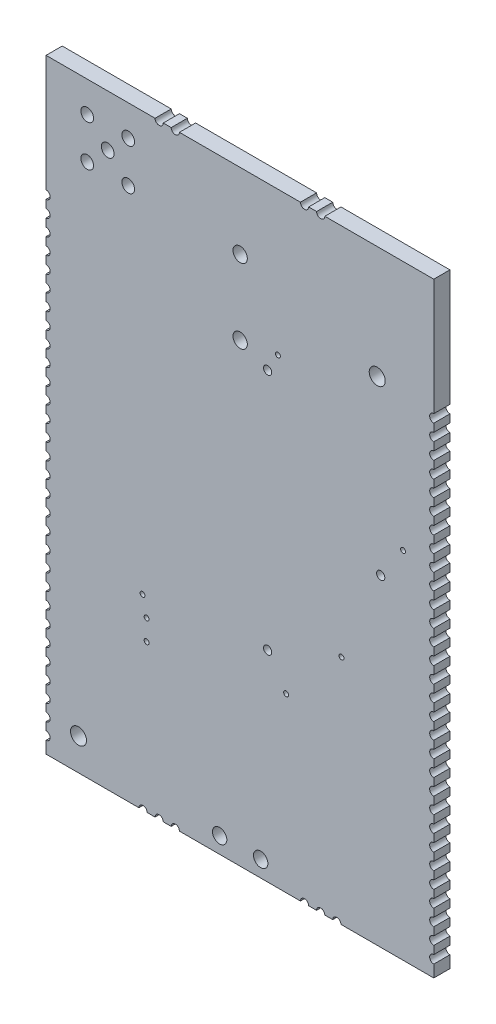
ISO-10303-21;
HEADER;
FILE_DESCRIPTION(('STEP AP214'),'2;1');
FILE_NAME('part.step','',(''),(''),'','','');
FILE_SCHEMA(('AUTOMOTIVE_DESIGN { 1 0 10303 214 1 1 1 1 }'));
ENDSEC;
DATA;
#1=APPLICATION_CONTEXT('core data for automotive mechanical design processes');
#2=APPLICATION_PROTOCOL_DEFINITION('international standard','automotive_design',2000,#1);
#3=PRODUCT_CONTEXT('',#1,'mechanical');
#4=PRODUCT('Part','Part','',(#3));
#5=PRODUCT_RELATED_PRODUCT_CATEGORY('part','',(#4));
#6=PRODUCT_DEFINITION_FORMATION('','',#4);
#7=PRODUCT_DEFINITION_CONTEXT('part definition',#1,'design');
#8=PRODUCT_DEFINITION('design','',#6,#7);
#9=PRODUCT_DEFINITION_SHAPE('','',#8);
#10=(LENGTH_UNIT() NAMED_UNIT(*) SI_UNIT(.MILLI.,.METRE.));
#11=(NAMED_UNIT(*) PLANE_ANGLE_UNIT() SI_UNIT($,.RADIAN.));
#12=(NAMED_UNIT(*) SI_UNIT($,.STERADIAN.) SOLID_ANGLE_UNIT());
#13=UNCERTAINTY_MEASURE_WITH_UNIT(LENGTH_MEASURE(1.E-05),#10,'distance_accuracy_value','');
#14=(GEOMETRIC_REPRESENTATION_CONTEXT(3) GLOBAL_UNCERTAINTY_ASSIGNED_CONTEXT((#13)) GLOBAL_UNIT_ASSIGNED_CONTEXT((#10,
#11,#12)) REPRESENTATION_CONTEXT('',''));
#15=CARTESIAN_POINT('',(0.,0.,0.));
#16=DIRECTION('',(0.,0.,1.));
#17=DIRECTION('',(1.,0.,0.));
#18=AXIS2_PLACEMENT_3D('',#15,#16,#17);
#19=CARTESIAN_POINT('',(0.,0.,1.));
#20=DIRECTION('',(0.,0.,1.));
#21=DIRECTION('',(1.,0.,0.));
#22=AXIS2_PLACEMENT_3D('',#19,#20,#21);
#23=PLANE('',#22);
#24=CARTESIAN_POINT('',(3.079,33.5788,1.));
#25=DIRECTION('',(0.,0.,1.));
#26=DIRECTION('',(1.,0.,0.));
#27=AXIS2_PLACEMENT_3D('',#24,#25,#26);
#28=CIRCLE('',#27,0.3937);
#29=CARTESIAN_POINT('',(3.4727,33.5788,1.));
#30=VERTEX_POINT('',#29);
#31=EDGE_CURVE('E3567',#30,#30,#28,.T.);
#32=ORIENTED_EDGE('',*,*,#31,.F.);
#33=EDGE_LOOP('',(#32));
#34=FACE_BOUND('',#33,.T.);
#35=CARTESIAN_POINT('',(0.539,31.0388,1.));
#36=DIRECTION('',(0.,0.,1.));
#37=DIRECTION('',(1.,0.,0.));
#38=AXIS2_PLACEMENT_3D('',#35,#36,#37);
#39=CIRCLE('',#38,0.3937);
#40=CARTESIAN_POINT('',(0.9327,31.0388,1.));
#41=VERTEX_POINT('',#40);
#42=EDGE_CURVE('E3579',#41,#41,#39,.T.);
#43=ORIENTED_EDGE('',*,*,#42,.F.);
#44=EDGE_LOOP('',(#43));
#45=FACE_BOUND('',#44,.T.);
#46=CARTESIAN_POINT('',(10.0076,30.8188,1.));
#47=DIRECTION('',(0.,0.,1.));
#48=DIRECTION('',(1.,0.,0.));
#49=AXIS2_PLACEMENT_3D('',#46,#47,#48);
#50=CIRCLE('',#49,0.4445);
#51=CARTESIAN_POINT('',(10.4521,30.8188,1.));
#52=VERTEX_POINT('',#51);
#53=EDGE_CURVE('E3589',#52,#52,#50,.T.);
#54=ORIENTED_EDGE('',*,*,#53,.F.);
#55=EDGE_LOOP('',(#54));
#56=FACE_BOUND('',#55,.T.);
#57=CARTESIAN_POINT('',(11.2776,-0.9812,1.));
#58=DIRECTION('',(0.,0.,1.));
#59=DIRECTION('',(1.,0.,0.));
#60=AXIS2_PLACEMENT_3D('',#57,#58,#59);
#61=CIRCLE('',#60,0.4445);
#62=CARTESIAN_POINT('',(11.7221,-0.9812,1.));
#63=VERTEX_POINT('',#62);
#64=EDGE_CURVE('E3599',#63,#63,#61,.T.);
#65=ORIENTED_EDGE('',*,*,#64,.F.);
#66=EDGE_LOOP('',(#65));
#67=FACE_BOUND('',#66,.T.);
#68=DIRECTION('',(-1.,0.,0.));
#69=VECTOR('',#68,1.);
#70=CARTESIAN_POINT('',(21.993352,35.4838,1.));
#71=LINE('',#70,#69);
#72=CARTESIAN_POINT('',(13.7394,35.4838,1.));
#73=VERTEX_POINT('',#72);
#74=CARTESIAN_POINT('',(6.2474,35.4838,1.));
#75=VERTEX_POINT('',#74);
#76=EDGE_CURVE('E1130',#73,#75,#71,.T.);
#77=ORIENTED_EDGE('',*,*,#76,.T.);
#78=CARTESIAN_POINT('',(5.9934,35.4838,1.));
#79=DIRECTION('',(0.,0.,1.));
#80=DIRECTION('',(1.,0.,0.));
#81=AXIS2_PLACEMENT_3D('',#78,#79,#80);
#82=CIRCLE('',#81,0.254);
#83=CARTESIAN_POINT('',(5.7394,35.4838,1.));
#84=VERTEX_POINT('',#83);
#85=EDGE_CURVE('E58',#84,#75,#82,.T.);
#86=ORIENTED_EDGE('',*,*,#85,.F.);
#87=CARTESIAN_POINT('',(5.2474,35.4838,1.));
#88=VERTEX_POINT('',#87);
#89=EDGE_CURVE('E1129',#84,#88,#71,.T.);
#90=ORIENTED_EDGE('',*,*,#89,.T.);
#91=CARTESIAN_POINT('',(4.9934,35.4838,1.));
#92=DIRECTION('',(0.,0.,1.));
#93=DIRECTION('',(1.,0.,0.));
#94=AXIS2_PLACEMENT_3D('',#91,#92,#93);
#95=CIRCLE('',#94,0.254);
#96=CARTESIAN_POINT('',(4.7394,35.4838,1.));
#97=VERTEX_POINT('',#96);
#98=EDGE_CURVE('E1141',#97,#88,#95,.T.);
#99=ORIENTED_EDGE('',*,*,#98,.F.);
#100=CARTESIAN_POINT('',(-2.0066,35.4838,1.));
#101=VERTEX_POINT('',#100);
#102=EDGE_CURVE('E1123',#97,#101,#71,.T.);
#103=ORIENTED_EDGE('',*,*,#102,.T.);
#104=DIRECTION('',(0.,-1.,0.));
#105=VECTOR('',#104,1.);
#106=CARTESIAN_POINT('',(-2.0066,35.4838,1.));
#107=LINE('',#106,#105);
#108=CARTESIAN_POINT('',(-2.0066,28.2728,1.));
#109=VERTEX_POINT('',#108);
#110=EDGE_CURVE('E1110',#101,#109,#107,.T.);
#111=ORIENTED_EDGE('',*,*,#110,.T.);
#112=CARTESIAN_POINT('',(-2.0066,28.0188,1.));
#113=DIRECTION('',(0.,0.,1.));
#114=DIRECTION('',(1.,0.,0.));
#115=AXIS2_PLACEMENT_3D('',#112,#113,#114);
#116=CIRCLE('',#115,0.254);
#117=CARTESIAN_POINT('',(-2.0066,27.7648,1.));
#118=VERTEX_POINT('',#117);
#119=EDGE_CURVE('E1774',#118,#109,#116,.T.);
#120=ORIENTED_EDGE('',*,*,#119,.F.);
#121=CARTESIAN_POINT('',(-2.0066,27.2728,1.));
#122=VERTEX_POINT('',#121);
#123=EDGE_CURVE('E1114',#118,#122,#107,.T.);
#124=ORIENTED_EDGE('',*,*,#123,.T.);
#125=CARTESIAN_POINT('',(-2.0066,27.0188,1.));
#126=DIRECTION('',(0.,0.,1.));
#127=DIRECTION('',(1.,0.,0.));
#128=AXIS2_PLACEMENT_3D('',#125,#126,#127);
#129=CIRCLE('',#128,0.254);
#130=CARTESIAN_POINT('',(-2.0066,26.7648,1.));
#131=VERTEX_POINT('',#130);
#132=EDGE_CURVE('E1718',#131,#122,#129,.T.);
#133=ORIENTED_EDGE('',*,*,#132,.F.);
#134=CARTESIAN_POINT('',(-2.0066,26.2728,1.));
#135=VERTEX_POINT('',#134);
#136=EDGE_CURVE('E1911',#131,#135,#107,.T.);
#137=ORIENTED_EDGE('',*,*,#136,.T.);
#138=CARTESIAN_POINT('',(-2.0066,26.0188,1.));
#139=DIRECTION('',(0.,0.,1.));
#140=DIRECTION('',(1.,0.,0.));
#141=AXIS2_PLACEMENT_3D('',#138,#139,#140);
#142=CIRCLE('',#141,0.254);
#143=CARTESIAN_POINT('',(-2.0066,25.7648,1.));
#144=VERTEX_POINT('',#143);
#145=EDGE_CURVE('E1663',#144,#135,#142,.T.);
#146=ORIENTED_EDGE('',*,*,#145,.F.);
#147=CARTESIAN_POINT('',(-2.0066,25.2728,1.));
#148=VERTEX_POINT('',#147);
#149=EDGE_CURVE('E1907',#144,#148,#107,.T.);
#150=ORIENTED_EDGE('',*,*,#149,.T.);
#151=CARTESIAN_POINT('',(-2.0066,25.0188,1.));
#152=DIRECTION('',(0.,0.,1.));
#153=DIRECTION('',(1.,0.,0.));
#154=AXIS2_PLACEMENT_3D('',#151,#152,#153);
#155=CIRCLE('',#154,0.254);
#156=CARTESIAN_POINT('',(-2.0066,24.7648,1.));
#157=VERTEX_POINT('',#156);
#158=EDGE_CURVE('E1608',#157,#148,#155,.T.);
#159=ORIENTED_EDGE('',*,*,#158,.F.);
#160=CARTESIAN_POINT('',(-2.0066,24.2728,1.));
#161=VERTEX_POINT('',#160);
#162=EDGE_CURVE('E1908',#157,#161,#107,.T.);
#163=ORIENTED_EDGE('',*,*,#162,.T.);
#164=CARTESIAN_POINT('',(-2.0066,24.0188,1.));
#165=DIRECTION('',(0.,0.,1.));
#166=DIRECTION('',(1.,0.,0.));
#167=AXIS2_PLACEMENT_3D('',#164,#165,#166);
#168=CIRCLE('',#167,0.254);
#169=CARTESIAN_POINT('',(-2.0066,23.7648,1.));
#170=VERTEX_POINT('',#169);
#171=EDGE_CURVE('E1553',#170,#161,#168,.T.);
#172=ORIENTED_EDGE('',*,*,#171,.F.);
#173=CARTESIAN_POINT('',(-2.0066,23.2728,1.));
#174=VERTEX_POINT('',#173);
#175=EDGE_CURVE('E1913',#170,#174,#107,.T.);
#176=ORIENTED_EDGE('',*,*,#175,.T.);
#177=CARTESIAN_POINT('',(-2.0066,23.0188,1.));
#178=DIRECTION('',(0.,0.,1.));
#179=DIRECTION('',(1.,0.,0.));
#180=AXIS2_PLACEMENT_3D('',#177,#178,#179);
#181=CIRCLE('',#180,0.254);
#182=CARTESIAN_POINT('',(-2.0066,22.7648,1.));
#183=VERTEX_POINT('',#182);
#184=EDGE_CURVE('E1498',#183,#174,#181,.T.);
#185=ORIENTED_EDGE('',*,*,#184,.F.);
#186=CARTESIAN_POINT('',(-2.0066,22.2728,1.));
#187=VERTEX_POINT('',#186);
#188=EDGE_CURVE('E1918',#183,#187,#107,.T.);
#189=ORIENTED_EDGE('',*,*,#188,.T.);
#190=CARTESIAN_POINT('',(-2.0066,22.0188,1.));
#191=DIRECTION('',(0.,0.,1.));
#192=DIRECTION('',(1.,0.,0.));
#193=AXIS2_PLACEMENT_3D('',#190,#191,#192);
#194=CIRCLE('',#193,0.254);
#195=CARTESIAN_POINT('',(-2.0066,21.7648,1.));
#196=VERTEX_POINT('',#195);
#197=EDGE_CURVE('E1458',#196,#187,#194,.T.);
#198=ORIENTED_EDGE('',*,*,#197,.F.);
#199=CARTESIAN_POINT('',(-2.0066,21.2728,1.));
#200=VERTEX_POINT('',#199);
#201=EDGE_CURVE('E1922',#196,#200,#107,.T.);
#202=ORIENTED_EDGE('',*,*,#201,.T.);
#203=CARTESIAN_POINT('',(-2.0066,21.0188,1.));
#204=DIRECTION('',(0.,0.,1.));
#205=DIRECTION('',(1.,0.,0.));
#206=AXIS2_PLACEMENT_3D('',#203,#204,#205);
#207=CIRCLE('',#206,0.254);
#208=CARTESIAN_POINT('',(-2.0066,20.7648,1.));
#209=VERTEX_POINT('',#208);
#210=EDGE_CURVE('E1453',#209,#200,#207,.T.);
#211=ORIENTED_EDGE('',*,*,#210,.F.);
#212=CARTESIAN_POINT('',(-2.0066,20.2728,1.));
#213=VERTEX_POINT('',#212);
#214=EDGE_CURVE('E1926',#209,#213,#107,.T.);
#215=ORIENTED_EDGE('',*,*,#214,.T.);
#216=CARTESIAN_POINT('',(-2.0066,20.0188,1.));
#217=DIRECTION('',(0.,0.,1.));
#218=DIRECTION('',(1.,0.,0.));
#219=AXIS2_PLACEMENT_3D('',#216,#217,#218);
#220=CIRCLE('',#219,0.254);
#221=CARTESIAN_POINT('',(-2.0066,19.7648,1.));
#222=VERTEX_POINT('',#221);
#223=EDGE_CURVE('E1448',#222,#213,#220,.T.);
#224=ORIENTED_EDGE('',*,*,#223,.F.);
#225=CARTESIAN_POINT('',(-2.0066,19.2728,1.));
#226=VERTEX_POINT('',#225);
#227=EDGE_CURVE('E1115',#222,#226,#107,.T.);
#228=ORIENTED_EDGE('',*,*,#227,.T.);
#229=CARTESIAN_POINT('',(-2.0066,19.0188,1.));
#230=DIRECTION('',(0.,0.,1.));
#231=DIRECTION('',(1.,0.,0.));
#232=AXIS2_PLACEMENT_3D('',#229,#230,#231);
#233=CIRCLE('',#232,0.254);
#234=CARTESIAN_POINT('',(-2.0066,18.7648,1.));
#235=VERTEX_POINT('',#234);
#236=EDGE_CURVE('E1768',#235,#226,#233,.T.);
#237=ORIENTED_EDGE('',*,*,#236,.F.);
#238=CARTESIAN_POINT('',(-2.0066,18.2728,1.));
#239=VERTEX_POINT('',#238);
#240=EDGE_CURVE('E1932',#235,#239,#107,.T.);
#241=ORIENTED_EDGE('',*,*,#240,.T.);
#242=CARTESIAN_POINT('',(-2.0066,18.0188,1.));
#243=DIRECTION('',(0.,0.,1.));
#244=DIRECTION('',(1.,0.,0.));
#245=AXIS2_PLACEMENT_3D('',#242,#243,#244);
#246=CIRCLE('',#245,0.254);
#247=CARTESIAN_POINT('',(-2.0066,17.7648,1.));
#248=VERTEX_POINT('',#247);
#249=EDGE_CURVE('E1763',#248,#239,#246,.T.);
#250=ORIENTED_EDGE('',*,*,#249,.F.);
#251=CARTESIAN_POINT('',(-2.0066,17.2728,1.));
#252=VERTEX_POINT('',#251);
#253=EDGE_CURVE('E1936',#248,#252,#107,.T.);
#254=ORIENTED_EDGE('',*,*,#253,.T.);
#255=CARTESIAN_POINT('',(-2.0066,17.0188,1.));
#256=DIRECTION('',(0.,0.,1.));
#257=DIRECTION('',(1.,0.,0.));
#258=AXIS2_PLACEMENT_3D('',#255,#256,#257);
#259=CIRCLE('',#258,0.254);
#260=CARTESIAN_POINT('',(-2.0066,16.7648,1.));
#261=VERTEX_POINT('',#260);
#262=EDGE_CURVE('E1758',#261,#252,#259,.T.);
#263=ORIENTED_EDGE('',*,*,#262,.F.);
#264=CARTESIAN_POINT('',(-2.0066,16.2728,1.));
#265=VERTEX_POINT('',#264);
#266=EDGE_CURVE('E1940',#261,#265,#107,.T.);
#267=ORIENTED_EDGE('',*,*,#266,.T.);
#268=CARTESIAN_POINT('',(-2.0066,16.0188,1.));
#269=DIRECTION('',(0.,0.,1.));
#270=DIRECTION('',(1.,0.,0.));
#271=AXIS2_PLACEMENT_3D('',#268,#269,#270);
#272=CIRCLE('',#271,0.254);
#273=CARTESIAN_POINT('',(-2.0066,15.7648,1.));
#274=VERTEX_POINT('',#273);
#275=EDGE_CURVE('E1753',#274,#265,#272,.T.);
#276=ORIENTED_EDGE('',*,*,#275,.F.);
#277=CARTESIAN_POINT('',(-2.0066,15.2728,1.));
#278=VERTEX_POINT('',#277);
#279=EDGE_CURVE('E3782',#274,#278,#107,.T.);
#280=ORIENTED_EDGE('',*,*,#279,.T.);
#281=CARTESIAN_POINT('',(-2.0066,15.0188,1.));
#282=DIRECTION('',(0.,0.,1.));
#283=DIRECTION('',(1.,0.,0.));
#284=AXIS2_PLACEMENT_3D('',#281,#282,#283);
#285=CIRCLE('',#284,0.254);
#286=CARTESIAN_POINT('',(-2.0066,14.7648,1.));
#287=VERTEX_POINT('',#286);
#288=EDGE_CURVE('E1748',#287,#278,#285,.T.);
#289=ORIENTED_EDGE('',*,*,#288,.F.);
#290=CARTESIAN_POINT('',(-2.0066,14.2728,1.));
#291=VERTEX_POINT('',#290);
#292=EDGE_CURVE('E3784',#287,#291,#107,.T.);
#293=ORIENTED_EDGE('',*,*,#292,.T.);
#294=CARTESIAN_POINT('',(-2.0066,14.0188,1.));
#295=DIRECTION('',(0.,0.,1.));
#296=DIRECTION('',(1.,0.,0.));
#297=AXIS2_PLACEMENT_3D('',#294,#295,#296);
#298=CIRCLE('',#297,0.254);
#299=CARTESIAN_POINT('',(-2.0066,13.7648,1.));
#300=VERTEX_POINT('',#299);
#301=EDGE_CURVE('E1743',#300,#291,#298,.T.);
#302=ORIENTED_EDGE('',*,*,#301,.F.);
#303=CARTESIAN_POINT('',(-2.0066,13.2728,1.));
#304=VERTEX_POINT('',#303);
#305=EDGE_CURVE('E3788',#300,#304,#107,.T.);
#306=ORIENTED_EDGE('',*,*,#305,.T.);
#307=CARTESIAN_POINT('',(-2.0066,13.0188,1.));
#308=DIRECTION('',(0.,0.,1.));
#309=DIRECTION('',(1.,0.,0.));
#310=AXIS2_PLACEMENT_3D('',#307,#308,#309);
#311=CIRCLE('',#310,0.254);
#312=CARTESIAN_POINT('',(-2.0066,12.7648,1.));
#313=VERTEX_POINT('',#312);
#314=EDGE_CURVE('E1738',#313,#304,#311,.T.);
#315=ORIENTED_EDGE('',*,*,#314,.F.);
#316=CARTESIAN_POINT('',(-2.0066,12.2728,1.));
#317=VERTEX_POINT('',#316);
#318=EDGE_CURVE('E3792',#313,#317,#107,.T.);
#319=ORIENTED_EDGE('',*,*,#318,.T.);
#320=CARTESIAN_POINT('',(-2.0066,12.0188,1.));
#321=DIRECTION('',(0.,0.,1.));
#322=DIRECTION('',(1.,0.,0.));
#323=AXIS2_PLACEMENT_3D('',#320,#321,#322);
#324=CIRCLE('',#323,0.254);
#325=CARTESIAN_POINT('',(-2.0066,11.7648,1.));
#326=VERTEX_POINT('',#325);
#327=EDGE_CURVE('E1733',#326,#317,#324,.T.);
#328=ORIENTED_EDGE('',*,*,#327,.F.);
#329=CARTESIAN_POINT('',(-2.0066,11.2728,1.));
#330=VERTEX_POINT('',#329);
#331=EDGE_CURVE('E3796',#326,#330,#107,.T.);
#332=ORIENTED_EDGE('',*,*,#331,.T.);
#333=CARTESIAN_POINT('',(-2.0066,11.0188,1.));
#334=DIRECTION('',(0.,0.,1.));
#335=DIRECTION('',(1.,0.,0.));
#336=AXIS2_PLACEMENT_3D('',#333,#334,#335);
#337=CIRCLE('',#336,0.254);
#338=CARTESIAN_POINT('',(-2.0066,10.7648,1.));
#339=VERTEX_POINT('',#338);
#340=EDGE_CURVE('E1728',#339,#330,#337,.T.);
#341=ORIENTED_EDGE('',*,*,#340,.F.);
#342=CARTESIAN_POINT('',(-2.0066,10.2728,1.));
#343=VERTEX_POINT('',#342);
#344=EDGE_CURVE('E1950',#339,#343,#107,.T.);
#345=ORIENTED_EDGE('',*,*,#344,.T.);
#346=CARTESIAN_POINT('',(-2.0066,10.0188,1.));
#347=DIRECTION('',(0.,0.,1.));
#348=DIRECTION('',(1.,0.,0.));
#349=AXIS2_PLACEMENT_3D('',#346,#347,#348);
#350=CIRCLE('',#349,0.254);
#351=CARTESIAN_POINT('',(-2.0066,9.7648,1.));
#352=VERTEX_POINT('',#351);
#353=EDGE_CURVE('E1723',#352,#343,#350,.T.);
#354=ORIENTED_EDGE('',*,*,#353,.F.);
#355=CARTESIAN_POINT('',(-2.0066,9.2728,1.));
#356=VERTEX_POINT('',#355);
#357=EDGE_CURVE('E1945',#352,#356,#107,.T.);
#358=ORIENTED_EDGE('',*,*,#357,.T.);
#359=CARTESIAN_POINT('',(-2.0066,9.0188,1.));
#360=DIRECTION('',(0.,0.,1.));
#361=DIRECTION('',(1.,0.,0.));
#362=AXIS2_PLACEMENT_3D('',#359,#360,#361);
#363=CIRCLE('',#362,0.254);
#364=CARTESIAN_POINT('',(-2.0066,8.7648,1.));
#365=VERTEX_POINT('',#364);
#366=EDGE_CURVE('E1713',#365,#356,#363,.T.);
#367=ORIENTED_EDGE('',*,*,#366,.F.);
#368=CARTESIAN_POINT('',(-2.0066,8.2728,1.));
#369=VERTEX_POINT('',#368);
#370=EDGE_CURVE('E1946',#365,#369,#107,.T.);
#371=ORIENTED_EDGE('',*,*,#370,.T.);
#372=CARTESIAN_POINT('',(-2.0066,8.0188,1.));
#373=DIRECTION('',(0.,0.,1.));
#374=DIRECTION('',(1.,0.,0.));
#375=AXIS2_PLACEMENT_3D('',#372,#373,#374);
#376=CIRCLE('',#375,0.254);
#377=CARTESIAN_POINT('',(-2.0066,7.7648,1.));
#378=VERTEX_POINT('',#377);
#379=EDGE_CURVE('E1708',#378,#369,#376,.T.);
#380=ORIENTED_EDGE('',*,*,#379,.F.);
#381=CARTESIAN_POINT('',(-2.0066,7.2728,1.));
#382=VERTEX_POINT('',#381);
#383=EDGE_CURVE('E1952',#378,#382,#107,.T.);
#384=ORIENTED_EDGE('',*,*,#383,.T.);
#385=CARTESIAN_POINT('',(-2.0066,7.0188,1.));
#386=DIRECTION('',(0.,0.,1.));
#387=DIRECTION('',(1.,0.,0.));
#388=AXIS2_PLACEMENT_3D('',#385,#386,#387);
#389=CIRCLE('',#388,0.254);
#390=CARTESIAN_POINT('',(-2.0066,6.7648,1.));
#391=VERTEX_POINT('',#390);
#392=EDGE_CURVE('E1703',#391,#382,#389,.T.);
#393=ORIENTED_EDGE('',*,*,#392,.F.);
#394=CARTESIAN_POINT('',(-2.0066,6.2728,1.));
#395=VERTEX_POINT('',#394);
#396=EDGE_CURVE('E1957',#391,#395,#107,.T.);
#397=ORIENTED_EDGE('',*,*,#396,.T.);
#398=CARTESIAN_POINT('',(-2.0066,6.0188,1.));
#399=DIRECTION('',(0.,0.,1.));
#400=DIRECTION('',(1.,0.,0.));
#401=AXIS2_PLACEMENT_3D('',#398,#399,#400);
#402=CIRCLE('',#401,0.254);
#403=CARTESIAN_POINT('',(-2.0066,5.7648,1.));
#404=VERTEX_POINT('',#403);
#405=EDGE_CURVE('E1698',#404,#395,#402,.T.);
#406=ORIENTED_EDGE('',*,*,#405,.F.);
#407=CARTESIAN_POINT('',(-2.0066,5.2728,1.));
#408=VERTEX_POINT('',#407);
#409=EDGE_CURVE('E1961',#404,#408,#107,.T.);
#410=ORIENTED_EDGE('',*,*,#409,.T.);
#411=CARTESIAN_POINT('',(-2.0066,5.0188,1.));
#412=DIRECTION('',(0.,0.,1.));
#413=DIRECTION('',(1.,0.,0.));
#414=AXIS2_PLACEMENT_3D('',#411,#412,#413);
#415=CIRCLE('',#414,0.254);
#416=CARTESIAN_POINT('',(-2.0066,4.7648,1.));
#417=VERTEX_POINT('',#416);
#418=EDGE_CURVE('E1693',#417,#408,#415,.T.);
#419=ORIENTED_EDGE('',*,*,#418,.F.);
#420=CARTESIAN_POINT('',(-2.0066,4.2728,1.));
#421=VERTEX_POINT('',#420);
#422=EDGE_CURVE('E1965',#417,#421,#107,.T.);
#423=ORIENTED_EDGE('',*,*,#422,.T.);
#424=CARTESIAN_POINT('',(-2.0066,4.0188,1.));
#425=DIRECTION('',(0.,0.,1.));
#426=DIRECTION('',(1.,0.,0.));
#427=AXIS2_PLACEMENT_3D('',#424,#425,#426);
#428=CIRCLE('',#427,0.254);
#429=CARTESIAN_POINT('',(-2.0066,3.7648,1.));
#430=VERTEX_POINT('',#429);
#431=EDGE_CURVE('E1688',#430,#421,#428,.T.);
#432=ORIENTED_EDGE('',*,*,#431,.F.);
#433=CARTESIAN_POINT('',(-2.0066,3.2728,1.));
#434=VERTEX_POINT('',#433);
#435=EDGE_CURVE('E1969',#430,#434,#107,.T.);
#436=ORIENTED_EDGE('',*,*,#435,.T.);
#437=CARTESIAN_POINT('',(-2.0066,3.0188,1.));
#438=DIRECTION('',(0.,0.,1.));
#439=DIRECTION('',(1.,0.,0.));
#440=AXIS2_PLACEMENT_3D('',#437,#438,#439);
#441=CIRCLE('',#440,0.254);
#442=CARTESIAN_POINT('',(-2.0066,2.7648,1.));
#443=VERTEX_POINT('',#442);
#444=EDGE_CURVE('E1683',#443,#434,#441,.T.);
#445=ORIENTED_EDGE('',*,*,#444,.F.);
#446=CARTESIAN_POINT('',(-2.0066,2.2728,1.));
#447=VERTEX_POINT('',#446);
#448=EDGE_CURVE('E1973',#443,#447,#107,.T.);
#449=ORIENTED_EDGE('',*,*,#448,.T.);
#450=CARTESIAN_POINT('',(-2.0066,2.0188,1.));
#451=DIRECTION('',(0.,0.,1.));
#452=DIRECTION('',(1.,0.,0.));
#453=AXIS2_PLACEMENT_3D('',#450,#451,#452);
#454=CIRCLE('',#453,0.254);
#455=CARTESIAN_POINT('',(-2.0066,1.7648,1.));
#456=VERTEX_POINT('',#455);
#457=EDGE_CURVE('E1678',#456,#447,#454,.T.);
#458=ORIENTED_EDGE('',*,*,#457,.F.);
#459=CARTESIAN_POINT('',(-2.0066,1.2728,1.));
#460=VERTEX_POINT('',#459);
#461=EDGE_CURVE('E1977',#456,#460,#107,.T.);
#462=ORIENTED_EDGE('',*,*,#461,.T.);
#463=CARTESIAN_POINT('',(-2.0066,1.0188,1.));
#464=DIRECTION('',(0.,0.,1.));
#465=DIRECTION('',(1.,0.,0.));
#466=AXIS2_PLACEMENT_3D('',#463,#464,#465);
#467=CIRCLE('',#466,0.254);
#468=CARTESIAN_POINT('',(-2.0066,0.7648,1.));
#469=VERTEX_POINT('',#468);
#470=EDGE_CURVE('E1673',#469,#460,#467,.T.);
#471=ORIENTED_EDGE('',*,*,#470,.F.);
#472=CARTESIAN_POINT('',(-2.0066,0.272799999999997,1.));
#473=VERTEX_POINT('',#472);
#474=EDGE_CURVE('E1909',#469,#473,#107,.T.);
#475=ORIENTED_EDGE('',*,*,#474,.T.);
#476=CARTESIAN_POINT('',(-2.0066,0.0188,1.));
#477=DIRECTION('',(0.,0.,1.));
#478=DIRECTION('',(1.,0.,0.));
#479=AXIS2_PLACEMENT_3D('',#476,#477,#478);
#480=CIRCLE('',#479,0.254);
#481=CARTESIAN_POINT('',(-2.0066,-0.2352,1.));
#482=VERTEX_POINT('',#481);
#483=EDGE_CURVE('E1668',#482,#473,#480,.T.);
#484=ORIENTED_EDGE('',*,*,#483,.F.);
#485=CARTESIAN_POINT('',(-2.0066,-0.727200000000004,1.));
#486=VERTEX_POINT('',#485);
#487=EDGE_CURVE('E1906',#482,#486,#107,.T.);
#488=ORIENTED_EDGE('',*,*,#487,.T.);
#489=CARTESIAN_POINT('',(-2.0066,-0.9812,1.));
#490=DIRECTION('',(0.,0.,1.));
#491=DIRECTION('',(1.,0.,0.));
#492=AXIS2_PLACEMENT_3D('',#489,#490,#491);
#493=CIRCLE('',#492,0.254);
#494=CARTESIAN_POINT('',(-2.0066,-1.2352,1.));
#495=VERTEX_POINT('',#494);
#496=EDGE_CURVE('E1658',#495,#486,#493,.T.);
#497=ORIENTED_EDGE('',*,*,#496,.F.);
#498=CARTESIAN_POINT('',(-2.0066,-1.9812,1.));
#499=VERTEX_POINT('',#498);
#500=EDGE_CURVE('E951',#495,#499,#107,.T.);
#501=ORIENTED_EDGE('',*,*,#500,.T.);
#502=DIRECTION('',(1.,0.,0.));
#503=VECTOR('',#502,1.);
#504=CARTESIAN_POINT('',(-2.0066,-1.9812,1.));
#505=LINE('',#504,#503);
#506=CARTESIAN_POINT('',(3.7394,-1.9812,1.));
#507=VERTEX_POINT('',#506);
#508=EDGE_CURVE('E1116',#499,#507,#505,.T.);
#509=ORIENTED_EDGE('',*,*,#508,.T.);
#510=CARTESIAN_POINT('',(3.9934,-1.9812,1.));
#511=DIRECTION('',(0.,0.,1.));
#512=DIRECTION('',(1.,0.,0.));
#513=AXIS2_PLACEMENT_3D('',#510,#511,#512);
#514=CIRCLE('',#513,0.254);
#515=CARTESIAN_POINT('',(4.2474,-1.9812,1.));
#516=VERTEX_POINT('',#515);
#517=EDGE_CURVE('E1653',#516,#507,#514,.T.);
#518=ORIENTED_EDGE('',*,*,#517,.F.);
#519=CARTESIAN_POINT('',(4.7394,-1.9812,1.));
#520=VERTEX_POINT('',#519);
#521=EDGE_CURVE('E1120',#516,#520,#505,.T.);
#522=ORIENTED_EDGE('',*,*,#521,.T.);
#523=CARTESIAN_POINT('',(4.9934,-1.9812,1.));
#524=DIRECTION('',(0.,0.,1.));
#525=DIRECTION('',(1.,0.,0.));
#526=AXIS2_PLACEMENT_3D('',#523,#524,#525);
#527=CIRCLE('',#526,0.254);
#528=CARTESIAN_POINT('',(5.2474,-1.9812,1.));
#529=VERTEX_POINT('',#528);
#530=EDGE_CURVE('E1648',#529,#520,#527,.T.);
#531=ORIENTED_EDGE('',*,*,#530,.F.);
#532=CARTESIAN_POINT('',(5.7394,-1.9812,1.));
#533=VERTEX_POINT('',#532);
#534=EDGE_CURVE('E2006',#529,#533,#505,.T.);
#535=ORIENTED_EDGE('',*,*,#534,.T.);
#536=CARTESIAN_POINT('',(5.9934,-1.9812,1.));
#537=DIRECTION('',(0.,0.,1.));
#538=DIRECTION('',(1.,0.,0.));
#539=AXIS2_PLACEMENT_3D('',#536,#537,#538);
#540=CIRCLE('',#539,0.254);
#541=CARTESIAN_POINT('',(6.2474,-1.9812,1.));
#542=VERTEX_POINT('',#541);
#543=EDGE_CURVE('E1643',#542,#533,#540,.T.);
#544=ORIENTED_EDGE('',*,*,#543,.F.);
#545=CARTESIAN_POINT('',(13.7394,-1.9812,1.));
#546=VERTEX_POINT('',#545);
#547=EDGE_CURVE('E2008',#542,#546,#505,.T.);
#548=ORIENTED_EDGE('',*,*,#547,.T.);
#549=CARTESIAN_POINT('',(13.9934,-1.9812,1.));
#550=DIRECTION('',(0.,0.,1.));
#551=DIRECTION('',(1.,0.,0.));
#552=AXIS2_PLACEMENT_3D('',#549,#550,#551);
#553=CIRCLE('',#552,0.254000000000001);
#554=CARTESIAN_POINT('',(14.2474,-1.9812,1.));
#555=VERTEX_POINT('',#554);
#556=EDGE_CURVE('E1638',#555,#546,#553,.T.);
#557=ORIENTED_EDGE('',*,*,#556,.F.);
#558=CARTESIAN_POINT('',(14.7394,-1.9812,1.));
#559=VERTEX_POINT('',#558);
#560=EDGE_CURVE('E2012',#555,#559,#505,.T.);
#561=ORIENTED_EDGE('',*,*,#560,.T.);
#562=CARTESIAN_POINT('',(14.9934,-1.9812,1.));
#563=DIRECTION('',(0.,0.,1.));
#564=DIRECTION('',(1.,0.,0.));
#565=AXIS2_PLACEMENT_3D('',#562,#563,#564);
#566=CIRCLE('',#565,0.254000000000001);
#567=CARTESIAN_POINT('',(15.2474,-1.9812,1.));
#568=VERTEX_POINT('',#567);
#569=EDGE_CURVE('E1633',#568,#559,#566,.T.);
#570=ORIENTED_EDGE('',*,*,#569,.F.);
#571=CARTESIAN_POINT('',(15.7394,-1.9812,1.));
#572=VERTEX_POINT('',#571);
#573=EDGE_CURVE('E2016',#568,#572,#505,.T.);
#574=ORIENTED_EDGE('',*,*,#573,.T.);
#575=CARTESIAN_POINT('',(15.9934,-1.9812,1.));
#576=DIRECTION('',(0.,0.,1.));
#577=DIRECTION('',(1.,0.,0.));
#578=AXIS2_PLACEMENT_3D('',#575,#576,#577);
#579=CIRCLE('',#578,0.254000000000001);
#580=CARTESIAN_POINT('',(16.2474,-1.9812,1.));
#581=VERTEX_POINT('',#580);
#582=EDGE_CURVE('E1628',#581,#572,#579,.T.);
#583=ORIENTED_EDGE('',*,*,#582,.F.);
#584=CARTESIAN_POINT('',(21.9934,-1.9812,1.));
#585=VERTEX_POINT('',#584);
#586=EDGE_CURVE('E1113',#581,#585,#505,.T.);
#587=ORIENTED_EDGE('',*,*,#586,.T.);
#588=DIRECTION('',(-1.28119578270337E-06,0.999999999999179,0.));
#589=VECTOR('',#588,1.);
#590=CARTESIAN_POINT('',(21.9934,-1.9812,1.));
#591=LINE('',#590,#589);
#592=CARTESIAN_POINT('',(21.9933990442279,-1.2352,1.));
#593=VERTEX_POINT('',#592);
#594=EDGE_CURVE('E1121',#585,#593,#591,.T.);
#595=ORIENTED_EDGE('',*,*,#594,.T.);
#596=CARTESIAN_POINT('',(21.9934,-0.9812,1.));
#597=DIRECTION('',(0.,0.,1.));
#598=DIRECTION('',(1.,0.,0.));
#599=AXIS2_PLACEMENT_3D('',#596,#597,#598);
#600=CIRCLE('',#599,0.254000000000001);
#601=CARTESIAN_POINT('',(21.9933983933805,-0.72720000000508,1.));
#602=VERTEX_POINT('',#601);
#603=EDGE_CURVE('E1623',#602,#593,#600,.T.);
#604=ORIENTED_EDGE('',*,*,#603,.F.);
#605=CARTESIAN_POINT('',(21.9933977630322,-0.2352,1.));
#606=VERTEX_POINT('',#605);
#607=EDGE_CURVE('E1124',#602,#606,#591,.T.);
#608=ORIENTED_EDGE('',*,*,#607,.T.);
#609=CARTESIAN_POINT('',(21.9934,0.0188,1.));
#610=DIRECTION('',(0.,0.,1.));
#611=DIRECTION('',(1.,0.,0.));
#612=AXIS2_PLACEMENT_3D('',#609,#610,#611);
#613=CIRCLE('',#612,0.254000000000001);
#614=CARTESIAN_POINT('',(21.9933971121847,0.272799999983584,1.));
#615=VERTEX_POINT('',#614);
#616=EDGE_CURVE('E1618',#615,#606,#613,.T.);
#617=ORIENTED_EDGE('',*,*,#616,.F.);
#618=CARTESIAN_POINT('',(21.9933964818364,0.764799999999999,1.));
#619=VERTEX_POINT('',#618);
#620=EDGE_CURVE('E2037',#615,#619,#591,.T.);
#621=ORIENTED_EDGE('',*,*,#620,.T.);
#622=CARTESIAN_POINT('',(21.9934,1.0188,1.));
#623=DIRECTION('',(0.,0.,1.));
#624=DIRECTION('',(1.,0.,0.));
#625=AXIS2_PLACEMENT_3D('',#622,#623,#624);
#626=CIRCLE('',#625,0.254000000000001);
#627=CARTESIAN_POINT('',(21.9933958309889,1.27279999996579,1.));
#628=VERTEX_POINT('',#627);
#629=EDGE_CURVE('E1613',#628,#619,#626,.T.);
#630=ORIENTED_EDGE('',*,*,#629,.F.);
#631=CARTESIAN_POINT('',(21.9933952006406,1.7648,1.));
#632=VERTEX_POINT('',#631);
#633=EDGE_CURVE('E2038',#628,#632,#591,.T.);
#634=ORIENTED_EDGE('',*,*,#633,.T.);
#635=CARTESIAN_POINT('',(21.9934,2.0188,1.));
#636=DIRECTION('',(0.,0.,1.));
#637=DIRECTION('',(1.,0.,0.));
#638=AXIS2_PLACEMENT_3D('',#635,#636,#637);
#639=CIRCLE('',#638,0.254000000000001);
#640=CARTESIAN_POINT('',(21.9933945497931,2.27279999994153,1.));
#641=VERTEX_POINT('',#640);
#642=EDGE_CURVE('E1603',#641,#632,#639,.T.);
#643=ORIENTED_EDGE('',*,*,#642,.F.);
#644=CARTESIAN_POINT('',(21.9933939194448,2.7648,1.));
#645=VERTEX_POINT('',#644);
#646=EDGE_CURVE('E2041',#641,#645,#591,.T.);
#647=ORIENTED_EDGE('',*,*,#646,.T.);
#648=CARTESIAN_POINT('',(21.9934,3.0188,1.));
#649=DIRECTION('',(0.,0.,1.));
#650=DIRECTION('',(1.,0.,0.));
#651=AXIS2_PLACEMENT_3D('',#648,#649,#650);
#652=CIRCLE('',#651,0.254000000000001);
#653=CARTESIAN_POINT('',(21.9933932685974,3.2727999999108,1.));
#654=VERTEX_POINT('',#653);
#655=EDGE_CURVE('E1598',#654,#645,#652,.T.);
#656=ORIENTED_EDGE('',*,*,#655,.F.);
#657=CARTESIAN_POINT('',(21.993392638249,3.7648,1.));
#658=VERTEX_POINT('',#657);
#659=EDGE_CURVE('E2045',#654,#658,#591,.T.);
#660=ORIENTED_EDGE('',*,*,#659,.T.);
#661=CARTESIAN_POINT('',(21.9934,4.0188,1.));
#662=DIRECTION('',(0.,0.,1.));
#663=DIRECTION('',(1.,0.,0.));
#664=AXIS2_PLACEMENT_3D('',#661,#662,#663);
#665=CIRCLE('',#664,0.254000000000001);
#666=CARTESIAN_POINT('',(21.9933919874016,4.27279999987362,1.));
#667=VERTEX_POINT('',#666);
#668=EDGE_CURVE('E1593',#667,#658,#665,.T.);
#669=ORIENTED_EDGE('',*,*,#668,.F.);
#670=CARTESIAN_POINT('',(21.9933913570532,4.7648,1.));
#671=VERTEX_POINT('',#670);
#672=EDGE_CURVE('E2049',#667,#671,#591,.T.);
#673=ORIENTED_EDGE('',*,*,#672,.T.);
#674=CARTESIAN_POINT('',(21.9934,5.0188,1.));
#675=DIRECTION('',(0.,0.,1.));
#676=DIRECTION('',(1.,0.,0.));
#677=AXIS2_PLACEMENT_3D('',#674,#675,#676);
#678=CIRCLE('',#677,0.254000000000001);
#679=CARTESIAN_POINT('',(21.9933907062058,5.27279999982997,1.));
#680=VERTEX_POINT('',#679);
#681=EDGE_CURVE('E1588',#680,#671,#678,.T.);
#682=ORIENTED_EDGE('',*,*,#681,.F.);
#683=CARTESIAN_POINT('',(21.9933900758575,5.7648,1.));
#684=VERTEX_POINT('',#683);
#685=EDGE_CURVE('E2053',#680,#684,#591,.T.);
#686=ORIENTED_EDGE('',*,*,#685,.T.);
#687=CARTESIAN_POINT('',(21.9934,6.0188,1.));
#688=DIRECTION('',(0.,0.,1.));
#689=DIRECTION('',(1.,0.,0.));
#690=AXIS2_PLACEMENT_3D('',#687,#688,#689);
#691=CIRCLE('',#690,0.254000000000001);
#692=CARTESIAN_POINT('',(21.99338942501,6.27279999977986,1.));
#693=VERTEX_POINT('',#692);
#694=EDGE_CURVE('E1583',#693,#684,#691,.T.);
#695=ORIENTED_EDGE('',*,*,#694,.F.);
#696=CARTESIAN_POINT('',(21.9933887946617,6.7648,1.));
#697=VERTEX_POINT('',#696);
#698=EDGE_CURVE('E2057',#693,#697,#591,.T.);
#699=ORIENTED_EDGE('',*,*,#698,.T.);
#700=CARTESIAN_POINT('',(21.9934,7.0188,1.));
#701=DIRECTION('',(0.,0.,1.));
#702=DIRECTION('',(1.,0.,0.));
#703=AXIS2_PLACEMENT_3D('',#700,#701,#702);
#704=CIRCLE('',#703,0.254000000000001);
#705=CARTESIAN_POINT('',(21.9933881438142,7.27279999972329,1.));
#706=VERTEX_POINT('',#705);
#707=EDGE_CURVE('E1578',#706,#697,#704,.T.);
#708=ORIENTED_EDGE('',*,*,#707,.F.);
#709=CARTESIAN_POINT('',(21.9933875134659,7.7648,1.));
#710=VERTEX_POINT('',#709);
#711=EDGE_CURVE('E2061',#706,#710,#591,.T.);
#712=ORIENTED_EDGE('',*,*,#711,.T.);
#713=CARTESIAN_POINT('',(21.9934,8.0188,1.));
#714=DIRECTION('',(0.,0.,1.));
#715=DIRECTION('',(1.,0.,0.));
#716=AXIS2_PLACEMENT_3D('',#713,#714,#715);
#717=CIRCLE('',#716,0.254000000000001);
#718=CARTESIAN_POINT('',(21.9933868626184,8.27279999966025,1.));
#719=VERTEX_POINT('',#718);
#720=EDGE_CURVE('E1573',#719,#710,#717,.T.);
#721=ORIENTED_EDGE('',*,*,#720,.F.);
#722=CARTESIAN_POINT('',(21.9933862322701,8.7648,1.));
#723=VERTEX_POINT('',#722);
#724=EDGE_CURVE('E2065',#719,#723,#591,.T.);
#725=ORIENTED_EDGE('',*,*,#724,.T.);
#726=CARTESIAN_POINT('',(21.9934,9.0188,1.));
#727=DIRECTION('',(0.,0.,1.));
#728=DIRECTION('',(1.,0.,0.));
#729=AXIS2_PLACEMENT_3D('',#726,#727,#728);
#730=CIRCLE('',#729,0.254000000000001);
#731=CARTESIAN_POINT('',(21.9933855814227,9.27279999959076,1.));
#732=VERTEX_POINT('',#731);
#733=EDGE_CURVE('E1568',#732,#723,#730,.T.);
#734=ORIENTED_EDGE('',*,*,#733,.F.);
#735=CARTESIAN_POINT('',(21.9933849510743,9.7648,1.));
#736=VERTEX_POINT('',#735);
#737=EDGE_CURVE('E2069',#732,#736,#591,.T.);
#738=ORIENTED_EDGE('',*,*,#737,.T.);
#739=CARTESIAN_POINT('',(21.9934,10.0188,1.));
#740=DIRECTION('',(0.,0.,1.));
#741=DIRECTION('',(1.,0.,0.));
#742=AXIS2_PLACEMENT_3D('',#739,#740,#741);
#743=CIRCLE('',#742,0.254000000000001);
#744=CARTESIAN_POINT('',(21.9933843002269,10.2727999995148,1.));
#745=VERTEX_POINT('',#744);
#746=EDGE_CURVE('E1563',#745,#736,#743,.T.);
#747=ORIENTED_EDGE('',*,*,#746,.F.);
#748=CARTESIAN_POINT('',(21.9933836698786,10.7648,1.));
#749=VERTEX_POINT('',#748);
#750=EDGE_CURVE('E2073',#745,#749,#591,.T.);
#751=ORIENTED_EDGE('',*,*,#750,.T.);
#752=CARTESIAN_POINT('',(21.9934,11.0188,1.));
#753=DIRECTION('',(0.,0.,1.));
#754=DIRECTION('',(1.,0.,0.));
#755=AXIS2_PLACEMENT_3D('',#752,#753,#754);
#756=CIRCLE('',#755,0.254000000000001);
#757=CARTESIAN_POINT('',(21.9933830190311,11.2727999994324,1.));
#758=VERTEX_POINT('',#757);
#759=EDGE_CURVE('E1558',#758,#749,#756,.T.);
#760=ORIENTED_EDGE('',*,*,#759,.F.);
#761=CARTESIAN_POINT('',(21.9933823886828,11.7648,1.));
#762=VERTEX_POINT('',#761);
#763=EDGE_CURVE('E2077',#758,#762,#591,.T.);
#764=ORIENTED_EDGE('',*,*,#763,.T.);
#765=CARTESIAN_POINT('',(21.9934,12.0188,1.));
#766=DIRECTION('',(0.,0.,1.));
#767=DIRECTION('',(1.,0.,0.));
#768=AXIS2_PLACEMENT_3D('',#765,#766,#767);
#769=CIRCLE('',#768,0.254000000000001);
#770=CARTESIAN_POINT('',(21.9933817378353,12.2727999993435,1.));
#771=VERTEX_POINT('',#770);
#772=EDGE_CURVE('E1548',#771,#762,#769,.T.);
#773=ORIENTED_EDGE('',*,*,#772,.F.);
#774=CARTESIAN_POINT('',(21.993381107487,12.7648,1.));
#775=VERTEX_POINT('',#774);
#776=EDGE_CURVE('E2081',#771,#775,#591,.T.);
#777=ORIENTED_EDGE('',*,*,#776,.T.);
#778=CARTESIAN_POINT('',(21.9934,13.0188,1.));
#779=DIRECTION('',(0.,0.,1.));
#780=DIRECTION('',(1.,0.,0.));
#781=AXIS2_PLACEMENT_3D('',#778,#779,#780);
#782=CIRCLE('',#781,0.254000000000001);
#783=CARTESIAN_POINT('',(21.9933804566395,13.2727999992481,1.));
#784=VERTEX_POINT('',#783);
#785=EDGE_CURVE('E1543',#784,#775,#782,.T.);
#786=ORIENTED_EDGE('',*,*,#785,.F.);
#787=CARTESIAN_POINT('',(21.9933798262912,13.7648,1.));
#788=VERTEX_POINT('',#787);
#789=EDGE_CURVE('E2085',#784,#788,#591,.T.);
#790=ORIENTED_EDGE('',*,*,#789,.T.);
#791=CARTESIAN_POINT('',(21.9934,14.0188,1.));
#792=DIRECTION('',(0.,0.,1.));
#793=DIRECTION('',(1.,0.,0.));
#794=AXIS2_PLACEMENT_3D('',#791,#792,#793);
#795=CIRCLE('',#794,0.254000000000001);
#796=CARTESIAN_POINT('',(21.9933791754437,14.2727999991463,1.));
#797=VERTEX_POINT('',#796);
#798=EDGE_CURVE('E1538',#797,#788,#795,.T.);
#799=ORIENTED_EDGE('',*,*,#798,.F.);
#800=CARTESIAN_POINT('',(21.9933785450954,14.7648,1.));
#801=VERTEX_POINT('',#800);
#802=EDGE_CURVE('E2089',#797,#801,#591,.T.);
#803=ORIENTED_EDGE('',*,*,#802,.T.);
#804=CARTESIAN_POINT('',(21.9934,15.0188,1.));
#805=DIRECTION('',(0.,0.,1.));
#806=DIRECTION('',(1.,0.,0.));
#807=AXIS2_PLACEMENT_3D('',#804,#805,#806);
#808=CIRCLE('',#807,0.254000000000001);
#809=CARTESIAN_POINT('',(21.993377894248,15.2727999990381,1.));
#810=VERTEX_POINT('',#809);
#811=EDGE_CURVE('E1533',#810,#801,#808,.T.);
#812=ORIENTED_EDGE('',*,*,#811,.F.);
#813=CARTESIAN_POINT('',(21.9933772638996,15.7648,1.));
#814=VERTEX_POINT('',#813);
#815=EDGE_CURVE('E2093',#810,#814,#591,.T.);
#816=ORIENTED_EDGE('',*,*,#815,.T.);
#817=CARTESIAN_POINT('',(21.9934,16.0188,1.));
#818=DIRECTION('',(0.,0.,1.));
#819=DIRECTION('',(1.,0.,0.));
#820=AXIS2_PLACEMENT_3D('',#817,#818,#819);
#821=CIRCLE('',#820,0.254000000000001);
#822=CARTESIAN_POINT('',(21.9933766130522,16.2727999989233,1.));
#823=VERTEX_POINT('',#822);
#824=EDGE_CURVE('E1528',#823,#814,#821,.T.);
#825=ORIENTED_EDGE('',*,*,#824,.F.);
#826=CARTESIAN_POINT('',(21.9933759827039,16.7648,1.));
#827=VERTEX_POINT('',#826);
#828=EDGE_CURVE('E2097',#823,#827,#591,.T.);
#829=ORIENTED_EDGE('',*,*,#828,.T.);
#830=CARTESIAN_POINT('',(21.9934,17.0188,1.));
#831=DIRECTION('',(0.,0.,1.));
#832=DIRECTION('',(1.,0.,0.));
#833=AXIS2_PLACEMENT_3D('',#830,#831,#832);
#834=CIRCLE('',#833,0.254000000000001);
#835=CARTESIAN_POINT('',(21.9933753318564,17.2727999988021,1.));
#836=VERTEX_POINT('',#835);
#837=EDGE_CURVE('E1523',#836,#827,#834,.T.);
#838=ORIENTED_EDGE('',*,*,#837,.F.);
#839=CARTESIAN_POINT('',(21.9933747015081,17.7648,1.));
#840=VERTEX_POINT('',#839);
#841=EDGE_CURVE('E2101',#836,#840,#591,.T.);
#842=ORIENTED_EDGE('',*,*,#841,.T.);
#843=CARTESIAN_POINT('',(21.9934,18.0188,1.));
#844=DIRECTION('',(0.,0.,1.));
#845=DIRECTION('',(1.,0.,0.));
#846=AXIS2_PLACEMENT_3D('',#843,#844,#845);
#847=CIRCLE('',#846,0.254000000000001);
#848=CARTESIAN_POINT('',(21.9933740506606,18.2727999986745,1.));
#849=VERTEX_POINT('',#848);
#850=EDGE_CURVE('E1518',#849,#840,#847,.T.);
#851=ORIENTED_EDGE('',*,*,#850,.F.);
#852=CARTESIAN_POINT('',(21.9933734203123,18.7648,1.));
#853=VERTEX_POINT('',#852);
#854=EDGE_CURVE('E2105',#849,#853,#591,.T.);
#855=ORIENTED_EDGE('',*,*,#854,.T.);
#856=CARTESIAN_POINT('',(21.9934,19.0188,1.));
#857=DIRECTION('',(0.,0.,1.));
#858=DIRECTION('',(1.,0.,0.));
#859=AXIS2_PLACEMENT_3D('',#856,#857,#858);
#860=CIRCLE('',#859,0.254000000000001);
#861=CARTESIAN_POINT('',(21.9933727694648,19.2727999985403,1.));
#862=VERTEX_POINT('',#861);
#863=EDGE_CURVE('E1513',#862,#853,#860,.T.);
#864=ORIENTED_EDGE('',*,*,#863,.F.);
#865=CARTESIAN_POINT('',(21.9933721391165,19.7648,1.));
#866=VERTEX_POINT('',#865);
#867=EDGE_CURVE('E2109',#862,#866,#591,.T.);
#868=ORIENTED_EDGE('',*,*,#867,.T.);
#869=CARTESIAN_POINT('',(21.9934,20.0188,1.));
#870=DIRECTION('',(0.,0.,1.));
#871=DIRECTION('',(1.,0.,0.));
#872=AXIS2_PLACEMENT_3D('',#869,#870,#871);
#873=CIRCLE('',#872,0.254000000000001);
#874=CARTESIAN_POINT('',(21.9933714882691,20.2727999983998,1.));
#875=VERTEX_POINT('',#874);
#876=EDGE_CURVE('E1508',#875,#866,#873,.T.);
#877=ORIENTED_EDGE('',*,*,#876,.F.);
#878=CARTESIAN_POINT('',(21.9933708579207,20.7648,1.));
#879=VERTEX_POINT('',#878);
#880=EDGE_CURVE('E2113',#875,#879,#591,.T.);
#881=ORIENTED_EDGE('',*,*,#880,.T.);
#882=CARTESIAN_POINT('',(21.9934,21.0188,1.));
#883=DIRECTION('',(0.,0.,1.));
#884=DIRECTION('',(1.,0.,0.));
#885=AXIS2_PLACEMENT_3D('',#882,#883,#884);
#886=CIRCLE('',#885,0.254000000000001);
#887=CARTESIAN_POINT('',(21.9933702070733,21.2727999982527,1.));
#888=VERTEX_POINT('',#887);
#889=EDGE_CURVE('E1503',#888,#879,#886,.T.);
#890=ORIENTED_EDGE('',*,*,#889,.F.);
#891=CARTESIAN_POINT('',(21.9933695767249,21.7648,1.));
#892=VERTEX_POINT('',#891);
#893=EDGE_CURVE('E2117',#888,#892,#591,.T.);
#894=ORIENTED_EDGE('',*,*,#893,.T.);
#895=CARTESIAN_POINT('',(21.9934,22.0188,1.));
#896=DIRECTION('',(0.,0.,1.));
#897=DIRECTION('',(1.,0.,0.));
#898=AXIS2_PLACEMENT_3D('',#895,#896,#897);
#899=CIRCLE('',#898,0.254000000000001);
#900=CARTESIAN_POINT('',(21.9933689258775,22.2727999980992,1.));
#901=VERTEX_POINT('',#900);
#902=EDGE_CURVE('E1493',#901,#892,#899,.T.);
#903=ORIENTED_EDGE('',*,*,#902,.F.);
#904=CARTESIAN_POINT('',(21.9933682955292,22.7648,1.));
#905=VERTEX_POINT('',#904);
#906=EDGE_CURVE('E2121',#901,#905,#591,.T.);
#907=ORIENTED_EDGE('',*,*,#906,.T.);
#908=CARTESIAN_POINT('',(21.9934,23.0188,1.));
#909=DIRECTION('',(0.,0.,1.));
#910=DIRECTION('',(1.,0.,0.));
#911=AXIS2_PLACEMENT_3D('',#908,#909,#910);
#912=CIRCLE('',#911,0.254000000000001);
#913=CARTESIAN_POINT('',(21.9933676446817,23.2727999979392,1.));
#914=VERTEX_POINT('',#913);
#915=EDGE_CURVE('E1488',#914,#905,#912,.T.);
#916=ORIENTED_EDGE('',*,*,#915,.F.);
#917=CARTESIAN_POINT('',(21.9933670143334,23.7648,1.));
#918=VERTEX_POINT('',#917);
#919=EDGE_CURVE('E2125',#914,#918,#591,.T.);
#920=ORIENTED_EDGE('',*,*,#919,.T.);
#921=CARTESIAN_POINT('',(21.9934,24.0188,1.));
#922=DIRECTION('',(0.,0.,1.));
#923=DIRECTION('',(1.,0.,0.));
#924=AXIS2_PLACEMENT_3D('',#921,#922,#923);
#925=CIRCLE('',#924,0.254000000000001);
#926=CARTESIAN_POINT('',(21.9933663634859,24.2727999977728,1.));
#927=VERTEX_POINT('',#926);
#928=EDGE_CURVE('E1483',#927,#918,#925,.T.);
#929=ORIENTED_EDGE('',*,*,#928,.F.);
#930=CARTESIAN_POINT('',(21.9933657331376,24.7648,1.));
#931=VERTEX_POINT('',#930);
#932=EDGE_CURVE('E2129',#927,#931,#591,.T.);
#933=ORIENTED_EDGE('',*,*,#932,.T.);
#934=CARTESIAN_POINT('',(21.9934,25.0188,1.));
#935=DIRECTION('',(0.,0.,1.));
#936=DIRECTION('',(1.,0.,0.));
#937=AXIS2_PLACEMENT_3D('',#934,#935,#936);
#938=CIRCLE('',#937,0.254000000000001);
#939=CARTESIAN_POINT('',(21.9933650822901,25.2727999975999,1.));
#940=VERTEX_POINT('',#939);
#941=EDGE_CURVE('E1478',#940,#931,#938,.T.);
#942=ORIENTED_EDGE('',*,*,#941,.F.);
#943=CARTESIAN_POINT('',(21.9933644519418,25.7648,1.));
#944=VERTEX_POINT('',#943);
#945=EDGE_CURVE('E2133',#940,#944,#591,.T.);
#946=ORIENTED_EDGE('',*,*,#945,.T.);
#947=CARTESIAN_POINT('',(21.9934,26.0188,1.));
#948=DIRECTION('',(0.,0.,1.));
#949=DIRECTION('',(1.,0.,0.));
#950=AXIS2_PLACEMENT_3D('',#947,#948,#949);
#951=CIRCLE('',#950,0.254000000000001);
#952=CARTESIAN_POINT('',(21.9933638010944,26.2727999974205,1.));
#953=VERTEX_POINT('',#952);
#954=EDGE_CURVE('E1473',#953,#944,#951,.T.);
#955=ORIENTED_EDGE('',*,*,#954,.F.);
#956=CARTESIAN_POINT('',(21.993363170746,26.7648,1.));
#957=VERTEX_POINT('',#956);
#958=EDGE_CURVE('E2137',#953,#957,#591,.T.);
#959=ORIENTED_EDGE('',*,*,#958,.T.);
#960=CARTESIAN_POINT('',(21.9934,27.0188,1.));
#961=DIRECTION('',(0.,0.,1.));
#962=DIRECTION('',(1.,0.,0.));
#963=AXIS2_PLACEMENT_3D('',#960,#961,#962);
#964=CIRCLE('',#963,0.254000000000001);
#965=CARTESIAN_POINT('',(21.9933625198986,27.2727999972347,1.));
#966=VERTEX_POINT('',#965);
#967=EDGE_CURVE('E1468',#966,#957,#964,.T.);
#968=ORIENTED_EDGE('',*,*,#967,.F.);
#969=CARTESIAN_POINT('',(21.9933618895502,27.7648,1.));
#970=VERTEX_POINT('',#969);
#971=EDGE_CURVE('E2141',#966,#970,#591,.T.);
#972=ORIENTED_EDGE('',*,*,#971,.T.);
#973=CARTESIAN_POINT('',(21.9934,28.0188,1.));
#974=DIRECTION('',(0.,0.,1.));
#975=DIRECTION('',(1.,0.,0.));
#976=AXIS2_PLACEMENT_3D('',#973,#974,#975);
#977=CIRCLE('',#976,0.254000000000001);
#978=CARTESIAN_POINT('',(21.9933612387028,28.2727999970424,1.));
#979=VERTEX_POINT('',#978);
#980=EDGE_CURVE('E1463',#979,#970,#977,.T.);
#981=ORIENTED_EDGE('',*,*,#980,.F.);
#982=CARTESIAN_POINT('',(21.993352,35.4838,1.));
#983=VERTEX_POINT('',#982);
#984=EDGE_CURVE('E1119',#979,#983,#591,.T.);
#985=ORIENTED_EDGE('',*,*,#984,.T.);
#986=CARTESIAN_POINT('',(15.2474,35.4838,1.));
#987=VERTEX_POINT('',#986);
#988=EDGE_CURVE('E1125',#983,#987,#71,.T.);
#989=ORIENTED_EDGE('',*,*,#988,.T.);
#990=CARTESIAN_POINT('',(14.9934,35.4838,1.));
#991=DIRECTION('',(0.,0.,1.));
#992=DIRECTION('',(1.,0.,0.));
#993=AXIS2_PLACEMENT_3D('',#990,#991,#992);
#994=CIRCLE('',#993,0.254000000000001);
#995=CARTESIAN_POINT('',(14.7394,35.4838,1.));
#996=VERTEX_POINT('',#995);
#997=EDGE_CURVE('E66',#996,#987,#994,.T.);
#998=ORIENTED_EDGE('',*,*,#997,.F.);
#999=CARTESIAN_POINT('',(14.2474,35.4838,1.));
#1000=VERTEX_POINT('',#999);
#1001=EDGE_CURVE('E1128',#996,#1000,#71,.T.);
#1002=ORIENTED_EDGE('',*,*,#1001,.T.);
#1003=CARTESIAN_POINT('',(13.9934,35.4838,1.));
#1004=DIRECTION('',(0.,0.,1.));
#1005=DIRECTION('',(1.,0.,0.));
#1006=AXIS2_PLACEMENT_3D('',#1003,#1004,#1005);
#1007=CIRCLE('',#1006,0.254000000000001);
#1008=EDGE_CURVE('E1441',#73,#1000,#1007,.T.);
#1009=ORIENTED_EDGE('',*,*,#1008,.F.);
#1010=EDGE_LOOP('',(#77,#86,#90,#99,#103,#111,#120,#124,#133,#137,#146,#150,#159,#163,#172,#176,
#185,#189,#198,#202,#211,#215,#224,#228,#237,#241,#250,#254,#263,#267,#276,#280,#289,#293,#302,
#306,#315,#319,#328,#332,#341,#345,#354,#358,#367,#371,#380,#384,#393,#397,#406,#410,#419,#423,
#432,#436,#445,#449,#458,#462,#471,#475,#484,#488,#497,#501,#509,#518,#522,#531,#535,#544,#548,
#557,#561,#570,#574,#583,#587,#595,#604,#608,#617,#621,#630,#634,#643,#647,#656,#660,#669,#673,
#682,#686,#695,#699,#708,#712,#721,#725,#734,#738,#747,#751,#760,#764,#773,#777,#786,#790,#799,
#803,#812,#816,#825,#829,#838,#842,#851,#855,#864,#868,#877,#881,#890,#894,#903,#907,#916,#920,
#929,#933,#942,#946,#955,#959,#968,#972,#981,#985,#989,#998,#1002,#1009));
#1011=FACE_BOUND('',#1010,.T.);
#1012=CARTESIAN_POINT('',(20.0914,19.9898,1.));
#1013=DIRECTION('',(0.,0.,1.));
#1014=DIRECTION('',(1.,0.,0.));
#1015=AXIS2_PLACEMENT_3D('',#1012,#1013,#1014);
#1016=CIRCLE('',#1015,0.1524);
#1017=CARTESIAN_POINT('',(20.2438,19.9898,1.));
#1018=VERTEX_POINT('',#1017);
#1019=EDGE_CURVE('E1778',#1018,#1018,#1016,.T.);
#1020=ORIENTED_EDGE('',*,*,#1019,.F.);
#1021=EDGE_LOOP('',(#1020));
#1022=FACE_BOUND('',#1021,.T.);
#1023=CARTESIAN_POINT('',(16.2814,12.3698,1.));
#1024=DIRECTION('',(0.,0.,1.));
#1025=DIRECTION('',(1.,0.,0.));
#1026=AXIS2_PLACEMENT_3D('',#1023,#1024,#1025);
#1027=CIRCLE('',#1026,0.1524);
#1028=CARTESIAN_POINT('',(16.4338,12.3698,1.));
#1029=VERTEX_POINT('',#1028);
#1030=EDGE_CURVE('E1790',#1029,#1029,#1027,.T.);
#1031=ORIENTED_EDGE('',*,*,#1030,.F.);
#1032=EDGE_LOOP('',(#1031));
#1033=FACE_BOUND('',#1032,.T.);
#1034=CARTESIAN_POINT('',(4.2164,8.4328,1.));
#1035=DIRECTION('',(0.,0.,1.));
#1036=DIRECTION('',(1.,0.,0.));
#1037=AXIS2_PLACEMENT_3D('',#1034,#1035,#1036);
#1038=CIRCLE('',#1037,0.1524);
#1039=CARTESIAN_POINT('',(4.3688,8.4328,1.));
#1040=VERTEX_POINT('',#1039);
#1041=EDGE_CURVE('E1802',#1040,#1040,#1038,.T.);
#1042=ORIENTED_EDGE('',*,*,#1041,.F.);
#1043=EDGE_LOOP('',(#1042));
#1044=FACE_BOUND('',#1043,.T.);
#1045=CARTESIAN_POINT('',(3.9624,9.5758,1.));
#1046=DIRECTION('',(0.,0.,1.));
#1047=DIRECTION('',(1.,0.,0.));
#1048=AXIS2_PLACEMENT_3D('',#1045,#1046,#1047);
#1049=CIRCLE('',#1048,0.1524);
#1050=CARTESIAN_POINT('',(4.1148,9.5758,1.));
#1051=VERTEX_POINT('',#1050);
#1052=EDGE_CURVE('E1814',#1051,#1051,#1049,.T.);
#1053=ORIENTED_EDGE('',*,*,#1052,.F.);
#1054=EDGE_LOOP('',(#1053));
#1055=FACE_BOUND('',#1054,.T.);
#1056=CARTESIAN_POINT('',(11.7094,25.4578,1.));
#1057=DIRECTION('',(0.,0.,1.));
#1058=DIRECTION('',(1.,0.,0.));
#1059=AXIS2_PLACEMENT_3D('',#1056,#1057,#1058);
#1060=CIRCLE('',#1059,0.254000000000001);
#1061=CARTESIAN_POINT('',(11.9634,25.4578,1.));
#1062=VERTEX_POINT('',#1061);
#1063=EDGE_CURVE('E1826',#1062,#1062,#1060,.T.);
#1064=ORIENTED_EDGE('',*,*,#1063,.F.);
#1065=EDGE_LOOP('',(#1064));
#1066=FACE_BOUND('',#1065,.T.);
#1067=CARTESIAN_POINT('',(18.4934,28.5188,1.));
#1068=DIRECTION('',(0.,0.,1.));
#1069=DIRECTION('',(1.,0.,0.));
#1070=AXIS2_PLACEMENT_3D('',#1067,#1068,#1069);
#1071=CIRCLE('',#1070,0.495300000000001);
#1072=CARTESIAN_POINT('',(18.9887,28.5188,1.));
#1073=VERTEX_POINT('',#1072);
#1074=EDGE_CURVE('E1104',#1073,#1073,#1071,.T.);
#1075=ORIENTED_EDGE('',*,*,#1074,.F.);
#1076=EDGE_LOOP('',(#1075));
#1077=FACE_BOUND('',#1076,.T.);
#1078=CARTESIAN_POINT('',(0.,0.,1.));
#1079=DIRECTION('',(0.,0.,1.));
#1080=DIRECTION('',(1.,0.,0.));
#1081=AXIS2_PLACEMENT_3D('',#1078,#1079,#1080);
#1082=CIRCLE('',#1081,0.4953);
#1083=CARTESIAN_POINT('',(0.4953,0.,1.));
#1084=VERTEX_POINT('',#1083);
#1085=EDGE_CURVE('E1093',#1084,#1084,#1082,.T.);
#1086=ORIENTED_EDGE('',*,*,#1085,.F.);
#1087=EDGE_LOOP('',(#1086));
#1088=FACE_BOUND('',#1087,.T.);
#1089=CARTESIAN_POINT('',(11.7094,10.4578,1.));
#1090=DIRECTION('',(0.,0.,1.));
#1091=DIRECTION('',(1.,0.,0.));
#1092=AXIS2_PLACEMENT_3D('',#1089,#1090,#1091);
#1093=CIRCLE('',#1092,0.254000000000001);
#1094=CARTESIAN_POINT('',(11.9634,10.4578,1.));
#1095=VERTEX_POINT('',#1094);
#1096=EDGE_CURVE('E1832',#1095,#1095,#1093,.T.);
#1097=ORIENTED_EDGE('',*,*,#1096,.F.);
#1098=EDGE_LOOP('',(#1097));
#1099=FACE_BOUND('',#1098,.T.);
#1100=CARTESIAN_POINT('',(18.7094,17.9578,1.));
#1101=DIRECTION('',(0.,0.,1.));
#1102=DIRECTION('',(1.,0.,0.));
#1103=AXIS2_PLACEMENT_3D('',#1100,#1101,#1102);
#1104=CIRCLE('',#1103,0.254000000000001);
#1105=CARTESIAN_POINT('',(18.9634,17.9578,1.));
#1106=VERTEX_POINT('',#1105);
#1107=EDGE_CURVE('E1820',#1106,#1106,#1104,.T.);
#1108=ORIENTED_EDGE('',*,*,#1107,.F.);
#1109=EDGE_LOOP('',(#1108));
#1110=FACE_BOUND('',#1109,.T.);
#1111=CARTESIAN_POINT('',(12.3444,26.5938,1.));
#1112=DIRECTION('',(0.,0.,1.));
#1113=DIRECTION('',(1.,0.,0.));
#1114=AXIS2_PLACEMENT_3D('',#1111,#1112,#1113);
#1115=CIRCLE('',#1114,0.1524);
#1116=CARTESIAN_POINT('',(12.4968,26.5938,1.));
#1117=VERTEX_POINT('',#1116);
#1118=EDGE_CURVE('E1808',#1117,#1117,#1115,.T.);
#1119=ORIENTED_EDGE('',*,*,#1118,.F.);
#1120=EDGE_LOOP('',(#1119));
#1121=FACE_BOUND('',#1120,.T.);
#1122=CARTESIAN_POINT('',(4.2164,7.1628,1.));
#1123=DIRECTION('',(0.,0.,1.));
#1124=DIRECTION('',(1.,0.,0.));
#1125=AXIS2_PLACEMENT_3D('',#1122,#1123,#1124);
#1126=CIRCLE('',#1125,0.1524);
#1127=CARTESIAN_POINT('',(4.3688,7.1628,1.));
#1128=VERTEX_POINT('',#1127);
#1129=EDGE_CURVE('E1796',#1128,#1128,#1126,.T.);
#1130=ORIENTED_EDGE('',*,*,#1129,.F.);
#1131=EDGE_LOOP('',(#1130));
#1132=FACE_BOUND('',#1131,.T.);
#1133=CARTESIAN_POINT('',(12.8524,8.6868,1.));
#1134=DIRECTION('',(0.,0.,1.));
#1135=DIRECTION('',(1.,0.,0.));
#1136=AXIS2_PLACEMENT_3D('',#1133,#1134,#1135);
#1137=CIRCLE('',#1136,0.1524);
#1138=CARTESIAN_POINT('',(13.0048,8.6868,1.));
#1139=VERTEX_POINT('',#1138);
#1140=EDGE_CURVE('E1784',#1139,#1139,#1137,.T.);
#1141=ORIENTED_EDGE('',*,*,#1140,.F.);
#1142=EDGE_LOOP('',(#1141));
#1143=FACE_BOUND('',#1142,.T.);
#1144=CARTESIAN_POINT('',(10.0076,26.2188,1.));
#1145=DIRECTION('',(0.,0.,1.));
#1146=DIRECTION('',(1.,0.,0.));
#1147=AXIS2_PLACEMENT_3D('',#1144,#1145,#1146);
#1148=CIRCLE('',#1147,0.4445);
#1149=CARTESIAN_POINT('',(10.4521,26.2188,1.));
#1150=VERTEX_POINT('',#1149);
#1151=EDGE_CURVE('E939',#1150,#1150,#1148,.T.);
#1152=ORIENTED_EDGE('',*,*,#1151,.F.);
#1153=EDGE_LOOP('',(#1152));
#1154=FACE_BOUND('',#1153,.T.);
#1155=CARTESIAN_POINT('',(8.7376,-0.9812,1.));
#1156=DIRECTION('',(0.,0.,1.));
#1157=DIRECTION('',(1.,0.,0.));
#1158=AXIS2_PLACEMENT_3D('',#1155,#1156,#1157);
#1159=CIRCLE('',#1158,0.4445);
#1160=CARTESIAN_POINT('',(9.1821,-0.9812,1.));
#1161=VERTEX_POINT('',#1160);
#1162=EDGE_CURVE('E3552',#1161,#1161,#1159,.T.);
#1163=ORIENTED_EDGE('',*,*,#1162,.F.);
#1164=EDGE_LOOP('',(#1163));
#1165=FACE_BOUND('',#1164,.T.);
#1166=CARTESIAN_POINT('',(1.809,32.3088,1.));
#1167=DIRECTION('',(0.,0.,1.));
#1168=DIRECTION('',(1.,0.,0.));
#1169=AXIS2_PLACEMENT_3D('',#1166,#1167,#1168);
#1170=CIRCLE('',#1169,0.3937);
#1171=CARTESIAN_POINT('',(2.2027,32.3088,1.));
#1172=VERTEX_POINT('',#1171);
#1173=EDGE_CURVE('E3556',#1172,#1172,#1170,.T.);
#1174=ORIENTED_EDGE('',*,*,#1173,.F.);
#1175=EDGE_LOOP('',(#1174));
#1176=FACE_BOUND('',#1175,.T.);
#1177=CARTESIAN_POINT('',(3.079,31.0388,1.));
#1178=DIRECTION('',(0.,0.,1.));
#1179=DIRECTION('',(1.,0.,0.));
#1180=AXIS2_PLACEMENT_3D('',#1177,#1178,#1179);
#1181=CIRCLE('',#1180,0.3937);
#1182=CARTESIAN_POINT('',(3.4727,31.0388,1.));
#1183=VERTEX_POINT('',#1182);
#1184=EDGE_CURVE('E3560',#1183,#1183,#1181,.T.);
#1185=ORIENTED_EDGE('',*,*,#1184,.F.);
#1186=EDGE_LOOP('',(#1185));
#1187=FACE_BOUND('',#1186,.T.);
#1188=CARTESIAN_POINT('',(0.539,33.5788,1.));
#1189=DIRECTION('',(0.,0.,1.));
#1190=DIRECTION('',(1.,0.,0.));
#1191=AXIS2_PLACEMENT_3D('',#1188,#1189,#1190);
#1192=CIRCLE('',#1191,0.3937);
#1193=CARTESIAN_POINT('',(0.9327,33.5788,1.));
#1194=VERTEX_POINT('',#1193);
#1195=EDGE_CURVE('E3562',#1194,#1194,#1192,.T.);
#1196=ORIENTED_EDGE('',*,*,#1195,.F.);
#1197=EDGE_LOOP('',(#1196));
#1198=FACE_BOUND('',#1197,.T.);
#1199=ADVANCED_FACE('F44',(#34,#45,#56,#67,#1011,#1022,#1033,#1044,#1055,#1066,#1077,#1088,
#1099,#1110,#1121,#1132,#1143,#1154,#1165,#1176,#1187,#1198),#23,.T.);
#1200=CARTESIAN_POINT('',(0.,0.,0.));
#1201=DIRECTION('',(0.,0.,1.));
#1202=DIRECTION('',(1.,0.,0.));
#1203=AXIS2_PLACEMENT_3D('',#1200,#1201,#1202);
#1204=PLANE('',#1203);
#1205=CARTESIAN_POINT('',(3.079,33.5788,0.));
#1206=DIRECTION('',(0.,0.,1.));
#1207=DIRECTION('',(1.,0.,0.));
#1208=AXIS2_PLACEMENT_3D('',#1205,#1206,#1207);
#1209=CIRCLE('',#1208,0.3937);
#1210=CARTESIAN_POINT('',(3.4727,33.5788,0.));
#1211=VERTEX_POINT('',#1210);
#1212=EDGE_CURVE('E3563',#1211,#1211,#1209,.T.);
#1213=ORIENTED_EDGE('',*,*,#1212,.T.);
#1214=EDGE_LOOP('',(#1213));
#1215=FACE_BOUND('',#1214,.T.);
#1216=CARTESIAN_POINT('',(0.539,31.0388,0.));
#1217=DIRECTION('',(0.,0.,1.));
#1218=DIRECTION('',(1.,0.,0.));
#1219=AXIS2_PLACEMENT_3D('',#1216,#1217,#1218);
#1220=CIRCLE('',#1219,0.3937);
#1221=CARTESIAN_POINT('',(0.9327,31.0388,0.));
#1222=VERTEX_POINT('',#1221);
#1223=EDGE_CURVE('E3576',#1222,#1222,#1220,.T.);
#1224=ORIENTED_EDGE('',*,*,#1223,.T.);
#1225=EDGE_LOOP('',(#1224));
#1226=FACE_BOUND('',#1225,.T.);
#1227=CARTESIAN_POINT('',(10.0076,30.8188,0.));
#1228=DIRECTION('',(0.,0.,1.));
#1229=DIRECTION('',(1.,0.,0.));
#1230=AXIS2_PLACEMENT_3D('',#1227,#1228,#1229);
#1231=CIRCLE('',#1230,0.4445);
#1232=CARTESIAN_POINT('',(10.4521,30.8188,0.));
#1233=VERTEX_POINT('',#1232);
#1234=EDGE_CURVE('E3586',#1233,#1233,#1231,.T.);
#1235=ORIENTED_EDGE('',*,*,#1234,.T.);
#1236=EDGE_LOOP('',(#1235));
#1237=FACE_BOUND('',#1236,.T.);
#1238=CARTESIAN_POINT('',(11.2776,-0.9812,0.));
#1239=DIRECTION('',(0.,0.,1.));
#1240=DIRECTION('',(1.,0.,0.));
#1241=AXIS2_PLACEMENT_3D('',#1238,#1239,#1240);
#1242=CIRCLE('',#1241,0.4445);
#1243=CARTESIAN_POINT('',(11.7221,-0.9812,0.));
#1244=VERTEX_POINT('',#1243);
#1245=EDGE_CURVE('E3596',#1244,#1244,#1242,.T.);
#1246=ORIENTED_EDGE('',*,*,#1245,.T.);
#1247=EDGE_LOOP('',(#1246));
#1248=FACE_BOUND('',#1247,.T.);
#1249=CARTESIAN_POINT('',(5.9934,35.4838,0.));
#1250=DIRECTION('',(0.,0.,1.));
#1251=DIRECTION('',(1.,0.,0.));
#1252=AXIS2_PLACEMENT_3D('',#1249,#1250,#1251);
#1253=CIRCLE('',#1252,0.254);
#1254=CARTESIAN_POINT('',(5.7394,35.4838,0.));
#1255=VERTEX_POINT('',#1254);
#1256=CARTESIAN_POINT('',(6.2474,35.4838,0.));
#1257=VERTEX_POINT('',#1256);
#1258=EDGE_CURVE('E923',#1255,#1257,#1253,.T.);
#1259=ORIENTED_EDGE('',*,*,#1258,.T.);
#1260=DIRECTION('',(-1.,0.,0.));
#1261=VECTOR('',#1260,1.);
#1262=CARTESIAN_POINT('',(21.993352,35.4838,0.));
#1263=LINE('',#1262,#1261);
#1264=CARTESIAN_POINT('',(13.7394,35.4838,0.));
#1265=VERTEX_POINT('',#1264);
#1266=EDGE_CURVE('E936',#1265,#1257,#1263,.T.);
#1267=ORIENTED_EDGE('',*,*,#1266,.F.);
#1268=CARTESIAN_POINT('',(13.9934,35.4838,0.));
#1269=DIRECTION('',(0.,0.,1.));
#1270=DIRECTION('',(1.,0.,0.));
#1271=AXIS2_PLACEMENT_3D('',#1268,#1269,#1270);
#1272=CIRCLE('',#1271,0.254000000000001);
#1273=CARTESIAN_POINT('',(14.2474,35.4838,0.));
#1274=VERTEX_POINT('',#1273);
#1275=EDGE_CURVE('E1440',#1265,#1274,#1272,.T.);
#1276=ORIENTED_EDGE('',*,*,#1275,.T.);
#1277=CARTESIAN_POINT('',(14.7394,35.4838,0.));
#1278=VERTEX_POINT('',#1277);
#1279=EDGE_CURVE('E944',#1278,#1274,#1263,.T.);
#1280=ORIENTED_EDGE('',*,*,#1279,.F.);
#1281=CARTESIAN_POINT('',(14.9934,35.4838,0.));
#1282=DIRECTION('',(0.,0.,1.));
#1283=DIRECTION('',(1.,0.,0.));
#1284=AXIS2_PLACEMENT_3D('',#1281,#1282,#1283);
#1285=CIRCLE('',#1284,0.254000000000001);
#1286=CARTESIAN_POINT('',(15.2474,35.4838,0.));
#1287=VERTEX_POINT('',#1286);
#1288=EDGE_CURVE('E1429',#1278,#1287,#1285,.T.);
#1289=ORIENTED_EDGE('',*,*,#1288,.T.);
#1290=CARTESIAN_POINT('',(21.993352,35.4838,0.));
#1291=VERTEX_POINT('',#1290);
#1292=EDGE_CURVE('E946',#1291,#1287,#1263,.T.);
#1293=ORIENTED_EDGE('',*,*,#1292,.F.);
#1294=DIRECTION('',(-1.28119578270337E-06,0.999999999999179,0.));
#1295=VECTOR('',#1294,1.);
#1296=CARTESIAN_POINT('',(21.9934,-1.9812,0.));
#1297=LINE('',#1296,#1295);
#1298=CARTESIAN_POINT('',(21.9933612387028,28.2727999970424,0.));
#1299=VERTEX_POINT('',#1298);
#1300=EDGE_CURVE('E960',#1299,#1291,#1297,.T.);
#1301=ORIENTED_EDGE('',*,*,#1300,.F.);
#1302=CARTESIAN_POINT('',(21.9934,28.0188,0.));
#1303=DIRECTION('',(0.,0.,1.));
#1304=DIRECTION('',(1.,0.,0.));
#1305=AXIS2_PLACEMENT_3D('',#1302,#1303,#1304);
#1306=CIRCLE('',#1305,0.254000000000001);
#1307=CARTESIAN_POINT('',(21.9933618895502,27.7648000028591,0.));
#1308=VERTEX_POINT('',#1307);
#1309=EDGE_CURVE('E1460',#1299,#1308,#1306,.T.);
#1310=ORIENTED_EDGE('',*,*,#1309,.T.);
#1311=CARTESIAN_POINT('',(21.9933625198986,27.2727999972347,0.));
#1312=VERTEX_POINT('',#1311);
#1313=EDGE_CURVE('E968',#1312,#1308,#1297,.T.);
#1314=ORIENTED_EDGE('',*,*,#1313,.F.);
#1315=CARTESIAN_POINT('',(21.9934,27.0188,0.));
#1316=DIRECTION('',(0.,0.,1.));
#1317=DIRECTION('',(1.,0.,0.));
#1318=AXIS2_PLACEMENT_3D('',#1315,#1316,#1317);
#1319=CIRCLE('',#1318,0.254000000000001);
#1320=CARTESIAN_POINT('',(21.993363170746,26.7648000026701,0.));
#1321=VERTEX_POINT('',#1320);
#1322=EDGE_CURVE('E1465',#1312,#1321,#1319,.T.);
#1323=ORIENTED_EDGE('',*,*,#1322,.T.);
#1324=CARTESIAN_POINT('',(21.9933638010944,26.2727999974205,0.));
#1325=VERTEX_POINT('',#1324);
#1326=EDGE_CURVE('E976',#1325,#1321,#1297,.T.);
#1327=ORIENTED_EDGE('',*,*,#1326,.F.);
#1328=CARTESIAN_POINT('',(21.9934,26.0188,0.));
#1329=DIRECTION('',(0.,0.,1.));
#1330=DIRECTION('',(1.,0.,0.));
#1331=AXIS2_PLACEMENT_3D('',#1328,#1329,#1330);
#1332=CIRCLE('',#1331,0.254000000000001);
#1333=CARTESIAN_POINT('',(21.9933644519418,25.7648000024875,0.));
#1334=VERTEX_POINT('',#1333);
#1335=EDGE_CURVE('E1470',#1325,#1334,#1332,.T.);
#1336=ORIENTED_EDGE('',*,*,#1335,.T.);
#1337=CARTESIAN_POINT('',(21.9933650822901,25.2727999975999,0.));
#1338=VERTEX_POINT('',#1337);
#1339=EDGE_CURVE('E3872',#1338,#1334,#1297,.T.);
#1340=ORIENTED_EDGE('',*,*,#1339,.F.);
#1341=CARTESIAN_POINT('',(21.9934,25.0188,0.));
#1342=DIRECTION('',(0.,0.,1.));
#1343=DIRECTION('',(1.,0.,0.));
#1344=AXIS2_PLACEMENT_3D('',#1341,#1342,#1343);
#1345=CIRCLE('',#1344,0.254000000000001);
#1346=CARTESIAN_POINT('',(21.9933657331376,24.7648000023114,0.));
#1347=VERTEX_POINT('',#1346);
#1348=EDGE_CURVE('E1475',#1338,#1347,#1345,.T.);
#1349=ORIENTED_EDGE('',*,*,#1348,.T.);
#1350=CARTESIAN_POINT('',(21.9933663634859,24.2727999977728,0.));
#1351=VERTEX_POINT('',#1350);
#1352=EDGE_CURVE('E3874',#1351,#1347,#1297,.T.);
#1353=ORIENTED_EDGE('',*,*,#1352,.F.);
#1354=CARTESIAN_POINT('',(21.9934,24.0188,0.));
#1355=DIRECTION('',(0.,0.,1.));
#1356=DIRECTION('',(1.,0.,0.));
#1357=AXIS2_PLACEMENT_3D('',#1354,#1355,#1356);
#1358=CIRCLE('',#1357,0.254000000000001);
#1359=CARTESIAN_POINT('',(21.9933670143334,23.7648000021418,0.));
#1360=VERTEX_POINT('',#1359);
#1361=EDGE_CURVE('E1480',#1351,#1360,#1358,.T.);
#1362=ORIENTED_EDGE('',*,*,#1361,.T.);
#1363=CARTESIAN_POINT('',(21.9933676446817,23.2727999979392,0.));
#1364=VERTEX_POINT('',#1363);
#1365=EDGE_CURVE('E3879',#1364,#1360,#1297,.T.);
#1366=ORIENTED_EDGE('',*,*,#1365,.F.);
#1367=CARTESIAN_POINT('',(21.9934,23.0188,0.));
#1368=DIRECTION('',(0.,0.,1.));
#1369=DIRECTION('',(1.,0.,0.));
#1370=AXIS2_PLACEMENT_3D('',#1367,#1368,#1369);
#1371=CIRCLE('',#1370,0.254000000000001);
#1372=CARTESIAN_POINT('',(21.9933682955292,22.7648000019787,0.));
#1373=VERTEX_POINT('',#1372);
#1374=EDGE_CURVE('E1485',#1364,#1373,#1371,.T.);
#1375=ORIENTED_EDGE('',*,*,#1374,.T.);
#1376=CARTESIAN_POINT('',(21.9933689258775,22.2727999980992,0.));
#1377=VERTEX_POINT('',#1376);
#1378=EDGE_CURVE('E3884',#1377,#1373,#1297,.T.);
#1379=ORIENTED_EDGE('',*,*,#1378,.F.);
#1380=CARTESIAN_POINT('',(21.9934,22.0188,0.));
#1381=DIRECTION('',(0.,0.,1.));
#1382=DIRECTION('',(1.,0.,0.));
#1383=AXIS2_PLACEMENT_3D('',#1380,#1381,#1382);
#1384=CIRCLE('',#1383,0.254000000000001);
#1385=CARTESIAN_POINT('',(21.9933695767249,21.764800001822,0.));
#1386=VERTEX_POINT('',#1385);
#1387=EDGE_CURVE('E1490',#1377,#1386,#1384,.T.);
#1388=ORIENTED_EDGE('',*,*,#1387,.T.);
#1389=CARTESIAN_POINT('',(21.9933702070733,21.2727999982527,0.));
#1390=VERTEX_POINT('',#1389);
#1391=EDGE_CURVE('E3889',#1390,#1386,#1297,.T.);
#1392=ORIENTED_EDGE('',*,*,#1391,.F.);
#1393=CARTESIAN_POINT('',(21.9934,21.0188,0.));
#1394=DIRECTION('',(0.,0.,1.));
#1395=DIRECTION('',(1.,0.,0.));
#1396=AXIS2_PLACEMENT_3D('',#1393,#1394,#1395);
#1397=CIRCLE('',#1396,0.254000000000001);
#1398=CARTESIAN_POINT('',(21.9933708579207,20.7648000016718,0.));
#1399=VERTEX_POINT('',#1398);
#1400=EDGE_CURVE('E1500',#1390,#1399,#1397,.T.);
#1401=ORIENTED_EDGE('',*,*,#1400,.T.);
#1402=CARTESIAN_POINT('',(21.9933714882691,20.2727999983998,0.));
#1403=VERTEX_POINT('',#1402);
#1404=EDGE_CURVE('E3894',#1403,#1399,#1297,.T.);
#1405=ORIENTED_EDGE('',*,*,#1404,.F.);
#1406=CARTESIAN_POINT('',(21.9934,20.0188,0.));
#1407=DIRECTION('',(0.,0.,1.));
#1408=DIRECTION('',(1.,0.,0.));
#1409=AXIS2_PLACEMENT_3D('',#1406,#1407,#1408);
#1410=CIRCLE('',#1409,0.254000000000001);
#1411=CARTESIAN_POINT('',(21.9933721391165,19.764800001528,0.));
#1412=VERTEX_POINT('',#1411);
#1413=EDGE_CURVE('E1505',#1403,#1412,#1410,.T.);
#1414=ORIENTED_EDGE('',*,*,#1413,.T.);
#1415=CARTESIAN_POINT('',(21.9933727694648,19.2727999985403,0.));
#1416=VERTEX_POINT('',#1415);
#1417=EDGE_CURVE('E3899',#1416,#1412,#1297,.T.);
#1418=ORIENTED_EDGE('',*,*,#1417,.F.);
#1419=CARTESIAN_POINT('',(21.9934,19.0188,0.));
#1420=DIRECTION('',(0.,0.,1.));
#1421=DIRECTION('',(1.,0.,0.));
#1422=AXIS2_PLACEMENT_3D('',#1419,#1420,#1421);
#1423=CIRCLE('',#1422,0.254000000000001);
#1424=CARTESIAN_POINT('',(21.9933734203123,18.7648000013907,0.));
#1425=VERTEX_POINT('',#1424);
#1426=EDGE_CURVE('E1510',#1416,#1425,#1423,.T.);
#1427=ORIENTED_EDGE('',*,*,#1426,.T.);
#1428=CARTESIAN_POINT('',(21.9933740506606,18.2727999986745,0.));
#1429=VERTEX_POINT('',#1428);
#1430=EDGE_CURVE('E3904',#1429,#1425,#1297,.T.);
#1431=ORIENTED_EDGE('',*,*,#1430,.F.);
#1432=CARTESIAN_POINT('',(21.9934,18.0188,0.));
#1433=DIRECTION('',(0.,0.,1.));
#1434=DIRECTION('',(1.,0.,0.));
#1435=AXIS2_PLACEMENT_3D('',#1432,#1433,#1434);
#1436=CIRCLE('',#1435,0.254000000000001);
#1437=CARTESIAN_POINT('',(21.9933747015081,17.7648000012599,0.));
#1438=VERTEX_POINT('',#1437);
#1439=EDGE_CURVE('E1515',#1429,#1438,#1436,.T.);
#1440=ORIENTED_EDGE('',*,*,#1439,.T.);
#1441=CARTESIAN_POINT('',(21.9933753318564,17.2727999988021,0.));
#1442=VERTEX_POINT('',#1441);
#1443=EDGE_CURVE('E3909',#1442,#1438,#1297,.T.);
#1444=ORIENTED_EDGE('',*,*,#1443,.F.);
#1445=CARTESIAN_POINT('',(21.9934,17.0188,0.));
#1446=DIRECTION('',(0.,0.,1.));
#1447=DIRECTION('',(1.,0.,0.));
#1448=AXIS2_PLACEMENT_3D('',#1445,#1446,#1447);
#1449=CIRCLE('',#1448,0.254000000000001);
#1450=CARTESIAN_POINT('',(21.9933759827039,16.7648000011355,0.));
#1451=VERTEX_POINT('',#1450);
#1452=EDGE_CURVE('E1520',#1442,#1451,#1449,.T.);
#1453=ORIENTED_EDGE('',*,*,#1452,.T.);
#1454=CARTESIAN_POINT('',(21.9933766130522,16.2727999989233,0.));
#1455=VERTEX_POINT('',#1454);
#1456=EDGE_CURVE('E3914',#1455,#1451,#1297,.T.);
#1457=ORIENTED_EDGE('',*,*,#1456,.F.);
#1458=CARTESIAN_POINT('',(21.9934,16.0188,0.));
#1459=DIRECTION('',(0.,0.,1.));
#1460=DIRECTION('',(1.,0.,0.));
#1461=AXIS2_PLACEMENT_3D('',#1458,#1459,#1460);
#1462=CIRCLE('',#1461,0.254000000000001);
#1463=CARTESIAN_POINT('',(21.9933772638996,15.7648000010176,0.));
#1464=VERTEX_POINT('',#1463);
#1465=EDGE_CURVE('E1525',#1455,#1464,#1462,.T.);
#1466=ORIENTED_EDGE('',*,*,#1465,.T.);
#1467=CARTESIAN_POINT('',(21.993377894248,15.2727999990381,0.));
#1468=VERTEX_POINT('',#1467);
#1469=EDGE_CURVE('E3919',#1468,#1464,#1297,.T.);
#1470=ORIENTED_EDGE('',*,*,#1469,.F.);
#1471=CARTESIAN_POINT('',(21.9934,15.0188,0.));
#1472=DIRECTION('',(0.,0.,1.));
#1473=DIRECTION('',(1.,0.,0.));
#1474=AXIS2_PLACEMENT_3D('',#1471,#1472,#1473);
#1475=CIRCLE('',#1474,0.254000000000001);
#1476=CARTESIAN_POINT('',(21.9933785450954,14.7648000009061,0.));
#1477=VERTEX_POINT('',#1476);
#1478=EDGE_CURVE('E1530',#1468,#1477,#1475,.T.);
#1479=ORIENTED_EDGE('',*,*,#1478,.T.);
#1480=CARTESIAN_POINT('',(21.9933791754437,14.2727999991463,0.));
#1481=VERTEX_POINT('',#1480);
#1482=EDGE_CURVE('E3924',#1481,#1477,#1297,.T.);
#1483=ORIENTED_EDGE('',*,*,#1482,.F.);
#1484=CARTESIAN_POINT('',(21.9934,14.0188,0.));
#1485=DIRECTION('',(0.,0.,1.));
#1486=DIRECTION('',(1.,0.,0.));
#1487=AXIS2_PLACEMENT_3D('',#1484,#1485,#1486);
#1488=CIRCLE('',#1487,0.254000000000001);
#1489=CARTESIAN_POINT('',(21.9933798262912,13.7648000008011,0.));
#1490=VERTEX_POINT('',#1489);
#1491=EDGE_CURVE('E1535',#1481,#1490,#1488,.T.);
#1492=ORIENTED_EDGE('',*,*,#1491,.T.);
#1493=CARTESIAN_POINT('',(21.9933804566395,13.2727999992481,0.));
#1494=VERTEX_POINT('',#1493);
#1495=EDGE_CURVE('E3929',#1494,#1490,#1297,.T.);
#1496=ORIENTED_EDGE('',*,*,#1495,.F.);
#1497=CARTESIAN_POINT('',(21.9934,13.0188,0.));
#1498=DIRECTION('',(0.,0.,1.));
#1499=DIRECTION('',(1.,0.,0.));
#1500=AXIS2_PLACEMENT_3D('',#1497,#1498,#1499);
#1501=CIRCLE('',#1500,0.254000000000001);
#1502=CARTESIAN_POINT('',(21.993381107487,12.7648000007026,0.));
#1503=VERTEX_POINT('',#1502);
#1504=EDGE_CURVE('E1540',#1494,#1503,#1501,.T.);
#1505=ORIENTED_EDGE('',*,*,#1504,.T.);
#1506=CARTESIAN_POINT('',(21.9933817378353,12.2727999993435,0.));
#1507=VERTEX_POINT('',#1506);
#1508=EDGE_CURVE('E3934',#1507,#1503,#1297,.T.);
#1509=ORIENTED_EDGE('',*,*,#1508,.F.);
#1510=CARTESIAN_POINT('',(21.9934,12.0188,0.));
#1511=DIRECTION('',(0.,0.,1.));
#1512=DIRECTION('',(1.,0.,0.));
#1513=AXIS2_PLACEMENT_3D('',#1510,#1511,#1512);
#1514=CIRCLE('',#1513,0.254000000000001);
#1515=CARTESIAN_POINT('',(21.9933823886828,11.7648000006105,0.));
#1516=VERTEX_POINT('',#1515);
#1517=EDGE_CURVE('E1545',#1507,#1516,#1514,.T.);
#1518=ORIENTED_EDGE('',*,*,#1517,.T.);
#1519=CARTESIAN_POINT('',(21.9933830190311,11.2727999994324,0.));
#1520=VERTEX_POINT('',#1519);
#1521=EDGE_CURVE('E3939',#1520,#1516,#1297,.T.);
#1522=ORIENTED_EDGE('',*,*,#1521,.F.);
#1523=CARTESIAN_POINT('',(21.9934,11.0188,0.));
#1524=DIRECTION('',(0.,0.,1.));
#1525=DIRECTION('',(1.,0.,0.));
#1526=AXIS2_PLACEMENT_3D('',#1523,#1524,#1525);
#1527=CIRCLE('',#1526,0.254000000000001);
#1528=CARTESIAN_POINT('',(21.9933836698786,10.7648000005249,0.));
#1529=VERTEX_POINT('',#1528);
#1530=EDGE_CURVE('E1555',#1520,#1529,#1527,.T.);
#1531=ORIENTED_EDGE('',*,*,#1530,.T.);
#1532=CARTESIAN_POINT('',(21.9933843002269,10.2727999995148,0.));
#1533=VERTEX_POINT('',#1532);
#1534=EDGE_CURVE('E3944',#1533,#1529,#1297,.T.);
#1535=ORIENTED_EDGE('',*,*,#1534,.F.);
#1536=CARTESIAN_POINT('',(21.9934,10.0188,0.));
#1537=DIRECTION('',(0.,0.,1.));
#1538=DIRECTION('',(1.,0.,0.));
#1539=AXIS2_PLACEMENT_3D('',#1536,#1537,#1538);
#1540=CIRCLE('',#1539,0.254000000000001);
#1541=CARTESIAN_POINT('',(21.9933849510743,9.76480000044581,0.));
#1542=VERTEX_POINT('',#1541);
#1543=EDGE_CURVE('E1560',#1533,#1542,#1540,.T.);
#1544=ORIENTED_EDGE('',*,*,#1543,.T.);
#1545=CARTESIAN_POINT('',(21.9933855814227,9.27279999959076,0.));
#1546=VERTEX_POINT('',#1545);
#1547=EDGE_CURVE('E3949',#1546,#1542,#1297,.T.);
#1548=ORIENTED_EDGE('',*,*,#1547,.F.);
#1549=CARTESIAN_POINT('',(21.9934,9.0188,0.));
#1550=DIRECTION('',(0.,0.,1.));
#1551=DIRECTION('',(1.,0.,0.));
#1552=AXIS2_PLACEMENT_3D('',#1549,#1550,#1551);
#1553=CIRCLE('',#1552,0.254000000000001);
#1554=CARTESIAN_POINT('',(21.9933862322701,8.76480000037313,0.));
#1555=VERTEX_POINT('',#1554);
#1556=EDGE_CURVE('E1565',#1546,#1555,#1553,.T.);
#1557=ORIENTED_EDGE('',*,*,#1556,.T.);
#1558=CARTESIAN_POINT('',(21.9933868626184,8.27279999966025,0.));
#1559=VERTEX_POINT('',#1558);
#1560=EDGE_CURVE('E3954',#1559,#1555,#1297,.T.);
#1561=ORIENTED_EDGE('',*,*,#1560,.F.);
#1562=CARTESIAN_POINT('',(21.9934,8.0188,0.));
#1563=DIRECTION('',(0.,0.,1.));
#1564=DIRECTION('',(1.,0.,0.));
#1565=AXIS2_PLACEMENT_3D('',#1562,#1563,#1564);
#1566=CIRCLE('',#1565,0.254000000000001);
#1567=CARTESIAN_POINT('',(21.9933875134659,7.76480000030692,0.));
#1568=VERTEX_POINT('',#1567);
#1569=EDGE_CURVE('E1570',#1559,#1568,#1566,.T.);
#1570=ORIENTED_EDGE('',*,*,#1569,.T.);
#1571=CARTESIAN_POINT('',(21.9933881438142,7.27279999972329,0.));
#1572=VERTEX_POINT('',#1571);
#1573=EDGE_CURVE('E3959',#1572,#1568,#1297,.T.);
#1574=ORIENTED_EDGE('',*,*,#1573,.F.);
#1575=CARTESIAN_POINT('',(21.9934,7.0188,0.));
#1576=DIRECTION('',(0.,0.,1.));
#1577=DIRECTION('',(1.,0.,0.));
#1578=AXIS2_PLACEMENT_3D('',#1575,#1576,#1577);
#1579=CIRCLE('',#1578,0.254000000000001);
#1580=CARTESIAN_POINT('',(21.9933887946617,6.76480000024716,0.));
#1581=VERTEX_POINT('',#1580);
#1582=EDGE_CURVE('E1575',#1572,#1581,#1579,.T.);
#1583=ORIENTED_EDGE('',*,*,#1582,.T.);
#1584=CARTESIAN_POINT('',(21.99338942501,6.27279999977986,0.));
#1585=VERTEX_POINT('',#1584);
#1586=EDGE_CURVE('E3964',#1585,#1581,#1297,.T.);
#1587=ORIENTED_EDGE('',*,*,#1586,.F.);
#1588=CARTESIAN_POINT('',(21.9934,6.0188,0.));
#1589=DIRECTION('',(0.,0.,1.));
#1590=DIRECTION('',(1.,0.,0.));
#1591=AXIS2_PLACEMENT_3D('',#1588,#1589,#1590);
#1592=CIRCLE('',#1591,0.254000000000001);
#1593=CARTESIAN_POINT('',(21.9933900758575,5.76480000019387,0.));
#1594=VERTEX_POINT('',#1593);
#1595=EDGE_CURVE('E1580',#1585,#1594,#1592,.T.);
#1596=ORIENTED_EDGE('',*,*,#1595,.T.);
#1597=CARTESIAN_POINT('',(21.9933907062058,5.27279999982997,0.));
#1598=VERTEX_POINT('',#1597);
#1599=EDGE_CURVE('E3969',#1598,#1594,#1297,.T.);
#1600=ORIENTED_EDGE('',*,*,#1599,.F.);
#1601=CARTESIAN_POINT('',(21.9934,5.0188,0.));
#1602=DIRECTION('',(0.,0.,1.));
#1603=DIRECTION('',(1.,0.,0.));
#1604=AXIS2_PLACEMENT_3D('',#1601,#1602,#1603);
#1605=CIRCLE('',#1604,0.254000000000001);
#1606=CARTESIAN_POINT('',(21.9933913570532,4.76480000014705,0.));
#1607=VERTEX_POINT('',#1606);
#1608=EDGE_CURVE('E1585',#1598,#1607,#1605,.T.);
#1609=ORIENTED_EDGE('',*,*,#1608,.T.);
#1610=CARTESIAN_POINT('',(21.9933919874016,4.27279999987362,0.));
#1611=VERTEX_POINT('',#1610);
#1612=EDGE_CURVE('E3974',#1611,#1607,#1297,.T.);
#1613=ORIENTED_EDGE('',*,*,#1612,.F.);
#1614=CARTESIAN_POINT('',(21.9934,4.0188,0.));
#1615=DIRECTION('',(0.,0.,1.));
#1616=DIRECTION('',(1.,0.,0.));
#1617=AXIS2_PLACEMENT_3D('',#1614,#1615,#1616);
#1618=CIRCLE('',#1617,0.254000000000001);
#1619=CARTESIAN_POINT('',(21.993392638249,3.76480000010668,0.));
#1620=VERTEX_POINT('',#1619);
#1621=EDGE_CURVE('E1590',#1611,#1620,#1618,.T.);
#1622=ORIENTED_EDGE('',*,*,#1621,.T.);
#1623=CARTESIAN_POINT('',(21.9933932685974,3.2727999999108,0.));
#1624=VERTEX_POINT('',#1623);
#1625=EDGE_CURVE('E3979',#1624,#1620,#1297,.T.);
#1626=ORIENTED_EDGE('',*,*,#1625,.F.);
#1627=CARTESIAN_POINT('',(21.9934,3.0188,0.));
#1628=DIRECTION('',(0.,0.,1.));
#1629=DIRECTION('',(1.,0.,0.));
#1630=AXIS2_PLACEMENT_3D('',#1627,#1628,#1629);
#1631=CIRCLE('',#1630,0.254000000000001);
#1632=CARTESIAN_POINT('',(21.9933939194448,2.76480000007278,0.));
#1633=VERTEX_POINT('',#1632);
#1634=EDGE_CURVE('E1595',#1624,#1633,#1631,.T.);
#1635=ORIENTED_EDGE('',*,*,#1634,.T.);
#1636=CARTESIAN_POINT('',(21.9933945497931,2.27279999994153,0.));
#1637=VERTEX_POINT('',#1636);
#1638=EDGE_CURVE('E3984',#1637,#1633,#1297,.T.);
#1639=ORIENTED_EDGE('',*,*,#1638,.F.);
#1640=CARTESIAN_POINT('',(21.9934,2.0188,0.));
#1641=DIRECTION('',(0.,0.,1.));
#1642=DIRECTION('',(1.,0.,0.));
#1643=AXIS2_PLACEMENT_3D('',#1640,#1641,#1642);
#1644=CIRCLE('',#1643,0.254000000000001);
#1645=CARTESIAN_POINT('',(21.9933952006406,1.76480000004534,0.));
#1646=VERTEX_POINT('',#1645);
#1647=EDGE_CURVE('E1600',#1637,#1646,#1644,.T.);
#1648=ORIENTED_EDGE('',*,*,#1647,.T.);
#1649=CARTESIAN_POINT('',(21.9933958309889,1.27279999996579,0.));
#1650=VERTEX_POINT('',#1649);
#1651=EDGE_CURVE('E3989',#1650,#1646,#1297,.T.);
#1652=ORIENTED_EDGE('',*,*,#1651,.F.);
#1653=CARTESIAN_POINT('',(21.9934,1.0188,0.));
#1654=DIRECTION('',(0.,0.,1.));
#1655=DIRECTION('',(1.,0.,0.));
#1656=AXIS2_PLACEMENT_3D('',#1653,#1654,#1655);
#1657=CIRCLE('',#1656,0.254000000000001);
#1658=CARTESIAN_POINT('',(21.9933964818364,0.764800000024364,0.));
#1659=VERTEX_POINT('',#1658);
#1660=EDGE_CURVE('E1610',#1650,#1659,#1657,.T.);
#1661=ORIENTED_EDGE('',*,*,#1660,.T.);
#1662=CARTESIAN_POINT('',(21.9933971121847,0.272799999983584,0.));
#1663=VERTEX_POINT('',#1662);
#1664=EDGE_CURVE('E966',#1663,#1659,#1297,.T.);
#1665=ORIENTED_EDGE('',*,*,#1664,.F.);
#1666=CARTESIAN_POINT('',(21.9934,0.0188,0.));
#1667=DIRECTION('',(0.,0.,1.));
#1668=DIRECTION('',(1.,0.,0.));
#1669=AXIS2_PLACEMENT_3D('',#1666,#1667,#1668);
#1670=CIRCLE('',#1669,0.254000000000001);
#1671=CARTESIAN_POINT('',(21.9933977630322,-0.23519999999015,0.));
#1672=VERTEX_POINT('',#1671);
#1673=EDGE_CURVE('E1615',#1663,#1672,#1670,.T.);
#1674=ORIENTED_EDGE('',*,*,#1673,.T.);
#1675=CARTESIAN_POINT('',(21.9933983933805,-0.72720000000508,0.));
#1676=VERTEX_POINT('',#1675);
#1677=EDGE_CURVE('E959',#1676,#1672,#1297,.T.);
#1678=ORIENTED_EDGE('',*,*,#1677,.F.);
#1679=CARTESIAN_POINT('',(21.9934,-0.9812,0.));
#1680=DIRECTION('',(0.,0.,1.));
#1681=DIRECTION('',(1.,0.,0.));
#1682=AXIS2_PLACEMENT_3D('',#1679,#1680,#1681);
#1683=CIRCLE('',#1682,0.254000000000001);
#1684=CARTESIAN_POINT('',(21.9933990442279,-1.2351999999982,0.));
#1685=VERTEX_POINT('',#1684);
#1686=EDGE_CURVE('E1620',#1676,#1685,#1683,.T.);
#1687=ORIENTED_EDGE('',*,*,#1686,.T.);
#1688=CARTESIAN_POINT('',(21.9934,-1.9812,0.));
#1689=VERTEX_POINT('',#1688);
#1690=EDGE_CURVE('E952',#1689,#1685,#1297,.T.);
#1691=ORIENTED_EDGE('',*,*,#1690,.F.);
#1692=DIRECTION('',(1.,0.,0.));
#1693=VECTOR('',#1692,1.);
#1694=CARTESIAN_POINT('',(-2.0066,-1.9812,0.));
#1695=LINE('',#1694,#1693);
#1696=CARTESIAN_POINT('',(16.2474,-1.9812,0.));
#1697=VERTEX_POINT('',#1696);
#1698=EDGE_CURVE('E979',#1697,#1689,#1695,.T.);
#1699=ORIENTED_EDGE('',*,*,#1698,.F.);
#1700=CARTESIAN_POINT('',(15.9934,-1.9812,0.));
#1701=DIRECTION('',(0.,0.,1.));
#1702=DIRECTION('',(1.,0.,0.));
#1703=AXIS2_PLACEMENT_3D('',#1700,#1701,#1702);
#1704=CIRCLE('',#1703,0.254000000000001);
#1705=CARTESIAN_POINT('',(15.7394,-1.9812,0.));
#1706=VERTEX_POINT('',#1705);
#1707=EDGE_CURVE('E1625',#1697,#1706,#1704,.T.);
#1708=ORIENTED_EDGE('',*,*,#1707,.T.);
#1709=CARTESIAN_POINT('',(15.2474,-1.9812,0.));
#1710=VERTEX_POINT('',#1709);
#1711=EDGE_CURVE('E987',#1710,#1706,#1695,.T.);
#1712=ORIENTED_EDGE('',*,*,#1711,.F.);
#1713=CARTESIAN_POINT('',(14.9934,-1.9812,0.));
#1714=DIRECTION('',(0.,0.,1.));
#1715=DIRECTION('',(1.,0.,0.));
#1716=AXIS2_PLACEMENT_3D('',#1713,#1714,#1715);
#1717=CIRCLE('',#1716,0.254000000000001);
#1718=CARTESIAN_POINT('',(14.7394,-1.9812,0.));
#1719=VERTEX_POINT('',#1718);
#1720=EDGE_CURVE('E1630',#1710,#1719,#1717,.T.);
#1721=ORIENTED_EDGE('',*,*,#1720,.T.);
#1722=CARTESIAN_POINT('',(14.2474,-1.9812,0.));
#1723=VERTEX_POINT('',#1722);
#1724=EDGE_CURVE('E994',#1723,#1719,#1695,.T.);
#1725=ORIENTED_EDGE('',*,*,#1724,.F.);
#1726=CARTESIAN_POINT('',(13.9934,-1.9812,0.));
#1727=DIRECTION('',(0.,0.,1.));
#1728=DIRECTION('',(1.,0.,0.));
#1729=AXIS2_PLACEMENT_3D('',#1726,#1727,#1728);
#1730=CIRCLE('',#1729,0.254000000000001);
#1731=CARTESIAN_POINT('',(13.7394,-1.9812,0.));
#1732=VERTEX_POINT('',#1731);
#1733=EDGE_CURVE('E1635',#1723,#1732,#1730,.T.);
#1734=ORIENTED_EDGE('',*,*,#1733,.T.);
#1735=CARTESIAN_POINT('',(6.2474,-1.9812,0.));
#1736=VERTEX_POINT('',#1735);
#1737=EDGE_CURVE('E4007',#1736,#1732,#1695,.T.);
#1738=ORIENTED_EDGE('',*,*,#1737,.F.);
#1739=CARTESIAN_POINT('',(5.9934,-1.9812,0.));
#1740=DIRECTION('',(0.,0.,1.));
#1741=DIRECTION('',(1.,0.,0.));
#1742=AXIS2_PLACEMENT_3D('',#1739,#1740,#1741);
#1743=CIRCLE('',#1742,0.254);
#1744=CARTESIAN_POINT('',(5.7394,-1.9812,0.));
#1745=VERTEX_POINT('',#1744);
#1746=EDGE_CURVE('E1640',#1736,#1745,#1743,.T.);
#1747=ORIENTED_EDGE('',*,*,#1746,.T.);
#1748=CARTESIAN_POINT('',(5.2474,-1.9812,0.));
#1749=VERTEX_POINT('',#1748);
#1750=EDGE_CURVE('E985',#1749,#1745,#1695,.T.);
#1751=ORIENTED_EDGE('',*,*,#1750,.F.);
#1752=CARTESIAN_POINT('',(4.9934,-1.9812,0.));
#1753=DIRECTION('',(0.,0.,1.));
#1754=DIRECTION('',(1.,0.,0.));
#1755=AXIS2_PLACEMENT_3D('',#1752,#1753,#1754);
#1756=CIRCLE('',#1755,0.254);
#1757=CARTESIAN_POINT('',(4.7394,-1.9812,0.));
#1758=VERTEX_POINT('',#1757);
#1759=EDGE_CURVE('E1645',#1749,#1758,#1756,.T.);
#1760=ORIENTED_EDGE('',*,*,#1759,.T.);
#1761=CARTESIAN_POINT('',(4.2474,-1.9812,0.));
#1762=VERTEX_POINT('',#1761);
#1763=EDGE_CURVE('E978',#1762,#1758,#1695,.T.);
#1764=ORIENTED_EDGE('',*,*,#1763,.F.);
#1765=CARTESIAN_POINT('',(3.9934,-1.9812,0.));
#1766=DIRECTION('',(0.,0.,1.));
#1767=DIRECTION('',(1.,0.,0.));
#1768=AXIS2_PLACEMENT_3D('',#1765,#1766,#1767);
#1769=CIRCLE('',#1768,0.254);
#1770=CARTESIAN_POINT('',(3.7394,-1.9812,0.));
#1771=VERTEX_POINT('',#1770);
#1772=EDGE_CURVE('E1650',#1762,#1771,#1769,.T.);
#1773=ORIENTED_EDGE('',*,*,#1772,.T.);
#1774=CARTESIAN_POINT('',(-2.0066,-1.9812,0.));
#1775=VERTEX_POINT('',#1774);
#1776=EDGE_CURVE('E969',#1775,#1771,#1695,.T.);
#1777=ORIENTED_EDGE('',*,*,#1776,.F.);
#1778=DIRECTION('',(0.,-1.,0.));
#1779=VECTOR('',#1778,1.);
#1780=CARTESIAN_POINT('',(-2.0066,35.4838,0.));
#1781=LINE('',#1780,#1779);
#1782=CARTESIAN_POINT('',(-2.0066,-1.2352,0.));
#1783=VERTEX_POINT('',#1782);
#1784=EDGE_CURVE('E1084',#1783,#1775,#1781,.T.);
#1785=ORIENTED_EDGE('',*,*,#1784,.F.);
#1786=CARTESIAN_POINT('',(-2.0066,-0.9812,0.));
#1787=DIRECTION('',(0.,0.,1.));
#1788=DIRECTION('',(1.,0.,0.));
#1789=AXIS2_PLACEMENT_3D('',#1786,#1787,#1788);
#1790=CIRCLE('',#1789,0.254);
#1791=CARTESIAN_POINT('',(-2.0066,-0.7272,0.));
#1792=VERTEX_POINT('',#1791);
#1793=EDGE_CURVE('E1655',#1783,#1792,#1790,.T.);
#1794=ORIENTED_EDGE('',*,*,#1793,.T.);
#1795=CARTESIAN_POINT('',(-2.0066,-0.2352,0.));
#1796=VERTEX_POINT('',#1795);
#1797=EDGE_CURVE('E1083',#1796,#1792,#1781,.T.);
#1798=ORIENTED_EDGE('',*,*,#1797,.F.);
#1799=CARTESIAN_POINT('',(-2.0066,0.0188,0.));
#1800=DIRECTION('',(0.,0.,1.));
#1801=DIRECTION('',(1.,0.,0.));
#1802=AXIS2_PLACEMENT_3D('',#1799,#1800,#1801);
#1803=CIRCLE('',#1802,0.254);
#1804=CARTESIAN_POINT('',(-2.0066,0.2728,0.));
#1805=VERTEX_POINT('',#1804);
#1806=EDGE_CURVE('E1665',#1796,#1805,#1803,.T.);
#1807=ORIENTED_EDGE('',*,*,#1806,.T.);
#1808=CARTESIAN_POINT('',(-2.0066,0.7648,0.));
#1809=VERTEX_POINT('',#1808);
#1810=EDGE_CURVE('E1092',#1809,#1805,#1781,.T.);
#1811=ORIENTED_EDGE('',*,*,#1810,.F.);
#1812=CARTESIAN_POINT('',(-2.0066,1.0188,0.));
#1813=DIRECTION('',(0.,0.,1.));
#1814=DIRECTION('',(1.,0.,0.));
#1815=AXIS2_PLACEMENT_3D('',#1812,#1813,#1814);
#1816=CIRCLE('',#1815,0.254);
#1817=CARTESIAN_POINT('',(-2.0066,1.2728,0.));
#1818=VERTEX_POINT('',#1817);
#1819=EDGE_CURVE('E1670',#1809,#1818,#1816,.T.);
#1820=ORIENTED_EDGE('',*,*,#1819,.T.);
#1821=CARTESIAN_POINT('',(-2.0066,1.7648,0.));
#1822=VERTEX_POINT('',#1821);
#1823=EDGE_CURVE('E3835',#1822,#1818,#1781,.T.);
#1824=ORIENTED_EDGE('',*,*,#1823,.F.);
#1825=CARTESIAN_POINT('',(-2.0066,2.0188,0.));
#1826=DIRECTION('',(0.,0.,1.));
#1827=DIRECTION('',(1.,0.,0.));
#1828=AXIS2_PLACEMENT_3D('',#1825,#1826,#1827);
#1829=CIRCLE('',#1828,0.254);
#1830=CARTESIAN_POINT('',(-2.0066,2.2728,0.));
#1831=VERTEX_POINT('',#1830);
#1832=EDGE_CURVE('E1675',#1822,#1831,#1829,.T.);
#1833=ORIENTED_EDGE('',*,*,#1832,.T.);
#1834=CARTESIAN_POINT('',(-2.0066,2.7648,0.));
#1835=VERTEX_POINT('',#1834);
#1836=EDGE_CURVE('E3830',#1835,#1831,#1781,.T.);
#1837=ORIENTED_EDGE('',*,*,#1836,.F.);
#1838=CARTESIAN_POINT('',(-2.0066,3.0188,0.));
#1839=DIRECTION('',(0.,0.,1.));
#1840=DIRECTION('',(1.,0.,0.));
#1841=AXIS2_PLACEMENT_3D('',#1838,#1839,#1840);
#1842=CIRCLE('',#1841,0.254);
#1843=CARTESIAN_POINT('',(-2.0066,3.2728,0.));
#1844=VERTEX_POINT('',#1843);
#1845=EDGE_CURVE('E1680',#1835,#1844,#1842,.T.);
#1846=ORIENTED_EDGE('',*,*,#1845,.T.);
#1847=CARTESIAN_POINT('',(-2.0066,3.7648,0.));
#1848=VERTEX_POINT('',#1847);
#1849=EDGE_CURVE('E3825',#1848,#1844,#1781,.T.);
#1850=ORIENTED_EDGE('',*,*,#1849,.F.);
#1851=CARTESIAN_POINT('',(-2.0066,4.0188,0.));
#1852=DIRECTION('',(0.,0.,1.));
#1853=DIRECTION('',(1.,0.,0.));
#1854=AXIS2_PLACEMENT_3D('',#1851,#1852,#1853);
#1855=CIRCLE('',#1854,0.254);
#1856=CARTESIAN_POINT('',(-2.0066,4.2728,0.));
#1857=VERTEX_POINT('',#1856);
#1858=EDGE_CURVE('E1685',#1848,#1857,#1855,.T.);
#1859=ORIENTED_EDGE('',*,*,#1858,.T.);
#1860=CARTESIAN_POINT('',(-2.0066,4.7648,0.));
#1861=VERTEX_POINT('',#1860);
#1862=EDGE_CURVE('E3820',#1861,#1857,#1781,.T.);
#1863=ORIENTED_EDGE('',*,*,#1862,.F.);
#1864=CARTESIAN_POINT('',(-2.0066,5.0188,0.));
#1865=DIRECTION('',(0.,0.,1.));
#1866=DIRECTION('',(1.,0.,0.));
#1867=AXIS2_PLACEMENT_3D('',#1864,#1865,#1866);
#1868=CIRCLE('',#1867,0.254);
#1869=CARTESIAN_POINT('',(-2.0066,5.2728,0.));
#1870=VERTEX_POINT('',#1869);
#1871=EDGE_CURVE('E1690',#1861,#1870,#1868,.T.);
#1872=ORIENTED_EDGE('',*,*,#1871,.T.);
#1873=CARTESIAN_POINT('',(-2.0066,5.7648,0.));
#1874=VERTEX_POINT('',#1873);
#1875=EDGE_CURVE('E3816',#1874,#1870,#1781,.T.);
#1876=ORIENTED_EDGE('',*,*,#1875,.F.);
#1877=CARTESIAN_POINT('',(-2.0066,6.0188,0.));
#1878=DIRECTION('',(0.,0.,1.));
#1879=DIRECTION('',(1.,0.,0.));
#1880=AXIS2_PLACEMENT_3D('',#1877,#1878,#1879);
#1881=CIRCLE('',#1880,0.254);
#1882=CARTESIAN_POINT('',(-2.0066,6.2728,0.));
#1883=VERTEX_POINT('',#1882);
#1884=EDGE_CURVE('E1695',#1874,#1883,#1881,.T.);
#1885=ORIENTED_EDGE('',*,*,#1884,.T.);
#1886=CARTESIAN_POINT('',(-2.0066,6.7648,0.));
#1887=VERTEX_POINT('',#1886);
#1888=EDGE_CURVE('E3814',#1887,#1883,#1781,.T.);
#1889=ORIENTED_EDGE('',*,*,#1888,.F.);
#1890=CARTESIAN_POINT('',(-2.0066,7.0188,0.));
#1891=DIRECTION('',(0.,0.,1.));
#1892=DIRECTION('',(1.,0.,0.));
#1893=AXIS2_PLACEMENT_3D('',#1890,#1891,#1892);
#1894=CIRCLE('',#1893,0.254);
#1895=CARTESIAN_POINT('',(-2.0066,7.2728,0.));
#1896=VERTEX_POINT('',#1895);
#1897=EDGE_CURVE('E1700',#1887,#1896,#1894,.T.);
#1898=ORIENTED_EDGE('',*,*,#1897,.T.);
#1899=CARTESIAN_POINT('',(-2.0066,7.7648,0.));
#1900=VERTEX_POINT('',#1899);
#1901=EDGE_CURVE('E1074',#1900,#1896,#1781,.T.);
#1902=ORIENTED_EDGE('',*,*,#1901,.F.);
#1903=CARTESIAN_POINT('',(-2.0066,8.0188,0.));
#1904=DIRECTION('',(0.,0.,1.));
#1905=DIRECTION('',(1.,0.,0.));
#1906=AXIS2_PLACEMENT_3D('',#1903,#1904,#1905);
#1907=CIRCLE('',#1906,0.254);
#1908=CARTESIAN_POINT('',(-2.0066,8.2728,0.));
#1909=VERTEX_POINT('',#1908);
#1910=EDGE_CURVE('E1705',#1900,#1909,#1907,.T.);
#1911=ORIENTED_EDGE('',*,*,#1910,.T.);
#1912=CARTESIAN_POINT('',(-2.0066,8.7648,0.));
#1913=VERTEX_POINT('',#1912);
#1914=EDGE_CURVE('E1068',#1913,#1909,#1781,.T.);
#1915=ORIENTED_EDGE('',*,*,#1914,.F.);
#1916=CARTESIAN_POINT('',(-2.0066,9.0188,0.));
#1917=DIRECTION('',(0.,0.,1.));
#1918=DIRECTION('',(1.,0.,0.));
#1919=AXIS2_PLACEMENT_3D('',#1916,#1917,#1918);
#1920=CIRCLE('',#1919,0.254);
#1921=CARTESIAN_POINT('',(-2.0066,9.2728,0.));
#1922=VERTEX_POINT('',#1921);
#1923=EDGE_CURVE('E1710',#1913,#1922,#1920,.T.);
#1924=ORIENTED_EDGE('',*,*,#1923,.T.);
#1925=CARTESIAN_POINT('',(-2.0066,9.7648,0.));
#1926=VERTEX_POINT('',#1925);
#1927=EDGE_CURVE('E1062',#1926,#1922,#1781,.T.);
#1928=ORIENTED_EDGE('',*,*,#1927,.F.);
#1929=CARTESIAN_POINT('',(-2.0066,10.0188,0.));
#1930=DIRECTION('',(0.,0.,1.));
#1931=DIRECTION('',(1.,0.,0.));
#1932=AXIS2_PLACEMENT_3D('',#1929,#1930,#1931);
#1933=CIRCLE('',#1932,0.254);
#1934=CARTESIAN_POINT('',(-2.0066,10.2728,0.));
#1935=VERTEX_POINT('',#1934);
#1936=EDGE_CURVE('E1720',#1926,#1935,#1933,.T.);
#1937=ORIENTED_EDGE('',*,*,#1936,.T.);
#1938=CARTESIAN_POINT('',(-2.0066,10.7648,0.));
#1939=VERTEX_POINT('',#1938);
#1940=EDGE_CURVE('E1056',#1939,#1935,#1781,.T.);
#1941=ORIENTED_EDGE('',*,*,#1940,.F.);
#1942=CARTESIAN_POINT('',(-2.0066,11.0188,0.));
#1943=DIRECTION('',(0.,0.,1.));
#1944=DIRECTION('',(1.,0.,0.));
#1945=AXIS2_PLACEMENT_3D('',#1942,#1943,#1944);
#1946=CIRCLE('',#1945,0.254);
#1947=CARTESIAN_POINT('',(-2.0066,11.2728,0.));
#1948=VERTEX_POINT('',#1947);
#1949=EDGE_CURVE('E1725',#1939,#1948,#1946,.T.);
#1950=ORIENTED_EDGE('',*,*,#1949,.T.);
#1951=CARTESIAN_POINT('',(-2.0066,11.7648,0.));
#1952=VERTEX_POINT('',#1951);
#1953=EDGE_CURVE('E1050',#1952,#1948,#1781,.T.);
#1954=ORIENTED_EDGE('',*,*,#1953,.F.);
#1955=CARTESIAN_POINT('',(-2.0066,12.0188,0.));
#1956=DIRECTION('',(0.,0.,1.));
#1957=DIRECTION('',(1.,0.,0.));
#1958=AXIS2_PLACEMENT_3D('',#1955,#1956,#1957);
#1959=CIRCLE('',#1958,0.254);
#1960=CARTESIAN_POINT('',(-2.0066,12.2728,0.));
#1961=VERTEX_POINT('',#1960);
#1962=EDGE_CURVE('E1730',#1952,#1961,#1959,.T.);
#1963=ORIENTED_EDGE('',*,*,#1962,.T.);
#1964=CARTESIAN_POINT('',(-2.0066,12.7648,0.));
#1965=VERTEX_POINT('',#1964);
#1966=EDGE_CURVE('E1044',#1965,#1961,#1781,.T.);
#1967=ORIENTED_EDGE('',*,*,#1966,.F.);
#1968=CARTESIAN_POINT('',(-2.0066,13.0188,0.));
#1969=DIRECTION('',(0.,0.,1.));
#1970=DIRECTION('',(1.,0.,0.));
#1971=AXIS2_PLACEMENT_3D('',#1968,#1969,#1970);
#1972=CIRCLE('',#1971,0.254);
#1973=CARTESIAN_POINT('',(-2.0066,13.2728,0.));
#1974=VERTEX_POINT('',#1973);
#1975=EDGE_CURVE('E1735',#1965,#1974,#1972,.T.);
#1976=ORIENTED_EDGE('',*,*,#1975,.T.);
#1977=CARTESIAN_POINT('',(-2.0066,13.7648,0.));
#1978=VERTEX_POINT('',#1977);
#1979=EDGE_CURVE('E1038',#1978,#1974,#1781,.T.);
#1980=ORIENTED_EDGE('',*,*,#1979,.F.);
#1981=CARTESIAN_POINT('',(-2.0066,14.0188,0.));
#1982=DIRECTION('',(0.,0.,1.));
#1983=DIRECTION('',(1.,0.,0.));
#1984=AXIS2_PLACEMENT_3D('',#1981,#1982,#1983);
#1985=CIRCLE('',#1984,0.254);
#1986=CARTESIAN_POINT('',(-2.0066,14.2728,0.));
#1987=VERTEX_POINT('',#1986);
#1988=EDGE_CURVE('E1740',#1978,#1987,#1985,.T.);
#1989=ORIENTED_EDGE('',*,*,#1988,.T.);
#1990=CARTESIAN_POINT('',(-2.0066,14.7648,0.));
#1991=VERTEX_POINT('',#1990);
#1992=EDGE_CURVE('E1032',#1991,#1987,#1781,.T.);
#1993=ORIENTED_EDGE('',*,*,#1992,.F.);
#1994=CARTESIAN_POINT('',(-2.0066,15.0188,0.));
#1995=DIRECTION('',(0.,0.,1.));
#1996=DIRECTION('',(1.,0.,0.));
#1997=AXIS2_PLACEMENT_3D('',#1994,#1995,#1996);
#1998=CIRCLE('',#1997,0.254);
#1999=CARTESIAN_POINT('',(-2.0066,15.2728,0.));
#2000=VERTEX_POINT('',#1999);
#2001=EDGE_CURVE('E1745',#1991,#2000,#1998,.T.);
#2002=ORIENTED_EDGE('',*,*,#2001,.T.);
#2003=CARTESIAN_POINT('',(-2.0066,15.7648,0.));
#2004=VERTEX_POINT('',#2003);
#2005=EDGE_CURVE('E1026',#2004,#2000,#1781,.T.);
#2006=ORIENTED_EDGE('',*,*,#2005,.F.);
#2007=CARTESIAN_POINT('',(-2.0066,16.0188,0.));
#2008=DIRECTION('',(0.,0.,1.));
#2009=DIRECTION('',(1.,0.,0.));
#2010=AXIS2_PLACEMENT_3D('',#2007,#2008,#2009);
#2011=CIRCLE('',#2010,0.254);
#2012=CARTESIAN_POINT('',(-2.0066,16.2728,0.));
#2013=VERTEX_POINT('',#2012);
#2014=EDGE_CURVE('E1750',#2004,#2013,#2011,.T.);
#2015=ORIENTED_EDGE('',*,*,#2014,.T.);
#2016=CARTESIAN_POINT('',(-2.0066,16.7648,0.));
#2017=VERTEX_POINT('',#2016);
#2018=EDGE_CURVE('E1020',#2017,#2013,#1781,.T.);
#2019=ORIENTED_EDGE('',*,*,#2018,.F.);
#2020=CARTESIAN_POINT('',(-2.0066,17.0188,0.));
#2021=DIRECTION('',(0.,0.,1.));
#2022=DIRECTION('',(1.,0.,0.));
#2023=AXIS2_PLACEMENT_3D('',#2020,#2021,#2022);
#2024=CIRCLE('',#2023,0.254);
#2025=CARTESIAN_POINT('',(-2.0066,17.2728,0.));
#2026=VERTEX_POINT('',#2025);
#2027=EDGE_CURVE('E1755',#2017,#2026,#2024,.T.);
#2028=ORIENTED_EDGE('',*,*,#2027,.T.);
#2029=CARTESIAN_POINT('',(-2.0066,17.7648,0.));
#2030=VERTEX_POINT('',#2029);
#2031=EDGE_CURVE('E1014',#2030,#2026,#1781,.T.);
#2032=ORIENTED_EDGE('',*,*,#2031,.F.);
#2033=CARTESIAN_POINT('',(-2.0066,18.0188,0.));
#2034=DIRECTION('',(0.,0.,1.));
#2035=DIRECTION('',(1.,0.,0.));
#2036=AXIS2_PLACEMENT_3D('',#2033,#2034,#2035);
#2037=CIRCLE('',#2036,0.254);
#2038=CARTESIAN_POINT('',(-2.0066,18.2728,0.));
#2039=VERTEX_POINT('',#2038);
#2040=EDGE_CURVE('E1760',#2030,#2039,#2037,.T.);
#2041=ORIENTED_EDGE('',*,*,#2040,.T.);
#2042=CARTESIAN_POINT('',(-2.0066,18.7648,0.));
#2043=VERTEX_POINT('',#2042);
#2044=EDGE_CURVE('E1003',#2043,#2039,#1781,.T.);
#2045=ORIENTED_EDGE('',*,*,#2044,.F.);
#2046=CARTESIAN_POINT('',(-2.0066,19.0188,0.));
#2047=DIRECTION('',(0.,0.,1.));
#2048=DIRECTION('',(1.,0.,0.));
#2049=AXIS2_PLACEMENT_3D('',#2046,#2047,#2048);
#2050=CIRCLE('',#2049,0.254);
#2051=CARTESIAN_POINT('',(-2.0066,19.2728,0.));
#2052=VERTEX_POINT('',#2051);
#2053=EDGE_CURVE('E1765',#2043,#2052,#2050,.T.);
#2054=ORIENTED_EDGE('',*,*,#2053,.T.);
#2055=CARTESIAN_POINT('',(-2.0066,19.7648,0.));
#2056=VERTEX_POINT('',#2055);
#2057=EDGE_CURVE('E997',#2056,#2052,#1781,.T.);
#2058=ORIENTED_EDGE('',*,*,#2057,.F.);
#2059=CARTESIAN_POINT('',(-2.0066,20.0188,0.));
#2060=DIRECTION('',(0.,0.,1.));
#2061=DIRECTION('',(1.,0.,0.));
#2062=AXIS2_PLACEMENT_3D('',#2059,#2060,#2061);
#2063=CIRCLE('',#2062,0.254);
#2064=CARTESIAN_POINT('',(-2.0066,20.2728,0.));
#2065=VERTEX_POINT('',#2064);
#2066=EDGE_CURVE('E1443',#2056,#2065,#2063,.T.);
#2067=ORIENTED_EDGE('',*,*,#2066,.T.);
#2068=CARTESIAN_POINT('',(-2.0066,20.7648,0.));
#2069=VERTEX_POINT('',#2068);
#2070=EDGE_CURVE('E1005',#2069,#2065,#1781,.T.);
#2071=ORIENTED_EDGE('',*,*,#2070,.F.);
#2072=CARTESIAN_POINT('',(-2.0066,21.0188,0.));
#2073=DIRECTION('',(0.,0.,1.));
#2074=DIRECTION('',(1.,0.,0.));
#2075=AXIS2_PLACEMENT_3D('',#2072,#2073,#2074);
#2076=CIRCLE('',#2075,0.254);
#2077=CARTESIAN_POINT('',(-2.0066,21.2728,0.));
#2078=VERTEX_POINT('',#2077);
#2079=EDGE_CURVE('E1450',#2069,#2078,#2076,.T.);
#2080=ORIENTED_EDGE('',*,*,#2079,.T.);
#2081=CARTESIAN_POINT('',(-2.0066,21.7648,0.));
#2082=VERTEX_POINT('',#2081);
#2083=EDGE_CURVE('E1012',#2082,#2078,#1781,.T.);
#2084=ORIENTED_EDGE('',*,*,#2083,.F.);
#2085=CARTESIAN_POINT('',(-2.0066,22.0188,0.));
#2086=DIRECTION('',(0.,0.,1.));
#2087=DIRECTION('',(1.,0.,0.));
#2088=AXIS2_PLACEMENT_3D('',#2085,#2086,#2087);
#2089=CIRCLE('',#2088,0.254);
#2090=CARTESIAN_POINT('',(-2.0066,22.2728,0.));
#2091=VERTEX_POINT('',#2090);
#2092=EDGE_CURVE('E1455',#2082,#2091,#2089,.T.);
#2093=ORIENTED_EDGE('',*,*,#2092,.T.);
#2094=CARTESIAN_POINT('',(-2.0066,22.7648,0.));
#2095=VERTEX_POINT('',#2094);
#2096=EDGE_CURVE('E3849',#2095,#2091,#1781,.T.);
#2097=ORIENTED_EDGE('',*,*,#2096,.F.);
#2098=CARTESIAN_POINT('',(-2.0066,23.0188,0.));
#2099=DIRECTION('',(0.,0.,1.));
#2100=DIRECTION('',(1.,0.,0.));
#2101=AXIS2_PLACEMENT_3D('',#2098,#2099,#2100);
#2102=CIRCLE('',#2101,0.254);
#2103=CARTESIAN_POINT('',(-2.0066,23.2728,0.));
#2104=VERTEX_POINT('',#2103);
#2105=EDGE_CURVE('E1495',#2095,#2104,#2102,.T.);
#2106=ORIENTED_EDGE('',*,*,#2105,.T.);
#2107=CARTESIAN_POINT('',(-2.0066,23.7648,0.));
#2108=VERTEX_POINT('',#2107);
#2109=EDGE_CURVE('E1090',#2108,#2104,#1781,.T.);
#2110=ORIENTED_EDGE('',*,*,#2109,.F.);
#2111=CARTESIAN_POINT('',(-2.0066,24.0188,0.));
#2112=DIRECTION('',(0.,0.,1.));
#2113=DIRECTION('',(1.,0.,0.));
#2114=AXIS2_PLACEMENT_3D('',#2111,#2112,#2113);
#2115=CIRCLE('',#2114,0.254);
#2116=CARTESIAN_POINT('',(-2.0066,24.2728,0.));
#2117=VERTEX_POINT('',#2116);
#2118=EDGE_CURVE('E1550',#2108,#2117,#2115,.T.);
#2119=ORIENTED_EDGE('',*,*,#2118,.T.);
#2120=CARTESIAN_POINT('',(-2.0066,24.7648,0.));
#2121=VERTEX_POINT('',#2120);
#2122=EDGE_CURVE('E1082',#2121,#2117,#1781,.T.);
#2123=ORIENTED_EDGE('',*,*,#2122,.F.);
#2124=CARTESIAN_POINT('',(-2.0066,25.0188,0.));
#2125=DIRECTION('',(0.,0.,1.));
#2126=DIRECTION('',(1.,0.,0.));
#2127=AXIS2_PLACEMENT_3D('',#2124,#2125,#2126);
#2128=CIRCLE('',#2127,0.254);
#2129=CARTESIAN_POINT('',(-2.0066,25.2728,0.));
#2130=VERTEX_POINT('',#2129);
#2131=EDGE_CURVE('E1605',#2121,#2130,#2128,.T.);
#2132=ORIENTED_EDGE('',*,*,#2131,.T.);
#2133=CARTESIAN_POINT('',(-2.0066,25.7648,0.));
#2134=VERTEX_POINT('',#2133);
#2135=EDGE_CURVE('E1076',#2134,#2130,#1781,.T.);
#2136=ORIENTED_EDGE('',*,*,#2135,.F.);
#2137=CARTESIAN_POINT('',(-2.0066,26.0188,0.));
#2138=DIRECTION('',(0.,0.,1.));
#2139=DIRECTION('',(1.,0.,0.));
#2140=AXIS2_PLACEMENT_3D('',#2137,#2138,#2139);
#2141=CIRCLE('',#2140,0.254);
#2142=CARTESIAN_POINT('',(-2.0066,26.2728,0.));
#2143=VERTEX_POINT('',#2142);
#2144=EDGE_CURVE('E1660',#2134,#2143,#2141,.T.);
#2145=ORIENTED_EDGE('',*,*,#2144,.T.);
#2146=CARTESIAN_POINT('',(-2.0066,26.7648,0.));
#2147=VERTEX_POINT('',#2146);
#2148=EDGE_CURVE('E1002',#2147,#2143,#1781,.T.);
#2149=ORIENTED_EDGE('',*,*,#2148,.F.);
#2150=CARTESIAN_POINT('',(-2.0066,27.0188,0.));
#2151=DIRECTION('',(0.,0.,1.));
#2152=DIRECTION('',(1.,0.,0.));
#2153=AXIS2_PLACEMENT_3D('',#2150,#2151,#2152);
#2154=CIRCLE('',#2153,0.254);
#2155=CARTESIAN_POINT('',(-2.0066,27.2728,0.));
#2156=VERTEX_POINT('',#2155);
#2157=EDGE_CURVE('E1715',#2147,#2156,#2154,.T.);
#2158=ORIENTED_EDGE('',*,*,#2157,.T.);
#2159=CARTESIAN_POINT('',(-2.0066,27.7648,0.));
#2160=VERTEX_POINT('',#2159);
#2161=EDGE_CURVE('E996',#2160,#2156,#1781,.T.);
#2162=ORIENTED_EDGE('',*,*,#2161,.F.);
#2163=CARTESIAN_POINT('',(-2.0066,28.0188,0.));
#2164=DIRECTION('',(0.,0.,1.));
#2165=DIRECTION('',(1.,0.,0.));
#2166=AXIS2_PLACEMENT_3D('',#2163,#2164,#2165);
#2167=CIRCLE('',#2166,0.254);
#2168=CARTESIAN_POINT('',(-2.0066,28.2728,0.));
#2169=VERTEX_POINT('',#2168);
#2170=EDGE_CURVE('E1771',#2160,#2169,#2167,.T.);
#2171=ORIENTED_EDGE('',*,*,#2170,.T.);
#2172=CARTESIAN_POINT('',(-2.0066,35.4838,0.));
#2173=VERTEX_POINT('',#2172);
#2174=EDGE_CURVE('E988',#2173,#2169,#1781,.T.);
#2175=ORIENTED_EDGE('',*,*,#2174,.F.);
#2176=CARTESIAN_POINT('',(4.7394,35.4838,0.));
#2177=VERTEX_POINT('',#2176);
#2178=EDGE_CURVE('E947',#2177,#2173,#1263,.T.);
#2179=ORIENTED_EDGE('',*,*,#2178,.F.);
#2180=CARTESIAN_POINT('',(4.9934,35.4838,0.));
#2181=DIRECTION('',(0.,0.,1.));
#2182=DIRECTION('',(1.,0.,0.));
#2183=AXIS2_PLACEMENT_3D('',#2180,#2181,#2182);
#2184=CIRCLE('',#2183,0.254);
#2185=CARTESIAN_POINT('',(5.2474,35.4838,0.));
#2186=VERTEX_POINT('',#2185);
#2187=EDGE_CURVE('E1434',#2177,#2186,#2184,.T.);
#2188=ORIENTED_EDGE('',*,*,#2187,.T.);
#2189=EDGE_CURVE('E938',#1255,#2186,#1263,.T.);
#2190=ORIENTED_EDGE('',*,*,#2189,.F.);
#2191=EDGE_LOOP('',(#1259,#1267,#1276,#1280,#1289,#1293,#1301,#1310,#1314,#1323,#1327,#1336,
#1340,#1349,#1353,#1362,#1366,#1375,#1379,#1388,#1392,#1401,#1405,#1414,#1418,#1427,#1431,#1440,
#1444,#1453,#1457,#1466,#1470,#1479,#1483,#1492,#1496,#1505,#1509,#1518,#1522,#1531,#1535,#1544,
#1548,#1557,#1561,#1570,#1574,#1583,#1587,#1596,#1600,#1609,#1613,#1622,#1626,#1635,#1639,#1648,
#1652,#1661,#1665,#1674,#1678,#1687,#1691,#1699,#1708,#1712,#1721,#1725,#1734,#1738,#1747,#1751,
#1760,#1764,#1773,#1777,#1785,#1794,#1798,#1807,#1811,#1820,#1824,#1833,#1837,#1846,#1850,#1859,
#1863,#1872,#1876,#1885,#1889,#1898,#1902,#1911,#1915,#1924,#1928,#1937,#1941,#1950,#1954,#1963,
#1967,#1976,#1980,#1989,#1993,#2002,#2006,#2015,#2019,#2028,#2032,#2041,#2045,#2054,#2058,#2067,
#2071,#2080,#2084,#2093,#2097,#2106,#2110,#2119,#2123,#2132,#2136,#2145,#2149,#2158,#2162,#2171,
#2175,#2179,#2188,#2190));
#2192=FACE_BOUND('',#2191,.T.);
#2193=CARTESIAN_POINT('',(20.0914,19.9898,0.));
#2194=DIRECTION('',(0.,0.,1.));
#2195=DIRECTION('',(1.,0.,0.));
#2196=AXIS2_PLACEMENT_3D('',#2193,#2194,#2195);
#2197=CIRCLE('',#2196,0.1524);
#2198=CARTESIAN_POINT('',(20.2438,19.9898,0.));
#2199=VERTEX_POINT('',#2198);
#2200=EDGE_CURVE('E1776',#2199,#2199,#2197,.T.);
#2201=ORIENTED_EDGE('',*,*,#2200,.T.);
#2202=EDGE_LOOP('',(#2201));
#2203=FACE_BOUND('',#2202,.T.);
#2204=CARTESIAN_POINT('',(16.2814,12.3698,0.));
#2205=DIRECTION('',(0.,0.,1.));
#2206=DIRECTION('',(1.,0.,0.));
#2207=AXIS2_PLACEMENT_3D('',#2204,#2205,#2206);
#2208=CIRCLE('',#2207,0.1524);
#2209=CARTESIAN_POINT('',(16.4338,12.3698,0.));
#2210=VERTEX_POINT('',#2209);
#2211=EDGE_CURVE('E1787',#2210,#2210,#2208,.T.);
#2212=ORIENTED_EDGE('',*,*,#2211,.T.);
#2213=EDGE_LOOP('',(#2212));
#2214=FACE_BOUND('',#2213,.T.);
#2215=CARTESIAN_POINT('',(4.2164,8.4328,0.));
#2216=DIRECTION('',(0.,0.,1.));
#2217=DIRECTION('',(1.,0.,0.));
#2218=AXIS2_PLACEMENT_3D('',#2215,#2216,#2217);
#2219=CIRCLE('',#2218,0.1524);
#2220=CARTESIAN_POINT('',(4.3688,8.4328,0.));
#2221=VERTEX_POINT('',#2220);
#2222=EDGE_CURVE('E1799',#2221,#2221,#2219,.T.);
#2223=ORIENTED_EDGE('',*,*,#2222,.T.);
#2224=EDGE_LOOP('',(#2223));
#2225=FACE_BOUND('',#2224,.T.);
#2226=CARTESIAN_POINT('',(3.9624,9.5758,0.));
#2227=DIRECTION('',(0.,0.,1.));
#2228=DIRECTION('',(1.,0.,0.));
#2229=AXIS2_PLACEMENT_3D('',#2226,#2227,#2228);
#2230=CIRCLE('',#2229,0.1524);
#2231=CARTESIAN_POINT('',(4.1148,9.5758,0.));
#2232=VERTEX_POINT('',#2231);
#2233=EDGE_CURVE('E1811',#2232,#2232,#2230,.T.);
#2234=ORIENTED_EDGE('',*,*,#2233,.T.);
#2235=EDGE_LOOP('',(#2234));
#2236=FACE_BOUND('',#2235,.T.);
#2237=CARTESIAN_POINT('',(11.7094,25.4578,0.));
#2238=DIRECTION('',(0.,0.,1.));
#2239=DIRECTION('',(1.,0.,0.));
#2240=AXIS2_PLACEMENT_3D('',#2237,#2238,#2239);
#2241=CIRCLE('',#2240,0.254000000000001);
#2242=CARTESIAN_POINT('',(11.9634,25.4578,0.));
#2243=VERTEX_POINT('',#2242);
#2244=EDGE_CURVE('E1823',#2243,#2243,#2241,.T.);
#2245=ORIENTED_EDGE('',*,*,#2244,.T.);
#2246=EDGE_LOOP('',(#2245));
#2247=FACE_BOUND('',#2246,.T.);
#2248=CARTESIAN_POINT('',(18.4934,28.5188,0.));
#2249=DIRECTION('',(0.,0.,1.));
#2250=DIRECTION('',(1.,0.,0.));
#2251=AXIS2_PLACEMENT_3D('',#2248,#2249,#2250);
#2252=CIRCLE('',#2251,0.495300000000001);
#2253=CARTESIAN_POINT('',(18.9887,28.5188,0.));
#2254=VERTEX_POINT('',#2253);
#2255=EDGE_CURVE('E1107',#2254,#2254,#2252,.T.);
#2256=ORIENTED_EDGE('',*,*,#2255,.T.);
#2257=EDGE_LOOP('',(#2256));
#2258=FACE_BOUND('',#2257,.T.);
#2259=CARTESIAN_POINT('',(0.,0.,0.));
#2260=DIRECTION('',(0.,0.,1.));
#2261=DIRECTION('',(1.,0.,0.));
#2262=AXIS2_PLACEMENT_3D('',#2259,#2260,#2261);
#2263=CIRCLE('',#2262,0.4953);
#2264=CARTESIAN_POINT('',(0.4953,0.,0.));
#2265=VERTEX_POINT('',#2264);
#2266=EDGE_CURVE('E1099',#2265,#2265,#2263,.T.);
#2267=ORIENTED_EDGE('',*,*,#2266,.T.);
#2268=EDGE_LOOP('',(#2267));
#2269=FACE_BOUND('',#2268,.T.);
#2270=CARTESIAN_POINT('',(11.7094,10.4578,0.));
#2271=DIRECTION('',(0.,0.,1.));
#2272=DIRECTION('',(1.,0.,0.));
#2273=AXIS2_PLACEMENT_3D('',#2270,#2271,#2272);
#2274=CIRCLE('',#2273,0.254000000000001);
#2275=CARTESIAN_POINT('',(11.9634,10.4578,0.));
#2276=VERTEX_POINT('',#2275);
#2277=EDGE_CURVE('E1829',#2276,#2276,#2274,.T.);
#2278=ORIENTED_EDGE('',*,*,#2277,.T.);
#2279=EDGE_LOOP('',(#2278));
#2280=FACE_BOUND('',#2279,.T.);
#2281=CARTESIAN_POINT('',(18.7094,17.9578,0.));
#2282=DIRECTION('',(0.,0.,1.));
#2283=DIRECTION('',(1.,0.,0.));
#2284=AXIS2_PLACEMENT_3D('',#2281,#2282,#2283);
#2285=CIRCLE('',#2284,0.254000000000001);
#2286=CARTESIAN_POINT('',(18.9634,17.9578,0.));
#2287=VERTEX_POINT('',#2286);
#2288=EDGE_CURVE('E1817',#2287,#2287,#2285,.T.);
#2289=ORIENTED_EDGE('',*,*,#2288,.T.);
#2290=EDGE_LOOP('',(#2289));
#2291=FACE_BOUND('',#2290,.T.);
#2292=CARTESIAN_POINT('',(12.3444,26.5938,0.));
#2293=DIRECTION('',(0.,0.,1.));
#2294=DIRECTION('',(1.,0.,0.));
#2295=AXIS2_PLACEMENT_3D('',#2292,#2293,#2294);
#2296=CIRCLE('',#2295,0.1524);
#2297=CARTESIAN_POINT('',(12.4968,26.5938,0.));
#2298=VERTEX_POINT('',#2297);
#2299=EDGE_CURVE('E1805',#2298,#2298,#2296,.T.);
#2300=ORIENTED_EDGE('',*,*,#2299,.T.);
#2301=EDGE_LOOP('',(#2300));
#2302=FACE_BOUND('',#2301,.T.);
#2303=CARTESIAN_POINT('',(4.2164,7.1628,0.));
#2304=DIRECTION('',(0.,0.,1.));
#2305=DIRECTION('',(1.,0.,0.));
#2306=AXIS2_PLACEMENT_3D('',#2303,#2304,#2305);
#2307=CIRCLE('',#2306,0.1524);
#2308=CARTESIAN_POINT('',(4.3688,7.1628,0.));
#2309=VERTEX_POINT('',#2308);
#2310=EDGE_CURVE('E1793',#2309,#2309,#2307,.T.);
#2311=ORIENTED_EDGE('',*,*,#2310,.T.);
#2312=EDGE_LOOP('',(#2311));
#2313=FACE_BOUND('',#2312,.T.);
#2314=CARTESIAN_POINT('',(12.8524,8.6868,0.));
#2315=DIRECTION('',(0.,0.,1.));
#2316=DIRECTION('',(1.,0.,0.));
#2317=AXIS2_PLACEMENT_3D('',#2314,#2315,#2316);
#2318=CIRCLE('',#2317,0.1524);
#2319=CARTESIAN_POINT('',(13.0048,8.6868,0.));
#2320=VERTEX_POINT('',#2319);
#2321=EDGE_CURVE('E1781',#2320,#2320,#2318,.T.);
#2322=ORIENTED_EDGE('',*,*,#2321,.T.);
#2323=EDGE_LOOP('',(#2322));
#2324=FACE_BOUND('',#2323,.T.);
#2325=CARTESIAN_POINT('',(10.0076,26.2188,0.));
#2326=DIRECTION('',(0.,0.,1.));
#2327=DIRECTION('',(1.,0.,0.));
#2328=AXIS2_PLACEMENT_3D('',#2325,#2326,#2327);
#2329=CIRCLE('',#2328,0.4445);
#2330=CARTESIAN_POINT('',(10.4521,26.2188,0.));
#2331=VERTEX_POINT('',#2330);
#2332=EDGE_CURVE('E3602',#2331,#2331,#2329,.T.);
#2333=ORIENTED_EDGE('',*,*,#2332,.T.);
#2334=EDGE_LOOP('',(#2333));
#2335=FACE_BOUND('',#2334,.T.);
#2336=CARTESIAN_POINT('',(8.7376,-0.9812,0.));
#2337=DIRECTION('',(0.,0.,1.));
#2338=DIRECTION('',(1.,0.,0.));
#2339=AXIS2_PLACEMENT_3D('',#2336,#2337,#2338);
#2340=CIRCLE('',#2339,0.4445);
#2341=CARTESIAN_POINT('',(9.1821,-0.9812,0.));
#2342=VERTEX_POINT('',#2341);
#2343=EDGE_CURVE('E3592',#2342,#2342,#2340,.T.);
#2344=ORIENTED_EDGE('',*,*,#2343,.T.);
#2345=EDGE_LOOP('',(#2344));
#2346=FACE_BOUND('',#2345,.T.);
#2347=CARTESIAN_POINT('',(1.809,32.3088,0.));
#2348=DIRECTION('',(0.,0.,1.));
#2349=DIRECTION('',(1.,0.,0.));
#2350=AXIS2_PLACEMENT_3D('',#2347,#2348,#2349);
#2351=CIRCLE('',#2350,0.3937);
#2352=CARTESIAN_POINT('',(2.2027,32.3088,0.));
#2353=VERTEX_POINT('',#2352);
#2354=EDGE_CURVE('E3582',#2353,#2353,#2351,.T.);
#2355=ORIENTED_EDGE('',*,*,#2354,.T.);
#2356=EDGE_LOOP('',(#2355));
#2357=FACE_BOUND('',#2356,.T.);
#2358=CARTESIAN_POINT('',(3.079,31.0388,0.));
#2359=DIRECTION('',(0.,0.,1.));
#2360=DIRECTION('',(1.,0.,0.));
#2361=AXIS2_PLACEMENT_3D('',#2358,#2359,#2360);
#2362=CIRCLE('',#2361,0.3937);
#2363=CARTESIAN_POINT('',(3.4727,31.0388,0.));
#2364=VERTEX_POINT('',#2363);
#2365=EDGE_CURVE('E3573',#2364,#2364,#2362,.T.);
#2366=ORIENTED_EDGE('',*,*,#2365,.T.);
#2367=EDGE_LOOP('',(#2366));
#2368=FACE_BOUND('',#2367,.T.);
#2369=CARTESIAN_POINT('',(0.539,33.5788,0.));
#2370=DIRECTION('',(0.,0.,1.));
#2371=DIRECTION('',(1.,0.,0.));
#2372=AXIS2_PLACEMENT_3D('',#2369,#2370,#2371);
#2373=CIRCLE('',#2372,0.3937);
#2374=CARTESIAN_POINT('',(0.9327,33.5788,0.));
#2375=VERTEX_POINT('',#2374);
#2376=EDGE_CURVE('E3564',#2375,#2375,#2373,.T.);
#2377=ORIENTED_EDGE('',*,*,#2376,.T.);
#2378=EDGE_LOOP('',(#2377));
#2379=FACE_BOUND('',#2378,.T.);
#2380=ADVANCED_FACE('F933',(#1215,#1226,#1237,#1248,#2192,#2203,#2214,#2225,#2236,#2247,#2258,
#2269,#2280,#2291,#2302,#2313,#2324,#2335,#2346,#2357,#2368,#2379),#1204,.F.);
#2381=CARTESIAN_POINT('',(21.993352,35.4838,1.));
#2382=DIRECTION('',(0.,-1.,0.));
#2383=DIRECTION('',(0.,0.,-1.));
#2384=AXIS2_PLACEMENT_3D('',#2381,#2382,#2383);
#2385=PLANE('',#2384);
#2386=DIRECTION('',(0.,0.,-1.));
#2387=VECTOR('',#2386,1.);
#2388=CARTESIAN_POINT('',(5.7394,35.4838,1.));
#2389=LINE('',#2388,#2387);
#2390=EDGE_CURVE('E13',#1255,#84,#2389,.F.);
#2391=ORIENTED_EDGE('',*,*,#2390,.F.);
#2392=ORIENTED_EDGE('',*,*,#2189,.T.);
#2393=DIRECTION('',(0.,0.,-1.));
#2394=VECTOR('',#2393,1.);
#2395=CARTESIAN_POINT('',(5.2474,35.4838,1.));
#2396=LINE('',#2395,#2394);
#2397=EDGE_CURVE('E1419',#88,#2186,#2396,.T.);
#2398=ORIENTED_EDGE('',*,*,#2397,.F.);
#2399=ORIENTED_EDGE('',*,*,#89,.F.);
#2400=EDGE_LOOP('',(#2391,#2392,#2398,#2399));
#2401=FACE_BOUND('',#2400,.T.);
#2402=ADVANCED_FACE('F1863',(#2401),#2385,.F.);
#2403=DIRECTION('',(0.,0.,-1.));
#2404=VECTOR('',#2403,1.);
#2405=CARTESIAN_POINT('',(6.2474,35.4838,1.));
#2406=LINE('',#2405,#2404);
#2407=EDGE_CURVE('E52',#75,#1257,#2406,.T.);
#2408=ORIENTED_EDGE('',*,*,#2407,.F.);
#2409=ORIENTED_EDGE('',*,*,#76,.F.);
#2410=DIRECTION('',(0.,0.,-1.));
#2411=VECTOR('',#2410,1.);
#2412=CARTESIAN_POINT('',(13.7394,35.4838,1.));
#2413=LINE('',#2412,#2411);
#2414=EDGE_CURVE('E943',#1265,#73,#2413,.F.);
#2415=ORIENTED_EDGE('',*,*,#2414,.F.);
#2416=ORIENTED_EDGE('',*,*,#1266,.T.);
#2417=EDGE_LOOP('',(#2408,#2409,#2415,#2416));
#2418=FACE_BOUND('',#2417,.T.);
#2419=ADVANCED_FACE('F942',(#2418),#2385,.F.);
#2420=DIRECTION('',(0.,0.,-1.));
#2421=VECTOR('',#2420,1.);
#2422=CARTESIAN_POINT('',(14.7394,35.4838,1.));
#2423=LINE('',#2422,#2421);
#2424=EDGE_CURVE('E929',#1278,#996,#2423,.F.);
#2425=ORIENTED_EDGE('',*,*,#2424,.F.);
#2426=ORIENTED_EDGE('',*,*,#1279,.T.);
#2427=DIRECTION('',(0.,0.,-1.));
#2428=VECTOR('',#2427,1.);
#2429=CARTESIAN_POINT('',(14.2474,35.4838,1.));
#2430=LINE('',#2429,#2428);
#2431=EDGE_CURVE('E1415',#1000,#1274,#2430,.T.);
#2432=ORIENTED_EDGE('',*,*,#2431,.F.);
#2433=ORIENTED_EDGE('',*,*,#1001,.F.);
#2434=EDGE_LOOP('',(#2425,#2426,#2432,#2433));
#2435=FACE_BOUND('',#2434,.T.);
#2436=ADVANCED_FACE('F1437',(#2435),#2385,.F.);
#2437=DIRECTION('',(0.,0.,-1.));
#2438=VECTOR('',#2437,1.);
#2439=CARTESIAN_POINT('',(15.2474,35.4838,1.));
#2440=LINE('',#2439,#2438);
#2441=EDGE_CURVE('E1424',#987,#1287,#2440,.T.);
#2442=ORIENTED_EDGE('',*,*,#2441,.F.);
#2443=ORIENTED_EDGE('',*,*,#988,.F.);
#2444=DIRECTION('',(0.,0.,-1.));
#2445=VECTOR('',#2444,1.);
#2446=CARTESIAN_POINT('',(21.993352,35.4838,1.));
#2447=LINE('',#2446,#2445);
#2448=EDGE_CURVE('E1133',#983,#1291,#2447,.T.);
#2449=ORIENTED_EDGE('',*,*,#2448,.T.);
#2450=ORIENTED_EDGE('',*,*,#1292,.T.);
#2451=EDGE_LOOP('',(#2442,#2443,#2449,#2450));
#2452=FACE_BOUND('',#2451,.T.);
#2453=ADVANCED_FACE('F1872',(#2452),#2385,.F.);
#2454=DIRECTION('',(0.,0.,-1.));
#2455=VECTOR('',#2454,1.);
#2456=CARTESIAN_POINT('',(4.7394,35.4838,1.));
#2457=LINE('',#2456,#2455);
#2458=EDGE_CURVE('E1422',#2177,#97,#2457,.F.);
#2459=ORIENTED_EDGE('',*,*,#2458,.F.);
#2460=ORIENTED_EDGE('',*,*,#2178,.T.);
#2461=DIRECTION('',(0.,0.,-1.));
#2462=VECTOR('',#2461,1.);
#2463=CARTESIAN_POINT('',(-2.0066,35.4838,1.));
#2464=LINE('',#2463,#2462);
#2465=EDGE_CURVE('E1127',#101,#2173,#2464,.T.);
#2466=ORIENTED_EDGE('',*,*,#2465,.F.);
#2467=ORIENTED_EDGE('',*,*,#102,.F.);
#2468=EDGE_LOOP('',(#2459,#2460,#2466,#2467));
#2469=FACE_BOUND('',#2468,.T.);
#2470=ADVANCED_FACE('F1142',(#2469),#2385,.F.);
#2471=CARTESIAN_POINT('',(-2.0066,35.4838,1.));
#2472=DIRECTION('',(1.,0.,0.));
#2473=DIRECTION('',(0.,0.,-1.));
#2474=AXIS2_PLACEMENT_3D('',#2471,#2472,#2473);
#2475=PLANE('',#2474);
#2476=DIRECTION('',(0.,0.,-1.));
#2477=VECTOR('',#2476,1.);
#2478=CARTESIAN_POINT('',(-2.0066,19.7648,1.));
#2479=LINE('',#2478,#2477);
#2480=EDGE_CURVE('E1413',#2056,#222,#2479,.F.);
#2481=ORIENTED_EDGE('',*,*,#2480,.F.);
#2482=ORIENTED_EDGE('',*,*,#2057,.T.);
#2483=DIRECTION('',(0.,0.,-1.));
#2484=VECTOR('',#2483,1.);
#2485=CARTESIAN_POINT('',(-2.0066,19.2728,1.));
#2486=LINE('',#2485,#2484);
#2487=EDGE_CURVE('E1150',#226,#2052,#2486,.T.);
#2488=ORIENTED_EDGE('',*,*,#2487,.F.);
#2489=ORIENTED_EDGE('',*,*,#227,.F.);
#2490=EDGE_LOOP('',(#2481,#2482,#2488,#2489));
#2491=FACE_BOUND('',#2490,.T.);
#2492=ADVANCED_FACE('F1871',(#2491),#2475,.F.);
#2493=DIRECTION('',(0.,0.,-1.));
#2494=VECTOR('',#2493,1.);
#2495=CARTESIAN_POINT('',(-2.0066,20.2728,1.));
#2496=LINE('',#2495,#2494);
#2497=EDGE_CURVE('E1411',#213,#2065,#2496,.T.);
#2498=ORIENTED_EDGE('',*,*,#2497,.F.);
#2499=ORIENTED_EDGE('',*,*,#214,.F.);
#2500=DIRECTION('',(0.,0.,-1.));
#2501=VECTOR('',#2500,1.);
#2502=CARTESIAN_POINT('',(-2.0066,20.7648,1.));
#2503=LINE('',#2502,#2501);
#2504=EDGE_CURVE('E1409',#2069,#209,#2503,.F.);
#2505=ORIENTED_EDGE('',*,*,#2504,.F.);
#2506=ORIENTED_EDGE('',*,*,#2070,.T.);
#2507=EDGE_LOOP('',(#2498,#2499,#2505,#2506));
#2508=FACE_BOUND('',#2507,.T.);
#2509=ADVANCED_FACE('F2180',(#2508),#2475,.F.);
#2510=DIRECTION('',(0.,0.,-1.));
#2511=VECTOR('',#2510,1.);
#2512=CARTESIAN_POINT('',(-2.0066,21.2728,1.));
#2513=LINE('',#2512,#2511);
#2514=EDGE_CURVE('E1407',#200,#2078,#2513,.T.);
#2515=ORIENTED_EDGE('',*,*,#2514,.F.);
#2516=ORIENTED_EDGE('',*,*,#201,.F.);
#2517=DIRECTION('',(0.,0.,-1.));
#2518=VECTOR('',#2517,1.);
#2519=CARTESIAN_POINT('',(-2.0066,21.7648,1.));
#2520=LINE('',#2519,#2518);
#2521=EDGE_CURVE('E1405',#2082,#196,#2520,.F.);
#2522=ORIENTED_EDGE('',*,*,#2521,.F.);
#2523=ORIENTED_EDGE('',*,*,#2083,.T.);
#2524=EDGE_LOOP('',(#2515,#2516,#2522,#2523));
#2525=FACE_BOUND('',#2524,.T.);
#2526=ADVANCED_FACE('F2186',(#2525),#2475,.F.);
#2527=DIRECTION('',(0.,0.,-1.));
#2528=VECTOR('',#2527,1.);
#2529=CARTESIAN_POINT('',(-2.0066,22.2728,1.));
#2530=LINE('',#2529,#2528);
#2531=EDGE_CURVE('E1403',#187,#2091,#2530,.T.);
#2532=ORIENTED_EDGE('',*,*,#2531,.F.);
#2533=ORIENTED_EDGE('',*,*,#188,.F.);
#2534=DIRECTION('',(0.,0.,-1.));
#2535=VECTOR('',#2534,1.);
#2536=CARTESIAN_POINT('',(-2.0066,22.7648,1.));
#2537=LINE('',#2536,#2535);
#2538=EDGE_CURVE('E1373',#2095,#183,#2537,.F.);
#2539=ORIENTED_EDGE('',*,*,#2538,.F.);
#2540=ORIENTED_EDGE('',*,*,#2096,.T.);
#2541=EDGE_LOOP('',(#2532,#2533,#2539,#2540));
#2542=FACE_BOUND('',#2541,.T.);
#2543=ADVANCED_FACE('F1876',(#2542),#2475,.F.);
#2544=CARTESIAN_POINT('',(21.9934,-1.9812,1.));
#2545=DIRECTION('',(-0.999999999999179,-1.28119578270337E-06,0.));
#2546=DIRECTION('',(1.28119578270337E-06,-0.999999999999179,0.));
#2547=AXIS2_PLACEMENT_3D('',#2544,#2545,#2546);
#2548=PLANE('',#2547);
#2549=DIRECTION('',(0.,0.,-1.));
#2550=VECTOR('',#2549,1.);
#2551=CARTESIAN_POINT('',(21.9933612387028,28.2727999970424,1.));
#2552=LINE('',#2551,#2550);
#2553=EDGE_CURVE('E1401',#1299,#979,#2552,.F.);
#2554=ORIENTED_EDGE('',*,*,#2553,.F.);
#2555=ORIENTED_EDGE('',*,*,#1300,.T.);
#2556=ORIENTED_EDGE('',*,*,#2448,.F.);
#2557=ORIENTED_EDGE('',*,*,#984,.F.);
#2558=EDGE_LOOP('',(#2554,#2555,#2556,#2557));
#2559=FACE_BOUND('',#2558,.T.);
#2560=ADVANCED_FACE('F1873',(#2559),#2548,.F.);
#2561=DIRECTION('',(0.,0.,-1.));
#2562=VECTOR('',#2561,1.);
#2563=CARTESIAN_POINT('',(21.9933618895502,27.7648000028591,1.));
#2564=LINE('',#2563,#2562);
#2565=EDGE_CURVE('E1399',#970,#1308,#2564,.T.);
#2566=ORIENTED_EDGE('',*,*,#2565,.F.);
#2567=ORIENTED_EDGE('',*,*,#971,.F.);
#2568=DIRECTION('',(0.,0.,-1.));
#2569=VECTOR('',#2568,1.);
#2570=CARTESIAN_POINT('',(21.9933625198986,27.2727999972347,1.));
#2571=LINE('',#2570,#2569);
#2572=EDGE_CURVE('E1397',#1312,#966,#2571,.F.);
#2573=ORIENTED_EDGE('',*,*,#2572,.F.);
#2574=ORIENTED_EDGE('',*,*,#1313,.T.);
#2575=EDGE_LOOP('',(#2566,#2567,#2573,#2574));
#2576=FACE_BOUND('',#2575,.T.);
#2577=ADVANCED_FACE('F1875',(#2576),#2548,.F.);
#2578=DIRECTION('',(0.,0.,-1.));
#2579=VECTOR('',#2578,1.);
#2580=CARTESIAN_POINT('',(21.993363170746,26.7648000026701,1.));
#2581=LINE('',#2580,#2579);
#2582=EDGE_CURVE('E1395',#957,#1321,#2581,.T.);
#2583=ORIENTED_EDGE('',*,*,#2582,.F.);
#2584=ORIENTED_EDGE('',*,*,#958,.F.);
#2585=DIRECTION('',(0.,0.,-1.));
#2586=VECTOR('',#2585,1.);
#2587=CARTESIAN_POINT('',(21.9933638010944,26.2727999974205,1.));
#2588=LINE('',#2587,#2586);
#2589=EDGE_CURVE('E1393',#1325,#953,#2588,.F.);
#2590=ORIENTED_EDGE('',*,*,#2589,.F.);
#2591=ORIENTED_EDGE('',*,*,#1326,.T.);
#2592=EDGE_LOOP('',(#2583,#2584,#2590,#2591));
#2593=FACE_BOUND('',#2592,.T.);
#2594=ADVANCED_FACE('F2210',(#2593),#2548,.F.);
#2595=DIRECTION('',(0.,0.,-1.));
#2596=VECTOR('',#2595,1.);
#2597=CARTESIAN_POINT('',(21.9933644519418,25.7648000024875,1.));
#2598=LINE('',#2597,#2596);
#2599=EDGE_CURVE('E1391',#944,#1334,#2598,.T.);
#2600=ORIENTED_EDGE('',*,*,#2599,.F.);
#2601=ORIENTED_EDGE('',*,*,#945,.F.);
#2602=DIRECTION('',(0.,0.,-1.));
#2603=VECTOR('',#2602,1.);
#2604=CARTESIAN_POINT('',(21.9933650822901,25.2727999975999,1.));
#2605=LINE('',#2604,#2603);
#2606=EDGE_CURVE('E1389',#1338,#940,#2605,.F.);
#2607=ORIENTED_EDGE('',*,*,#2606,.F.);
#2608=ORIENTED_EDGE('',*,*,#1339,.T.);
#2609=EDGE_LOOP('',(#2600,#2601,#2607,#2608));
#2610=FACE_BOUND('',#2609,.T.);
#2611=ADVANCED_FACE('F2217',(#2610),#2548,.F.);
#2612=DIRECTION('',(0.,0.,-1.));
#2613=VECTOR('',#2612,1.);
#2614=CARTESIAN_POINT('',(21.9933657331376,24.7648000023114,1.));
#2615=LINE('',#2614,#2613);
#2616=EDGE_CURVE('E1387',#931,#1347,#2615,.T.);
#2617=ORIENTED_EDGE('',*,*,#2616,.F.);
#2618=ORIENTED_EDGE('',*,*,#932,.F.);
#2619=DIRECTION('',(0.,0.,-1.));
#2620=VECTOR('',#2619,1.);
#2621=CARTESIAN_POINT('',(21.9933663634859,24.2727999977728,1.));
#2622=LINE('',#2621,#2620);
#2623=EDGE_CURVE('E1385',#1351,#927,#2622,.F.);
#2624=ORIENTED_EDGE('',*,*,#2623,.F.);
#2625=ORIENTED_EDGE('',*,*,#1352,.T.);
#2626=EDGE_LOOP('',(#2617,#2618,#2624,#2625));
#2627=FACE_BOUND('',#2626,.T.);
#2628=ADVANCED_FACE('F2224',(#2627),#2548,.F.);
#2629=DIRECTION('',(0.,0.,-1.));
#2630=VECTOR('',#2629,1.);
#2631=CARTESIAN_POINT('',(21.9933670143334,23.7648000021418,1.));
#2632=LINE('',#2631,#2630);
#2633=EDGE_CURVE('E1383',#918,#1360,#2632,.T.);
#2634=ORIENTED_EDGE('',*,*,#2633,.F.);
#2635=ORIENTED_EDGE('',*,*,#919,.F.);
#2636=DIRECTION('',(0.,0.,-1.));
#2637=VECTOR('',#2636,1.);
#2638=CARTESIAN_POINT('',(21.9933676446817,23.2727999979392,1.));
#2639=LINE('',#2638,#2637);
#2640=EDGE_CURVE('E1381',#1364,#914,#2639,.F.);
#2641=ORIENTED_EDGE('',*,*,#2640,.F.);
#2642=ORIENTED_EDGE('',*,*,#1365,.T.);
#2643=EDGE_LOOP('',(#2634,#2635,#2641,#2642));
#2644=FACE_BOUND('',#2643,.T.);
#2645=ADVANCED_FACE('F2231',(#2644),#2548,.F.);
#2646=DIRECTION('',(0.,0.,-1.));
#2647=VECTOR('',#2646,1.);
#2648=CARTESIAN_POINT('',(21.9933682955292,22.7648000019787,1.));
#2649=LINE('',#2648,#2647);
#2650=EDGE_CURVE('E1379',#905,#1373,#2649,.T.);
#2651=ORIENTED_EDGE('',*,*,#2650,.F.);
#2652=ORIENTED_EDGE('',*,*,#906,.F.);
#2653=DIRECTION('',(0.,0.,-1.));
#2654=VECTOR('',#2653,1.);
#2655=CARTESIAN_POINT('',(21.9933689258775,22.2727999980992,1.));
#2656=LINE('',#2655,#2654);
#2657=EDGE_CURVE('E1377',#1377,#901,#2656,.F.);
#2658=ORIENTED_EDGE('',*,*,#2657,.F.);
#2659=ORIENTED_EDGE('',*,*,#1378,.T.);
#2660=EDGE_LOOP('',(#2651,#2652,#2658,#2659));
#2661=FACE_BOUND('',#2660,.T.);
#2662=ADVANCED_FACE('F2238',(#2661),#2548,.F.);
#2663=DIRECTION('',(0.,0.,-1.));
#2664=VECTOR('',#2663,1.);
#2665=CARTESIAN_POINT('',(21.9933695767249,21.764800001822,1.));
#2666=LINE('',#2665,#2664);
#2667=EDGE_CURVE('E1375',#892,#1386,#2666,.T.);
#2668=ORIENTED_EDGE('',*,*,#2667,.F.);
#2669=ORIENTED_EDGE('',*,*,#893,.F.);
#2670=DIRECTION('',(0.,0.,-1.));
#2671=VECTOR('',#2670,1.);
#2672=CARTESIAN_POINT('',(21.9933702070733,21.2727999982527,1.));
#2673=LINE('',#2672,#2671);
#2674=EDGE_CURVE('E1369',#1390,#888,#2673,.F.);
#2675=ORIENTED_EDGE('',*,*,#2674,.F.);
#2676=ORIENTED_EDGE('',*,*,#1391,.T.);
#2677=EDGE_LOOP('',(#2668,#2669,#2675,#2676));
#2678=FACE_BOUND('',#2677,.T.);
#2679=ADVANCED_FACE('F2245',(#2678),#2548,.F.);
#2680=DIRECTION('',(0.,0.,-1.));
#2681=VECTOR('',#2680,1.);
#2682=CARTESIAN_POINT('',(-2.0066,23.2728,1.));
#2683=LINE('',#2682,#2681);
#2684=EDGE_CURVE('E1371',#174,#2104,#2683,.T.);
#2685=ORIENTED_EDGE('',*,*,#2684,.F.);
#2686=ORIENTED_EDGE('',*,*,#175,.F.);
#2687=DIRECTION('',(0.,0.,-1.));
#2688=VECTOR('',#2687,1.);
#2689=CARTESIAN_POINT('',(-2.0066,23.7648,1.));
#2690=LINE('',#2689,#2688);
#2691=EDGE_CURVE('E1329',#2108,#170,#2690,.F.);
#2692=ORIENTED_EDGE('',*,*,#2691,.F.);
#2693=ORIENTED_EDGE('',*,*,#2109,.T.);
#2694=EDGE_LOOP('',(#2685,#2686,#2692,#2693));
#2695=FACE_BOUND('',#2694,.T.);
#2696=ADVANCED_FACE('F2199',(#2695),#2475,.F.);
#2697=DIRECTION('',(0.,0.,-1.));
#2698=VECTOR('',#2697,1.);
#2699=CARTESIAN_POINT('',(21.9933708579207,20.7648000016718,1.));
#2700=LINE('',#2699,#2698);
#2701=EDGE_CURVE('E1367',#879,#1399,#2700,.T.);
#2702=ORIENTED_EDGE('',*,*,#2701,.F.);
#2703=ORIENTED_EDGE('',*,*,#880,.F.);
#2704=DIRECTION('',(0.,0.,-1.));
#2705=VECTOR('',#2704,1.);
#2706=CARTESIAN_POINT('',(21.9933714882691,20.2727999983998,1.));
#2707=LINE('',#2706,#2705);
#2708=EDGE_CURVE('E1365',#1403,#875,#2707,.F.);
#2709=ORIENTED_EDGE('',*,*,#2708,.F.);
#2710=ORIENTED_EDGE('',*,*,#1404,.T.);
#2711=EDGE_LOOP('',(#2702,#2703,#2709,#2710));
#2712=FACE_BOUND('',#2711,.T.);
#2713=ADVANCED_FACE('F2253',(#2712),#2548,.F.);
#2714=DIRECTION('',(0.,0.,-1.));
#2715=VECTOR('',#2714,1.);
#2716=CARTESIAN_POINT('',(21.9933721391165,19.764800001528,1.));
#2717=LINE('',#2716,#2715);
#2718=EDGE_CURVE('E1363',#866,#1412,#2717,.T.);
#2719=ORIENTED_EDGE('',*,*,#2718,.F.);
#2720=ORIENTED_EDGE('',*,*,#867,.F.);
#2721=DIRECTION('',(0.,0.,-1.));
#2722=VECTOR('',#2721,1.);
#2723=CARTESIAN_POINT('',(21.9933727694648,19.2727999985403,1.));
#2724=LINE('',#2723,#2722);
#2725=EDGE_CURVE('E1361',#1416,#862,#2724,.F.);
#2726=ORIENTED_EDGE('',*,*,#2725,.F.);
#2727=ORIENTED_EDGE('',*,*,#1417,.T.);
#2728=EDGE_LOOP('',(#2719,#2720,#2726,#2727));
#2729=FACE_BOUND('',#2728,.T.);
#2730=ADVANCED_FACE('F2266',(#2729),#2548,.F.);
#2731=DIRECTION('',(0.,0.,-1.));
#2732=VECTOR('',#2731,1.);
#2733=CARTESIAN_POINT('',(21.9933734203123,18.7648000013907,1.));
#2734=LINE('',#2733,#2732);
#2735=EDGE_CURVE('E1359',#853,#1425,#2734,.T.);
#2736=ORIENTED_EDGE('',*,*,#2735,.F.);
#2737=ORIENTED_EDGE('',*,*,#854,.F.);
#2738=DIRECTION('',(0.,0.,-1.));
#2739=VECTOR('',#2738,1.);
#2740=CARTESIAN_POINT('',(21.9933740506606,18.2727999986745,1.));
#2741=LINE('',#2740,#2739);
#2742=EDGE_CURVE('E1357',#1429,#849,#2741,.F.);
#2743=ORIENTED_EDGE('',*,*,#2742,.F.);
#2744=ORIENTED_EDGE('',*,*,#1430,.T.);
#2745=EDGE_LOOP('',(#2736,#2737,#2743,#2744));
#2746=FACE_BOUND('',#2745,.T.);
#2747=ADVANCED_FACE('F2273',(#2746),#2548,.F.);
#2748=DIRECTION('',(0.,0.,-1.));
#2749=VECTOR('',#2748,1.);
#2750=CARTESIAN_POINT('',(21.9933747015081,17.7648000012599,1.));
#2751=LINE('',#2750,#2749);
#2752=EDGE_CURVE('E1355',#840,#1438,#2751,.T.);
#2753=ORIENTED_EDGE('',*,*,#2752,.F.);
#2754=ORIENTED_EDGE('',*,*,#841,.F.);
#2755=DIRECTION('',(0.,0.,-1.));
#2756=VECTOR('',#2755,1.);
#2757=CARTESIAN_POINT('',(21.9933753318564,17.2727999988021,1.));
#2758=LINE('',#2757,#2756);
#2759=EDGE_CURVE('E1353',#1442,#836,#2758,.F.);
#2760=ORIENTED_EDGE('',*,*,#2759,.F.);
#2761=ORIENTED_EDGE('',*,*,#1443,.T.);
#2762=EDGE_LOOP('',(#2753,#2754,#2760,#2761));
#2763=FACE_BOUND('',#2762,.T.);
#2764=ADVANCED_FACE('F2280',(#2763),#2548,.F.);
#2765=DIRECTION('',(0.,0.,-1.));
#2766=VECTOR('',#2765,1.);
#2767=CARTESIAN_POINT('',(21.9933759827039,16.7648000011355,1.));
#2768=LINE('',#2767,#2766);
#2769=EDGE_CURVE('E1351',#827,#1451,#2768,.T.);
#2770=ORIENTED_EDGE('',*,*,#2769,.F.);
#2771=ORIENTED_EDGE('',*,*,#828,.F.);
#2772=DIRECTION('',(0.,0.,-1.));
#2773=VECTOR('',#2772,1.);
#2774=CARTESIAN_POINT('',(21.9933766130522,16.2727999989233,1.));
#2775=LINE('',#2774,#2773);
#2776=EDGE_CURVE('E1349',#1455,#823,#2775,.F.);
#2777=ORIENTED_EDGE('',*,*,#2776,.F.);
#2778=ORIENTED_EDGE('',*,*,#1456,.T.);
#2779=EDGE_LOOP('',(#2770,#2771,#2777,#2778));
#2780=FACE_BOUND('',#2779,.T.);
#2781=ADVANCED_FACE('F2287',(#2780),#2548,.F.);
#2782=DIRECTION('',(0.,0.,-1.));
#2783=VECTOR('',#2782,1.);
#2784=CARTESIAN_POINT('',(21.9933772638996,15.7648000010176,1.));
#2785=LINE('',#2784,#2783);
#2786=EDGE_CURVE('E1347',#814,#1464,#2785,.T.);
#2787=ORIENTED_EDGE('',*,*,#2786,.F.);
#2788=ORIENTED_EDGE('',*,*,#815,.F.);
#2789=DIRECTION('',(0.,0.,-1.));
#2790=VECTOR('',#2789,1.);
#2791=CARTESIAN_POINT('',(21.993377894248,15.2727999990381,1.));
#2792=LINE('',#2791,#2790);
#2793=EDGE_CURVE('E1345',#1468,#810,#2792,.F.);
#2794=ORIENTED_EDGE('',*,*,#2793,.F.);
#2795=ORIENTED_EDGE('',*,*,#1469,.T.);
#2796=EDGE_LOOP('',(#2787,#2788,#2794,#2795));
#2797=FACE_BOUND('',#2796,.T.);
#2798=ADVANCED_FACE('F2294',(#2797),#2548,.F.);
#2799=DIRECTION('',(0.,0.,-1.));
#2800=VECTOR('',#2799,1.);
#2801=CARTESIAN_POINT('',(21.9933785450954,14.7648000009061,1.));
#2802=LINE('',#2801,#2800);
#2803=EDGE_CURVE('E1343',#801,#1477,#2802,.T.);
#2804=ORIENTED_EDGE('',*,*,#2803,.F.);
#2805=ORIENTED_EDGE('',*,*,#802,.F.);
#2806=DIRECTION('',(0.,0.,-1.));
#2807=VECTOR('',#2806,1.);
#2808=CARTESIAN_POINT('',(21.9933791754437,14.2727999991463,1.));
#2809=LINE('',#2808,#2807);
#2810=EDGE_CURVE('E1341',#1481,#797,#2809,.F.);
#2811=ORIENTED_EDGE('',*,*,#2810,.F.);
#2812=ORIENTED_EDGE('',*,*,#1482,.T.);
#2813=EDGE_LOOP('',(#2804,#2805,#2811,#2812));
#2814=FACE_BOUND('',#2813,.T.);
#2815=ADVANCED_FACE('F2301',(#2814),#2548,.F.);
#2816=DIRECTION('',(0.,0.,-1.));
#2817=VECTOR('',#2816,1.);
#2818=CARTESIAN_POINT('',(21.9933798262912,13.7648000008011,1.));
#2819=LINE('',#2818,#2817);
#2820=EDGE_CURVE('E1339',#788,#1490,#2819,.T.);
#2821=ORIENTED_EDGE('',*,*,#2820,.F.);
#2822=ORIENTED_EDGE('',*,*,#789,.F.);
#2823=DIRECTION('',(0.,0.,-1.));
#2824=VECTOR('',#2823,1.);
#2825=CARTESIAN_POINT('',(21.9933804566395,13.2727999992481,1.));
#2826=LINE('',#2825,#2824);
#2827=EDGE_CURVE('E1337',#1494,#784,#2826,.F.);
#2828=ORIENTED_EDGE('',*,*,#2827,.F.);
#2829=ORIENTED_EDGE('',*,*,#1495,.T.);
#2830=EDGE_LOOP('',(#2821,#2822,#2828,#2829));
#2831=FACE_BOUND('',#2830,.T.);
#2832=ADVANCED_FACE('F2308',(#2831),#2548,.F.);
#2833=DIRECTION('',(0.,0.,-1.));
#2834=VECTOR('',#2833,1.);
#2835=CARTESIAN_POINT('',(21.993381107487,12.7648000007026,1.));
#2836=LINE('',#2835,#2834);
#2837=EDGE_CURVE('E1335',#775,#1503,#2836,.T.);
#2838=ORIENTED_EDGE('',*,*,#2837,.F.);
#2839=ORIENTED_EDGE('',*,*,#776,.F.);
#2840=DIRECTION('',(0.,0.,-1.));
#2841=VECTOR('',#2840,1.);
#2842=CARTESIAN_POINT('',(21.9933817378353,12.2727999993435,1.));
#2843=LINE('',#2842,#2841);
#2844=EDGE_CURVE('E1333',#1507,#771,#2843,.F.);
#2845=ORIENTED_EDGE('',*,*,#2844,.F.);
#2846=ORIENTED_EDGE('',*,*,#1508,.T.);
#2847=EDGE_LOOP('',(#2838,#2839,#2845,#2846));
#2848=FACE_BOUND('',#2847,.T.);
#2849=ADVANCED_FACE('F2315',(#2848),#2548,.F.);
#2850=DIRECTION('',(0.,0.,-1.));
#2851=VECTOR('',#2850,1.);
#2852=CARTESIAN_POINT('',(21.9933823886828,11.7648000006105,1.));
#2853=LINE('',#2852,#2851);
#2854=EDGE_CURVE('E1331',#762,#1516,#2853,.T.);
#2855=ORIENTED_EDGE('',*,*,#2854,.F.);
#2856=ORIENTED_EDGE('',*,*,#763,.F.);
#2857=DIRECTION('',(0.,0.,-1.));
#2858=VECTOR('',#2857,1.);
#2859=CARTESIAN_POINT('',(21.9933830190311,11.2727999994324,1.));
#2860=LINE('',#2859,#2858);
#2861=EDGE_CURVE('E1325',#1520,#758,#2860,.F.);
#2862=ORIENTED_EDGE('',*,*,#2861,.F.);
#2863=ORIENTED_EDGE('',*,*,#1521,.T.);
#2864=EDGE_LOOP('',(#2855,#2856,#2862,#2863));
#2865=FACE_BOUND('',#2864,.T.);
#2866=ADVANCED_FACE('F2322',(#2865),#2548,.F.);
#2867=DIRECTION('',(0.,0.,-1.));
#2868=VECTOR('',#2867,1.);
#2869=CARTESIAN_POINT('',(-2.0066,24.2728,1.));
#2870=LINE('',#2869,#2868);
#2871=EDGE_CURVE('E1327',#161,#2117,#2870,.T.);
#2872=ORIENTED_EDGE('',*,*,#2871,.F.);
#2873=ORIENTED_EDGE('',*,*,#162,.F.);
#2874=DIRECTION('',(0.,0.,-1.));
#2875=VECTOR('',#2874,1.);
#2876=CARTESIAN_POINT('',(-2.0066,24.7648,1.));
#2877=LINE('',#2876,#2875);
#2878=EDGE_CURVE('E1285',#2121,#157,#2877,.F.);
#2879=ORIENTED_EDGE('',*,*,#2878,.F.);
#2880=ORIENTED_EDGE('',*,*,#2122,.T.);
#2881=EDGE_LOOP('',(#2872,#2873,#2879,#2880));
#2882=FACE_BOUND('',#2881,.T.);
#2883=ADVANCED_FACE('F2260',(#2882),#2475,.F.);
#2884=DIRECTION('',(0.,0.,-1.));
#2885=VECTOR('',#2884,1.);
#2886=CARTESIAN_POINT('',(21.9933836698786,10.7648000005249,1.));
#2887=LINE('',#2886,#2885);
#2888=EDGE_CURVE('E1323',#749,#1529,#2887,.T.);
#2889=ORIENTED_EDGE('',*,*,#2888,.F.);
#2890=ORIENTED_EDGE('',*,*,#750,.F.);
#2891=DIRECTION('',(0.,0.,-1.));
#2892=VECTOR('',#2891,1.);
#2893=CARTESIAN_POINT('',(21.9933843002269,10.2727999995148,1.));
#2894=LINE('',#2893,#2892);
#2895=EDGE_CURVE('E1321',#1533,#745,#2894,.F.);
#2896=ORIENTED_EDGE('',*,*,#2895,.F.);
#2897=ORIENTED_EDGE('',*,*,#1534,.T.);
#2898=EDGE_LOOP('',(#2889,#2890,#2896,#2897));
#2899=FACE_BOUND('',#2898,.T.);
#2900=ADVANCED_FACE('F2330',(#2899),#2548,.F.);
#2901=DIRECTION('',(0.,0.,-1.));
#2902=VECTOR('',#2901,1.);
#2903=CARTESIAN_POINT('',(21.9933849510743,9.76480000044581,1.));
#2904=LINE('',#2903,#2902);
#2905=EDGE_CURVE('E1319',#736,#1542,#2904,.T.);
#2906=ORIENTED_EDGE('',*,*,#2905,.F.);
#2907=ORIENTED_EDGE('',*,*,#737,.F.);
#2908=DIRECTION('',(0.,0.,-1.));
#2909=VECTOR('',#2908,1.);
#2910=CARTESIAN_POINT('',(21.9933855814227,9.27279999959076,1.));
#2911=LINE('',#2910,#2909);
#2912=EDGE_CURVE('E1317',#1546,#732,#2911,.F.);
#2913=ORIENTED_EDGE('',*,*,#2912,.F.);
#2914=ORIENTED_EDGE('',*,*,#1547,.T.);
#2915=EDGE_LOOP('',(#2906,#2907,#2913,#2914));
#2916=FACE_BOUND('',#2915,.T.);
#2917=ADVANCED_FACE('F2343',(#2916),#2548,.F.);
#2918=DIRECTION('',(0.,0.,-1.));
#2919=VECTOR('',#2918,1.);
#2920=CARTESIAN_POINT('',(21.9933862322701,8.76480000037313,1.));
#2921=LINE('',#2920,#2919);
#2922=EDGE_CURVE('E1315',#723,#1555,#2921,.T.);
#2923=ORIENTED_EDGE('',*,*,#2922,.F.);
#2924=ORIENTED_EDGE('',*,*,#724,.F.);
#2925=DIRECTION('',(0.,0.,-1.));
#2926=VECTOR('',#2925,1.);
#2927=CARTESIAN_POINT('',(21.9933868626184,8.27279999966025,1.));
#2928=LINE('',#2927,#2926);
#2929=EDGE_CURVE('E1313',#1559,#719,#2928,.F.);
#2930=ORIENTED_EDGE('',*,*,#2929,.F.);
#2931=ORIENTED_EDGE('',*,*,#1560,.T.);
#2932=EDGE_LOOP('',(#2923,#2924,#2930,#2931));
#2933=FACE_BOUND('',#2932,.T.);
#2934=ADVANCED_FACE('F2350',(#2933),#2548,.F.);
#2935=DIRECTION('',(0.,0.,-1.));
#2936=VECTOR('',#2935,1.);
#2937=CARTESIAN_POINT('',(21.9933875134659,7.76480000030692,1.));
#2938=LINE('',#2937,#2936);
#2939=EDGE_CURVE('E1311',#710,#1568,#2938,.T.);
#2940=ORIENTED_EDGE('',*,*,#2939,.F.);
#2941=ORIENTED_EDGE('',*,*,#711,.F.);
#2942=DIRECTION('',(0.,0.,-1.));
#2943=VECTOR('',#2942,1.);
#2944=CARTESIAN_POINT('',(21.9933881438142,7.27279999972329,1.));
#2945=LINE('',#2944,#2943);
#2946=EDGE_CURVE('E1309',#1572,#706,#2945,.F.);
#2947=ORIENTED_EDGE('',*,*,#2946,.F.);
#2948=ORIENTED_EDGE('',*,*,#1573,.T.);
#2949=EDGE_LOOP('',(#2940,#2941,#2947,#2948));
#2950=FACE_BOUND('',#2949,.T.);
#2951=ADVANCED_FACE('F2357',(#2950),#2548,.F.);
#2952=DIRECTION('',(0.,0.,-1.));
#2953=VECTOR('',#2952,1.);
#2954=CARTESIAN_POINT('',(21.9933887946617,6.76480000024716,1.));
#2955=LINE('',#2954,#2953);
#2956=EDGE_CURVE('E1307',#697,#1581,#2955,.T.);
#2957=ORIENTED_EDGE('',*,*,#2956,.F.);
#2958=ORIENTED_EDGE('',*,*,#698,.F.);
#2959=DIRECTION('',(0.,0.,-1.));
#2960=VECTOR('',#2959,1.);
#2961=CARTESIAN_POINT('',(21.99338942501,6.27279999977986,1.));
#2962=LINE('',#2961,#2960);
#2963=EDGE_CURVE('E1305',#1585,#693,#2962,.F.);
#2964=ORIENTED_EDGE('',*,*,#2963,.F.);
#2965=ORIENTED_EDGE('',*,*,#1586,.T.);
#2966=EDGE_LOOP('',(#2957,#2958,#2964,#2965));
#2967=FACE_BOUND('',#2966,.T.);
#2968=ADVANCED_FACE('F2364',(#2967),#2548,.F.);
#2969=DIRECTION('',(0.,0.,-1.));
#2970=VECTOR('',#2969,1.);
#2971=CARTESIAN_POINT('',(21.9933900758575,5.76480000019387,1.));
#2972=LINE('',#2971,#2970);
#2973=EDGE_CURVE('E1303',#684,#1594,#2972,.T.);
#2974=ORIENTED_EDGE('',*,*,#2973,.F.);
#2975=ORIENTED_EDGE('',*,*,#685,.F.);
#2976=DIRECTION('',(0.,0.,-1.));
#2977=VECTOR('',#2976,1.);
#2978=CARTESIAN_POINT('',(21.9933907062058,5.27279999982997,1.));
#2979=LINE('',#2978,#2977);
#2980=EDGE_CURVE('E1301',#1598,#680,#2979,.F.);
#2981=ORIENTED_EDGE('',*,*,#2980,.F.);
#2982=ORIENTED_EDGE('',*,*,#1599,.T.);
#2983=EDGE_LOOP('',(#2974,#2975,#2981,#2982));
#2984=FACE_BOUND('',#2983,.T.);
#2985=ADVANCED_FACE('F2371',(#2984),#2548,.F.);
#2986=DIRECTION('',(0.,0.,-1.));
#2987=VECTOR('',#2986,1.);
#2988=CARTESIAN_POINT('',(21.9933913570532,4.76480000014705,1.));
#2989=LINE('',#2988,#2987);
#2990=EDGE_CURVE('E1299',#671,#1607,#2989,.T.);
#2991=ORIENTED_EDGE('',*,*,#2990,.F.);
#2992=ORIENTED_EDGE('',*,*,#672,.F.);
#2993=DIRECTION('',(0.,0.,-1.));
#2994=VECTOR('',#2993,1.);
#2995=CARTESIAN_POINT('',(21.9933919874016,4.27279999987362,1.));
#2996=LINE('',#2995,#2994);
#2997=EDGE_CURVE('E1297',#1611,#667,#2996,.F.);
#2998=ORIENTED_EDGE('',*,*,#2997,.F.);
#2999=ORIENTED_EDGE('',*,*,#1612,.T.);
#3000=EDGE_LOOP('',(#2991,#2992,#2998,#2999));
#3001=FACE_BOUND('',#3000,.T.);
#3002=ADVANCED_FACE('F2378',(#3001),#2548,.F.);
#3003=DIRECTION('',(0.,0.,-1.));
#3004=VECTOR('',#3003,1.);
#3005=CARTESIAN_POINT('',(21.993392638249,3.76480000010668,1.));
#3006=LINE('',#3005,#3004);
#3007=EDGE_CURVE('E1295',#658,#1620,#3006,.T.);
#3008=ORIENTED_EDGE('',*,*,#3007,.F.);
#3009=ORIENTED_EDGE('',*,*,#659,.F.);
#3010=DIRECTION('',(0.,0.,-1.));
#3011=VECTOR('',#3010,1.);
#3012=CARTESIAN_POINT('',(21.9933932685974,3.2727999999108,1.));
#3013=LINE('',#3012,#3011);
#3014=EDGE_CURVE('E1293',#1624,#654,#3013,.F.);
#3015=ORIENTED_EDGE('',*,*,#3014,.F.);
#3016=ORIENTED_EDGE('',*,*,#1625,.T.);
#3017=EDGE_LOOP('',(#3008,#3009,#3015,#3016));
#3018=FACE_BOUND('',#3017,.T.);
#3019=ADVANCED_FACE('F2385',(#3018),#2548,.F.);
#3020=DIRECTION('',(0.,0.,-1.));
#3021=VECTOR('',#3020,1.);
#3022=CARTESIAN_POINT('',(21.9933939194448,2.76480000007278,1.));
#3023=LINE('',#3022,#3021);
#3024=EDGE_CURVE('E1291',#645,#1633,#3023,.T.);
#3025=ORIENTED_EDGE('',*,*,#3024,.F.);
#3026=ORIENTED_EDGE('',*,*,#646,.F.);
#3027=DIRECTION('',(0.,0.,-1.));
#3028=VECTOR('',#3027,1.);
#3029=CARTESIAN_POINT('',(21.9933945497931,2.27279999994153,1.));
#3030=LINE('',#3029,#3028);
#3031=EDGE_CURVE('E1289',#1637,#641,#3030,.F.);
#3032=ORIENTED_EDGE('',*,*,#3031,.F.);
#3033=ORIENTED_EDGE('',*,*,#1638,.T.);
#3034=EDGE_LOOP('',(#3025,#3026,#3032,#3033));
#3035=FACE_BOUND('',#3034,.T.);
#3036=ADVANCED_FACE('F2392',(#3035),#2548,.F.);
#3037=DIRECTION('',(0.,0.,-1.));
#3038=VECTOR('',#3037,1.);
#3039=CARTESIAN_POINT('',(21.9933952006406,1.76480000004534,1.));
#3040=LINE('',#3039,#3038);
#3041=EDGE_CURVE('E1287',#632,#1646,#3040,.T.);
#3042=ORIENTED_EDGE('',*,*,#3041,.F.);
#3043=ORIENTED_EDGE('',*,*,#633,.F.);
#3044=DIRECTION('',(0.,0.,-1.));
#3045=VECTOR('',#3044,1.);
#3046=CARTESIAN_POINT('',(21.9933958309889,1.27279999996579,1.));
#3047=LINE('',#3046,#3045);
#3048=EDGE_CURVE('E1281',#1650,#628,#3047,.F.);
#3049=ORIENTED_EDGE('',*,*,#3048,.F.);
#3050=ORIENTED_EDGE('',*,*,#1651,.T.);
#3051=EDGE_LOOP('',(#3042,#3043,#3049,#3050));
#3052=FACE_BOUND('',#3051,.T.);
#3053=ADVANCED_FACE('F2399',(#3052),#2548,.F.);
#3054=DIRECTION('',(0.,0.,-1.));
#3055=VECTOR('',#3054,1.);
#3056=CARTESIAN_POINT('',(-2.0066,25.2728,1.));
#3057=LINE('',#3056,#3055);
#3058=EDGE_CURVE('E1283',#148,#2130,#3057,.T.);
#3059=ORIENTED_EDGE('',*,*,#3058,.F.);
#3060=ORIENTED_EDGE('',*,*,#149,.F.);
#3061=DIRECTION('',(0.,0.,-1.));
#3062=VECTOR('',#3061,1.);
#3063=CARTESIAN_POINT('',(-2.0066,25.7648,1.));
#3064=LINE('',#3063,#3062);
#3065=EDGE_CURVE('E1241',#2134,#144,#3064,.F.);
#3066=ORIENTED_EDGE('',*,*,#3065,.F.);
#3067=ORIENTED_EDGE('',*,*,#2135,.T.);
#3068=EDGE_LOOP('',(#3059,#3060,#3066,#3067));
#3069=FACE_BOUND('',#3068,.T.);
#3070=ADVANCED_FACE('F2337',(#3069),#2475,.F.);
#3071=DIRECTION('',(0.,0.,-1.));
#3072=VECTOR('',#3071,1.);
#3073=CARTESIAN_POINT('',(21.9933964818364,0.764800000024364,1.));
#3074=LINE('',#3073,#3072);
#3075=EDGE_CURVE('E1279',#619,#1659,#3074,.T.);
#3076=ORIENTED_EDGE('',*,*,#3075,.F.);
#3077=ORIENTED_EDGE('',*,*,#620,.F.);
#3078=DIRECTION('',(0.,0.,-1.));
#3079=VECTOR('',#3078,1.);
#3080=CARTESIAN_POINT('',(21.9933971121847,0.272799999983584,1.));
#3081=LINE('',#3080,#3079);
#3082=EDGE_CURVE('E1277',#1663,#615,#3081,.F.);
#3083=ORIENTED_EDGE('',*,*,#3082,.F.);
#3084=ORIENTED_EDGE('',*,*,#1664,.T.);
#3085=EDGE_LOOP('',(#3076,#3077,#3083,#3084));
#3086=FACE_BOUND('',#3085,.T.);
#3087=ADVANCED_FACE('F2407',(#3086),#2548,.F.);
#3088=DIRECTION('',(0.,0.,-1.));
#3089=VECTOR('',#3088,1.);
#3090=CARTESIAN_POINT('',(21.9933977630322,-0.23519999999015,1.));
#3091=LINE('',#3090,#3089);
#3092=EDGE_CURVE('E1275',#606,#1672,#3091,.T.);
#3093=ORIENTED_EDGE('',*,*,#3092,.F.);
#3094=ORIENTED_EDGE('',*,*,#607,.F.);
#3095=DIRECTION('',(0.,0.,-1.));
#3096=VECTOR('',#3095,1.);
#3097=CARTESIAN_POINT('',(21.9933983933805,-0.72720000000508,1.));
#3098=LINE('',#3097,#3096);
#3099=EDGE_CURVE('E1273',#1676,#602,#3098,.F.);
#3100=ORIENTED_EDGE('',*,*,#3099,.F.);
#3101=ORIENTED_EDGE('',*,*,#1677,.T.);
#3102=EDGE_LOOP('',(#3093,#3094,#3100,#3101));
#3103=FACE_BOUND('',#3102,.T.);
#3104=ADVANCED_FACE('F1888',(#3103),#2548,.F.);
#3105=DIRECTION('',(0.,0.,-1.));
#3106=VECTOR('',#3105,1.);
#3107=CARTESIAN_POINT('',(21.9933990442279,-1.2351999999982,1.));
#3108=LINE('',#3107,#3106);
#3109=EDGE_CURVE('E1271',#593,#1685,#3108,.T.);
#3110=ORIENTED_EDGE('',*,*,#3109,.F.);
#3111=ORIENTED_EDGE('',*,*,#594,.F.);
#3112=DIRECTION('',(0.,0.,-1.));
#3113=VECTOR('',#3112,1.);
#3114=CARTESIAN_POINT('',(21.9934,-1.9812,1.));
#3115=LINE('',#3114,#3113);
#3116=EDGE_CURVE('E1152',#585,#1689,#3115,.T.);
#3117=ORIENTED_EDGE('',*,*,#3116,.T.);
#3118=ORIENTED_EDGE('',*,*,#1690,.T.);
#3119=EDGE_LOOP('',(#3110,#3111,#3117,#3118));
#3120=FACE_BOUND('',#3119,.T.);
#3121=ADVANCED_FACE('F1877',(#3120),#2548,.F.);
#3122=CARTESIAN_POINT('',(-2.0066,-1.9812,1.));
#3123=DIRECTION('',(0.,1.,0.));
#3124=DIRECTION('',(0.,0.,1.));
#3125=AXIS2_PLACEMENT_3D('',#3122,#3123,#3124);
#3126=PLANE('',#3125);
#3127=DIRECTION('',(0.,0.,-1.));
#3128=VECTOR('',#3127,1.);
#3129=CARTESIAN_POINT('',(16.2474,-1.9812,1.));
#3130=LINE('',#3129,#3128);
#3131=EDGE_CURVE('E1269',#1697,#581,#3130,.F.);
#3132=ORIENTED_EDGE('',*,*,#3131,.F.);
#3133=ORIENTED_EDGE('',*,*,#1698,.T.);
#3134=ORIENTED_EDGE('',*,*,#3116,.F.);
#3135=ORIENTED_EDGE('',*,*,#586,.F.);
#3136=EDGE_LOOP('',(#3132,#3133,#3134,#3135));
#3137=FACE_BOUND('',#3136,.T.);
#3138=ADVANCED_FACE('F1878',(#3137),#3126,.F.);
#3139=DIRECTION('',(0.,0.,-1.));
#3140=VECTOR('',#3139,1.);
#3141=CARTESIAN_POINT('',(15.7394,-1.9812,1.));
#3142=LINE('',#3141,#3140);
#3143=EDGE_CURVE('E1267',#572,#1706,#3142,.T.);
#3144=ORIENTED_EDGE('',*,*,#3143,.F.);
#3145=ORIENTED_EDGE('',*,*,#573,.F.);
#3146=DIRECTION('',(0.,0.,-1.));
#3147=VECTOR('',#3146,1.);
#3148=CARTESIAN_POINT('',(15.2474,-1.9812,1.));
#3149=LINE('',#3148,#3147);
#3150=EDGE_CURVE('E1265',#1710,#568,#3149,.F.);
#3151=ORIENTED_EDGE('',*,*,#3150,.F.);
#3152=ORIENTED_EDGE('',*,*,#1711,.T.);
#3153=EDGE_LOOP('',(#3144,#3145,#3151,#3152));
#3154=FACE_BOUND('',#3153,.T.);
#3155=ADVANCED_FACE('F1880',(#3154),#3126,.F.);
#3156=DIRECTION('',(0.,0.,-1.));
#3157=VECTOR('',#3156,1.);
#3158=CARTESIAN_POINT('',(14.7394,-1.9812,1.));
#3159=LINE('',#3158,#3157);
#3160=EDGE_CURVE('E1263',#559,#1719,#3159,.T.);
#3161=ORIENTED_EDGE('',*,*,#3160,.F.);
#3162=ORIENTED_EDGE('',*,*,#560,.F.);
#3163=DIRECTION('',(0.,0.,-1.));
#3164=VECTOR('',#3163,1.);
#3165=CARTESIAN_POINT('',(14.2474,-1.9812,1.));
#3166=LINE('',#3165,#3164);
#3167=EDGE_CURVE('E1261',#1723,#555,#3166,.F.);
#3168=ORIENTED_EDGE('',*,*,#3167,.F.);
#3169=ORIENTED_EDGE('',*,*,#1724,.T.);
#3170=EDGE_LOOP('',(#3161,#3162,#3168,#3169));
#3171=FACE_BOUND('',#3170,.T.);
#3172=ADVANCED_FACE('F1886',(#3171),#3126,.F.);
#3173=DIRECTION('',(0.,0.,-1.));
#3174=VECTOR('',#3173,1.);
#3175=CARTESIAN_POINT('',(13.7394,-1.9812,1.));
#3176=LINE('',#3175,#3174);
#3177=EDGE_CURVE('E1259',#546,#1732,#3176,.T.);
#3178=ORIENTED_EDGE('',*,*,#3177,.F.);
#3179=ORIENTED_EDGE('',*,*,#547,.F.);
#3180=DIRECTION('',(0.,0.,-1.));
#3181=VECTOR('',#3180,1.);
#3182=CARTESIAN_POINT('',(6.2474,-1.9812,1.));
#3183=LINE('',#3182,#3181);
#3184=EDGE_CURVE('E1257',#1736,#542,#3183,.F.);
#3185=ORIENTED_EDGE('',*,*,#3184,.F.);
#3186=ORIENTED_EDGE('',*,*,#1737,.T.);
#3187=EDGE_LOOP('',(#3178,#3179,#3185,#3186));
#3188=FACE_BOUND('',#3187,.T.);
#3189=ADVANCED_FACE('F2446',(#3188),#3126,.F.);
#3190=DIRECTION('',(0.,0.,-1.));
#3191=VECTOR('',#3190,1.);
#3192=CARTESIAN_POINT('',(5.7394,-1.9812,1.));
#3193=LINE('',#3192,#3191);
#3194=EDGE_CURVE('E1255',#533,#1745,#3193,.T.);
#3195=ORIENTED_EDGE('',*,*,#3194,.F.);
#3196=ORIENTED_EDGE('',*,*,#534,.F.);
#3197=DIRECTION('',(0.,0.,-1.));
#3198=VECTOR('',#3197,1.);
#3199=CARTESIAN_POINT('',(5.2474,-1.9812,1.));
#3200=LINE('',#3199,#3198);
#3201=EDGE_CURVE('E1253',#1749,#529,#3200,.F.);
#3202=ORIENTED_EDGE('',*,*,#3201,.F.);
#3203=ORIENTED_EDGE('',*,*,#1750,.T.);
#3204=EDGE_LOOP('',(#3195,#3196,#3202,#3203));
#3205=FACE_BOUND('',#3204,.T.);
#3206=ADVANCED_FACE('F1896',(#3205),#3126,.F.);
#3207=DIRECTION('',(0.,0.,-1.));
#3208=VECTOR('',#3207,1.);
#3209=CARTESIAN_POINT('',(4.7394,-1.9812,1.));
#3210=LINE('',#3209,#3208);
#3211=EDGE_CURVE('E1251',#520,#1758,#3210,.T.);
#3212=ORIENTED_EDGE('',*,*,#3211,.F.);
#3213=ORIENTED_EDGE('',*,*,#521,.F.);
#3214=DIRECTION('',(0.,0.,-1.));
#3215=VECTOR('',#3214,1.);
#3216=CARTESIAN_POINT('',(4.2474,-1.9812,1.));
#3217=LINE('',#3216,#3215);
#3218=EDGE_CURVE('E1249',#1762,#516,#3217,.F.);
#3219=ORIENTED_EDGE('',*,*,#3218,.F.);
#3220=ORIENTED_EDGE('',*,*,#1763,.T.);
#3221=EDGE_LOOP('',(#3212,#3213,#3219,#3220));
#3222=FACE_BOUND('',#3221,.T.);
#3223=ADVANCED_FACE('F1890',(#3222),#3126,.F.);
#3224=DIRECTION('',(0.,0.,-1.));
#3225=VECTOR('',#3224,1.);
#3226=CARTESIAN_POINT('',(3.7394,-1.9812,1.));
#3227=LINE('',#3226,#3225);
#3228=EDGE_CURVE('E1247',#507,#1771,#3227,.T.);
#3229=ORIENTED_EDGE('',*,*,#3228,.F.);
#3230=ORIENTED_EDGE('',*,*,#508,.F.);
#3231=DIRECTION('',(0.,0.,-1.));
#3232=VECTOR('',#3231,1.);
#3233=CARTESIAN_POINT('',(-2.0066,-1.9812,1.));
#3234=LINE('',#3233,#3232);
#3235=EDGE_CURVE('E1148',#499,#1775,#3234,.T.);
#3236=ORIENTED_EDGE('',*,*,#3235,.T.);
#3237=ORIENTED_EDGE('',*,*,#1776,.T.);
#3238=EDGE_LOOP('',(#3229,#3230,#3236,#3237));
#3239=FACE_BOUND('',#3238,.T.);
#3240=ADVANCED_FACE('F1881',(#3239),#3126,.F.);
#3241=DIRECTION('',(0.,0.,-1.));
#3242=VECTOR('',#3241,1.);
#3243=CARTESIAN_POINT('',(-2.0066,-1.2352,1.));
#3244=LINE('',#3243,#3242);
#3245=EDGE_CURVE('E1245',#1783,#495,#3244,.F.);
#3246=ORIENTED_EDGE('',*,*,#3245,.F.);
#3247=ORIENTED_EDGE('',*,*,#1784,.T.);
#3248=ORIENTED_EDGE('',*,*,#3235,.F.);
#3249=ORIENTED_EDGE('',*,*,#500,.F.);
#3250=EDGE_LOOP('',(#3246,#3247,#3248,#3249));
#3251=FACE_BOUND('',#3250,.T.);
#3252=ADVANCED_FACE('F46',(#3251),#2475,.F.);
#3253=DIRECTION('',(0.,0.,-1.));
#3254=VECTOR('',#3253,1.);
#3255=CARTESIAN_POINT('',(-2.0066,-0.7272,1.));
#3256=LINE('',#3255,#3254);
#3257=EDGE_CURVE('E1243',#486,#1792,#3256,.T.);
#3258=ORIENTED_EDGE('',*,*,#3257,.F.);
#3259=ORIENTED_EDGE('',*,*,#487,.F.);
#3260=DIRECTION('',(0.,0.,-1.));
#3261=VECTOR('',#3260,1.);
#3262=CARTESIAN_POINT('',(-2.0066,-0.2352,1.));
#3263=LINE('',#3262,#3261);
#3264=EDGE_CURVE('E1237',#1796,#482,#3263,.F.);
#3265=ORIENTED_EDGE('',*,*,#3264,.F.);
#3266=ORIENTED_EDGE('',*,*,#1797,.T.);
#3267=EDGE_LOOP('',(#3258,#3259,#3265,#3266));
#3268=FACE_BOUND('',#3267,.T.);
#3269=ADVANCED_FACE('F1895',(#3268),#2475,.F.);
#3270=DIRECTION('',(0.,0.,-1.));
#3271=VECTOR('',#3270,1.);
#3272=CARTESIAN_POINT('',(-2.0066,26.2728,1.));
#3273=LINE('',#3272,#3271);
#3274=EDGE_CURVE('E1239',#135,#2143,#3273,.T.);
#3275=ORIENTED_EDGE('',*,*,#3274,.F.);
#3276=ORIENTED_EDGE('',*,*,#136,.F.);
#3277=DIRECTION('',(0.,0.,-1.));
#3278=VECTOR('',#3277,1.);
#3279=CARTESIAN_POINT('',(-2.0066,26.7648,1.));
#3280=LINE('',#3279,#3278);
#3281=EDGE_CURVE('E1197',#2147,#131,#3280,.F.);
#3282=ORIENTED_EDGE('',*,*,#3281,.F.);
#3283=ORIENTED_EDGE('',*,*,#2148,.T.);
#3284=EDGE_LOOP('',(#3275,#3276,#3282,#3283));
#3285=FACE_BOUND('',#3284,.T.);
#3286=ADVANCED_FACE('F2487',(#3285),#2475,.F.);
#3287=DIRECTION('',(0.,0.,-1.));
#3288=VECTOR('',#3287,1.);
#3289=CARTESIAN_POINT('',(-2.0066,0.2728,1.));
#3290=LINE('',#3289,#3288);
#3291=EDGE_CURVE('E1235',#473,#1805,#3290,.T.);
#3292=ORIENTED_EDGE('',*,*,#3291,.F.);
#3293=ORIENTED_EDGE('',*,*,#474,.F.);
#3294=DIRECTION('',(0.,0.,-1.));
#3295=VECTOR('',#3294,1.);
#3296=CARTESIAN_POINT('',(-2.0066,0.7648,1.));
#3297=LINE('',#3296,#3295);
#3298=EDGE_CURVE('E1233',#1809,#469,#3297,.F.);
#3299=ORIENTED_EDGE('',*,*,#3298,.F.);
#3300=ORIENTED_EDGE('',*,*,#1810,.T.);
#3301=EDGE_LOOP('',(#3292,#3293,#3299,#3300));
#3302=FACE_BOUND('',#3301,.T.);
#3303=ADVANCED_FACE('F1990',(#3302),#2475,.F.);
#3304=DIRECTION('',(0.,0.,-1.));
#3305=VECTOR('',#3304,1.);
#3306=CARTESIAN_POINT('',(-2.0066,1.2728,1.));
#3307=LINE('',#3306,#3305);
#3308=EDGE_CURVE('E1231',#460,#1818,#3307,.T.);
#3309=ORIENTED_EDGE('',*,*,#3308,.F.);
#3310=ORIENTED_EDGE('',*,*,#461,.F.);
#3311=DIRECTION('',(0.,0.,-1.));
#3312=VECTOR('',#3311,1.);
#3313=CARTESIAN_POINT('',(-2.0066,1.7648,1.));
#3314=LINE('',#3313,#3312);
#3315=EDGE_CURVE('E1229',#1822,#456,#3314,.F.);
#3316=ORIENTED_EDGE('',*,*,#3315,.F.);
#3317=ORIENTED_EDGE('',*,*,#1823,.T.);
#3318=EDGE_LOOP('',(#3309,#3310,#3316,#3317));
#3319=FACE_BOUND('',#3318,.T.);
#3320=ADVANCED_FACE('F2502',(#3319),#2475,.F.);
#3321=DIRECTION('',(0.,0.,-1.));
#3322=VECTOR('',#3321,1.);
#3323=CARTESIAN_POINT('',(-2.0066,2.2728,1.));
#3324=LINE('',#3323,#3322);
#3325=EDGE_CURVE('E1227',#447,#1831,#3324,.T.);
#3326=ORIENTED_EDGE('',*,*,#3325,.F.);
#3327=ORIENTED_EDGE('',*,*,#448,.F.);
#3328=DIRECTION('',(0.,0.,-1.));
#3329=VECTOR('',#3328,1.);
#3330=CARTESIAN_POINT('',(-2.0066,2.7648,1.));
#3331=LINE('',#3330,#3329);
#3332=EDGE_CURVE('E1225',#1835,#443,#3331,.F.);
#3333=ORIENTED_EDGE('',*,*,#3332,.F.);
#3334=ORIENTED_EDGE('',*,*,#1836,.T.);
#3335=EDGE_LOOP('',(#3326,#3327,#3333,#3334));
#3336=FACE_BOUND('',#3335,.T.);
#3337=ADVANCED_FACE('F2510',(#3336),#2475,.F.);
#3338=DIRECTION('',(0.,0.,-1.));
#3339=VECTOR('',#3338,1.);
#3340=CARTESIAN_POINT('',(-2.0066,3.2728,1.));
#3341=LINE('',#3340,#3339);
#3342=EDGE_CURVE('E1223',#434,#1844,#3341,.T.);
#3343=ORIENTED_EDGE('',*,*,#3342,.F.);
#3344=ORIENTED_EDGE('',*,*,#435,.F.);
#3345=DIRECTION('',(0.,0.,-1.));
#3346=VECTOR('',#3345,1.);
#3347=CARTESIAN_POINT('',(-2.0066,3.7648,1.));
#3348=LINE('',#3347,#3346);
#3349=EDGE_CURVE('E1221',#1848,#430,#3348,.F.);
#3350=ORIENTED_EDGE('',*,*,#3349,.F.);
#3351=ORIENTED_EDGE('',*,*,#1849,.T.);
#3352=EDGE_LOOP('',(#3343,#3344,#3350,#3351));
#3353=FACE_BOUND('',#3352,.T.);
#3354=ADVANCED_FACE('F2519',(#3353),#2475,.F.);
#3355=DIRECTION('',(0.,0.,-1.));
#3356=VECTOR('',#3355,1.);
#3357=CARTESIAN_POINT('',(-2.0066,4.2728,1.));
#3358=LINE('',#3357,#3356);
#3359=EDGE_CURVE('E1219',#421,#1857,#3358,.T.);
#3360=ORIENTED_EDGE('',*,*,#3359,.F.);
#3361=ORIENTED_EDGE('',*,*,#422,.F.);
#3362=DIRECTION('',(0.,0.,-1.));
#3363=VECTOR('',#3362,1.);
#3364=CARTESIAN_POINT('',(-2.0066,4.7648,1.));
#3365=LINE('',#3364,#3363);
#3366=EDGE_CURVE('E1217',#1861,#417,#3365,.F.);
#3367=ORIENTED_EDGE('',*,*,#3366,.F.);
#3368=ORIENTED_EDGE('',*,*,#1862,.T.);
#3369=EDGE_LOOP('',(#3360,#3361,#3367,#3368));
#3370=FACE_BOUND('',#3369,.T.);
#3371=ADVANCED_FACE('F2528',(#3370),#2475,.F.);
#3372=DIRECTION('',(0.,0.,-1.));
#3373=VECTOR('',#3372,1.);
#3374=CARTESIAN_POINT('',(-2.0066,5.2728,1.));
#3375=LINE('',#3374,#3373);
#3376=EDGE_CURVE('E1215',#408,#1870,#3375,.T.);
#3377=ORIENTED_EDGE('',*,*,#3376,.F.);
#3378=ORIENTED_EDGE('',*,*,#409,.F.);
#3379=DIRECTION('',(0.,0.,-1.));
#3380=VECTOR('',#3379,1.);
#3381=CARTESIAN_POINT('',(-2.0066,5.7648,1.));
#3382=LINE('',#3381,#3380);
#3383=EDGE_CURVE('E1213',#1874,#404,#3382,.F.);
#3384=ORIENTED_EDGE('',*,*,#3383,.F.);
#3385=ORIENTED_EDGE('',*,*,#1875,.T.);
#3386=EDGE_LOOP('',(#3377,#3378,#3384,#3385));
#3387=FACE_BOUND('',#3386,.T.);
#3388=ADVANCED_FACE('F2537',(#3387),#2475,.F.);
#3389=DIRECTION('',(0.,0.,-1.));
#3390=VECTOR('',#3389,1.);
#3391=CARTESIAN_POINT('',(-2.0066,6.2728,1.));
#3392=LINE('',#3391,#3390);
#3393=EDGE_CURVE('E1211',#395,#1883,#3392,.T.);
#3394=ORIENTED_EDGE('',*,*,#3393,.F.);
#3395=ORIENTED_EDGE('',*,*,#396,.F.);
#3396=DIRECTION('',(0.,0.,-1.));
#3397=VECTOR('',#3396,1.);
#3398=CARTESIAN_POINT('',(-2.0066,6.7648,1.));
#3399=LINE('',#3398,#3397);
#3400=EDGE_CURVE('E1209',#1887,#391,#3399,.F.);
#3401=ORIENTED_EDGE('',*,*,#3400,.F.);
#3402=ORIENTED_EDGE('',*,*,#1888,.T.);
#3403=EDGE_LOOP('',(#3394,#3395,#3401,#3402));
#3404=FACE_BOUND('',#3403,.T.);
#3405=ADVANCED_FACE('F2546',(#3404),#2475,.F.);
#3406=DIRECTION('',(0.,0.,-1.));
#3407=VECTOR('',#3406,1.);
#3408=CARTESIAN_POINT('',(-2.0066,7.2728,1.));
#3409=LINE('',#3408,#3407);
#3410=EDGE_CURVE('E1207',#382,#1896,#3409,.T.);
#3411=ORIENTED_EDGE('',*,*,#3410,.F.);
#3412=ORIENTED_EDGE('',*,*,#383,.F.);
#3413=DIRECTION('',(0.,0.,-1.));
#3414=VECTOR('',#3413,1.);
#3415=CARTESIAN_POINT('',(-2.0066,7.7648,1.));
#3416=LINE('',#3415,#3414);
#3417=EDGE_CURVE('E1205',#1900,#378,#3416,.F.);
#3418=ORIENTED_EDGE('',*,*,#3417,.F.);
#3419=ORIENTED_EDGE('',*,*,#1901,.T.);
#3420=EDGE_LOOP('',(#3411,#3412,#3418,#3419));
#3421=FACE_BOUND('',#3420,.T.);
#3422=ADVANCED_FACE('F2555',(#3421),#2475,.F.);
#3423=DIRECTION('',(0.,0.,-1.));
#3424=VECTOR('',#3423,1.);
#3425=CARTESIAN_POINT('',(-2.0066,8.2728,1.));
#3426=LINE('',#3425,#3424);
#3427=EDGE_CURVE('E1203',#369,#1909,#3426,.T.);
#3428=ORIENTED_EDGE('',*,*,#3427,.F.);
#3429=ORIENTED_EDGE('',*,*,#370,.F.);
#3430=DIRECTION('',(0.,0.,-1.));
#3431=VECTOR('',#3430,1.);
#3432=CARTESIAN_POINT('',(-2.0066,8.7648,1.));
#3433=LINE('',#3432,#3431);
#3434=EDGE_CURVE('E1201',#1913,#365,#3433,.F.);
#3435=ORIENTED_EDGE('',*,*,#3434,.F.);
#3436=ORIENTED_EDGE('',*,*,#1914,.T.);
#3437=EDGE_LOOP('',(#3428,#3429,#3435,#3436));
#3438=FACE_BOUND('',#3437,.T.);
#3439=ADVANCED_FACE('F2564',(#3438),#2475,.F.);
#3440=DIRECTION('',(0.,0.,-1.));
#3441=VECTOR('',#3440,1.);
#3442=CARTESIAN_POINT('',(-2.0066,9.2728,1.));
#3443=LINE('',#3442,#3441);
#3444=EDGE_CURVE('E1199',#356,#1922,#3443,.T.);
#3445=ORIENTED_EDGE('',*,*,#3444,.F.);
#3446=ORIENTED_EDGE('',*,*,#357,.F.);
#3447=DIRECTION('',(0.,0.,-1.));
#3448=VECTOR('',#3447,1.);
#3449=CARTESIAN_POINT('',(-2.0066,9.7648,1.));
#3450=LINE('',#3449,#3448);
#3451=EDGE_CURVE('E1193',#1926,#352,#3450,.F.);
#3452=ORIENTED_EDGE('',*,*,#3451,.F.);
#3453=ORIENTED_EDGE('',*,*,#1927,.T.);
#3454=EDGE_LOOP('',(#3445,#3446,#3452,#3453));
#3455=FACE_BOUND('',#3454,.T.);
#3456=ADVANCED_FACE('F2573',(#3455),#2475,.F.);
#3457=DIRECTION('',(0.,0.,-1.));
#3458=VECTOR('',#3457,1.);
#3459=CARTESIAN_POINT('',(-2.0066,27.2728,1.));
#3460=LINE('',#3459,#3458);
#3461=EDGE_CURVE('E1195',#122,#2156,#3460,.T.);
#3462=ORIENTED_EDGE('',*,*,#3461,.F.);
#3463=ORIENTED_EDGE('',*,*,#123,.F.);
#3464=DIRECTION('',(0.,0.,-1.));
#3465=VECTOR('',#3464,1.);
#3466=CARTESIAN_POINT('',(-2.0066,27.7648,1.));
#3467=LINE('',#3466,#3465);
#3468=EDGE_CURVE('E1147',#2160,#118,#3467,.F.);
#3469=ORIENTED_EDGE('',*,*,#3468,.F.);
#3470=ORIENTED_EDGE('',*,*,#2161,.T.);
#3471=EDGE_LOOP('',(#3462,#3463,#3469,#3470));
#3472=FACE_BOUND('',#3471,.T.);
#3473=ADVANCED_FACE('F2582',(#3472),#2475,.F.);
#3474=DIRECTION('',(0.,0.,-1.));
#3475=VECTOR('',#3474,1.);
#3476=CARTESIAN_POINT('',(-2.0066,10.2728,1.));
#3477=LINE('',#3476,#3475);
#3478=EDGE_CURVE('E1191',#343,#1935,#3477,.T.);
#3479=ORIENTED_EDGE('',*,*,#3478,.F.);
#3480=ORIENTED_EDGE('',*,*,#344,.F.);
#3481=DIRECTION('',(0.,0.,-1.));
#3482=VECTOR('',#3481,1.);
#3483=CARTESIAN_POINT('',(-2.0066,10.7648,1.));
#3484=LINE('',#3483,#3482);
#3485=EDGE_CURVE('E1189',#1939,#339,#3484,.F.);
#3486=ORIENTED_EDGE('',*,*,#3485,.F.);
#3487=ORIENTED_EDGE('',*,*,#1940,.T.);
#3488=EDGE_LOOP('',(#3479,#3480,#3486,#3487));
#3489=FACE_BOUND('',#3488,.T.);
#3490=ADVANCED_FACE('F2590',(#3489),#2475,.F.);
#3491=DIRECTION('',(0.,0.,-1.));
#3492=VECTOR('',#3491,1.);
#3493=CARTESIAN_POINT('',(-2.0066,11.2728,1.));
#3494=LINE('',#3493,#3492);
#3495=EDGE_CURVE('E1187',#330,#1948,#3494,.T.);
#3496=ORIENTED_EDGE('',*,*,#3495,.F.);
#3497=ORIENTED_EDGE('',*,*,#331,.F.);
#3498=DIRECTION('',(0.,0.,-1.));
#3499=VECTOR('',#3498,1.);
#3500=CARTESIAN_POINT('',(-2.0066,11.7648,1.));
#3501=LINE('',#3500,#3499);
#3502=EDGE_CURVE('E1185',#1952,#326,#3501,.F.);
#3503=ORIENTED_EDGE('',*,*,#3502,.F.);
#3504=ORIENTED_EDGE('',*,*,#1953,.T.);
#3505=EDGE_LOOP('',(#3496,#3497,#3503,#3504));
#3506=FACE_BOUND('',#3505,.T.);
#3507=ADVANCED_FACE('F2599',(#3506),#2475,.F.);
#3508=DIRECTION('',(0.,0.,-1.));
#3509=VECTOR('',#3508,1.);
#3510=CARTESIAN_POINT('',(-2.0066,12.2728,1.));
#3511=LINE('',#3510,#3509);
#3512=EDGE_CURVE('E1183',#317,#1961,#3511,.T.);
#3513=ORIENTED_EDGE('',*,*,#3512,.F.);
#3514=ORIENTED_EDGE('',*,*,#318,.F.);
#3515=DIRECTION('',(0.,0.,-1.));
#3516=VECTOR('',#3515,1.);
#3517=CARTESIAN_POINT('',(-2.0066,12.7648,1.));
#3518=LINE('',#3517,#3516);
#3519=EDGE_CURVE('E1181',#1965,#313,#3518,.F.);
#3520=ORIENTED_EDGE('',*,*,#3519,.F.);
#3521=ORIENTED_EDGE('',*,*,#1966,.T.);
#3522=EDGE_LOOP('',(#3513,#3514,#3520,#3521));
#3523=FACE_BOUND('',#3522,.T.);
#3524=ADVANCED_FACE('F2607',(#3523),#2475,.F.);
#3525=DIRECTION('',(0.,0.,-1.));
#3526=VECTOR('',#3525,1.);
#3527=CARTESIAN_POINT('',(-2.0066,13.2728,1.));
#3528=LINE('',#3527,#3526);
#3529=EDGE_CURVE('E1179',#304,#1974,#3528,.T.);
#3530=ORIENTED_EDGE('',*,*,#3529,.F.);
#3531=ORIENTED_EDGE('',*,*,#305,.F.);
#3532=DIRECTION('',(0.,0.,-1.));
#3533=VECTOR('',#3532,1.);
#3534=CARTESIAN_POINT('',(-2.0066,13.7648,1.));
#3535=LINE('',#3534,#3533);
#3536=EDGE_CURVE('E1177',#1978,#300,#3535,.F.);
#3537=ORIENTED_EDGE('',*,*,#3536,.F.);
#3538=ORIENTED_EDGE('',*,*,#1979,.T.);
#3539=EDGE_LOOP('',(#3530,#3531,#3537,#3538));
#3540=FACE_BOUND('',#3539,.T.);
#3541=ADVANCED_FACE('F2615',(#3540),#2475,.F.);
#3542=DIRECTION('',(0.,0.,-1.));
#3543=VECTOR('',#3542,1.);
#3544=CARTESIAN_POINT('',(-2.0066,14.2728,1.));
#3545=LINE('',#3544,#3543);
#3546=EDGE_CURVE('E1175',#291,#1987,#3545,.T.);
#3547=ORIENTED_EDGE('',*,*,#3546,.F.);
#3548=ORIENTED_EDGE('',*,*,#292,.F.);
#3549=DIRECTION('',(0.,0.,-1.));
#3550=VECTOR('',#3549,1.);
#3551=CARTESIAN_POINT('',(-2.0066,14.7648,1.));
#3552=LINE('',#3551,#3550);
#3553=EDGE_CURVE('E1173',#1991,#287,#3552,.F.);
#3554=ORIENTED_EDGE('',*,*,#3553,.F.);
#3555=ORIENTED_EDGE('',*,*,#1992,.T.);
#3556=EDGE_LOOP('',(#3547,#3548,#3554,#3555));
#3557=FACE_BOUND('',#3556,.T.);
#3558=ADVANCED_FACE('F2623',(#3557),#2475,.F.);
#3559=DIRECTION('',(0.,0.,-1.));
#3560=VECTOR('',#3559,1.);
#3561=CARTESIAN_POINT('',(-2.0066,15.2728,1.));
#3562=LINE('',#3561,#3560);
#3563=EDGE_CURVE('E1171',#278,#2000,#3562,.T.);
#3564=ORIENTED_EDGE('',*,*,#3563,.F.);
#3565=ORIENTED_EDGE('',*,*,#279,.F.);
#3566=DIRECTION('',(0.,0.,-1.));
#3567=VECTOR('',#3566,1.);
#3568=CARTESIAN_POINT('',(-2.0066,15.7648,1.));
#3569=LINE('',#3568,#3567);
#3570=EDGE_CURVE('E1169',#2004,#274,#3569,.F.);
#3571=ORIENTED_EDGE('',*,*,#3570,.F.);
#3572=ORIENTED_EDGE('',*,*,#2005,.T.);
#3573=EDGE_LOOP('',(#3564,#3565,#3571,#3572));
#3574=FACE_BOUND('',#3573,.T.);
#3575=ADVANCED_FACE('F2631',(#3574),#2475,.F.);
#3576=DIRECTION('',(0.,0.,-1.));
#3577=VECTOR('',#3576,1.);
#3578=CARTESIAN_POINT('',(-2.0066,16.2728,1.));
#3579=LINE('',#3578,#3577);
#3580=EDGE_CURVE('E1167',#265,#2013,#3579,.T.);
#3581=ORIENTED_EDGE('',*,*,#3580,.F.);
#3582=ORIENTED_EDGE('',*,*,#266,.F.);
#3583=DIRECTION('',(0.,0.,-1.));
#3584=VECTOR('',#3583,1.);
#3585=CARTESIAN_POINT('',(-2.0066,16.7648,1.));
#3586=LINE('',#3585,#3584);
#3587=EDGE_CURVE('E1165',#2017,#261,#3586,.F.);
#3588=ORIENTED_EDGE('',*,*,#3587,.F.);
#3589=ORIENTED_EDGE('',*,*,#2018,.T.);
#3590=EDGE_LOOP('',(#3581,#3582,#3588,#3589));
#3591=FACE_BOUND('',#3590,.T.);
#3592=ADVANCED_FACE('F2639',(#3591),#2475,.F.);
#3593=DIRECTION('',(0.,0.,-1.));
#3594=VECTOR('',#3593,1.);
#3595=CARTESIAN_POINT('',(-2.0066,17.2728,1.));
#3596=LINE('',#3595,#3594);
#3597=EDGE_CURVE('E1163',#252,#2026,#3596,.T.);
#3598=ORIENTED_EDGE('',*,*,#3597,.F.);
#3599=ORIENTED_EDGE('',*,*,#253,.F.);
#3600=DIRECTION('',(0.,0.,-1.));
#3601=VECTOR('',#3600,1.);
#3602=CARTESIAN_POINT('',(-2.0066,17.7648,1.));
#3603=LINE('',#3602,#3601);
#3604=EDGE_CURVE('E1161',#2030,#248,#3603,.F.);
#3605=ORIENTED_EDGE('',*,*,#3604,.F.);
#3606=ORIENTED_EDGE('',*,*,#2031,.T.);
#3607=EDGE_LOOP('',(#3598,#3599,#3605,#3606));
#3608=FACE_BOUND('',#3607,.T.);
#3609=ADVANCED_FACE('F2647',(#3608),#2475,.F.);
#3610=DIRECTION('',(0.,0.,-1.));
#3611=VECTOR('',#3610,1.);
#3612=CARTESIAN_POINT('',(-2.0066,18.2728,1.));
#3613=LINE('',#3612,#3611);
#3614=EDGE_CURVE('E1159',#239,#2039,#3613,.T.);
#3615=ORIENTED_EDGE('',*,*,#3614,.F.);
#3616=ORIENTED_EDGE('',*,*,#240,.F.);
#3617=DIRECTION('',(0.,0.,-1.));
#3618=VECTOR('',#3617,1.);
#3619=CARTESIAN_POINT('',(-2.0066,18.7648,1.));
#3620=LINE('',#3619,#3618);
#3621=EDGE_CURVE('E1157',#2043,#235,#3620,.F.);
#3622=ORIENTED_EDGE('',*,*,#3621,.F.);
#3623=ORIENTED_EDGE('',*,*,#2044,.T.);
#3624=EDGE_LOOP('',(#3615,#3616,#3622,#3623));
#3625=FACE_BOUND('',#3624,.T.);
#3626=ADVANCED_FACE('F2655',(#3625),#2475,.F.);
#3627=DIRECTION('',(0.,0.,-1.));
#3628=VECTOR('',#3627,1.);
#3629=CARTESIAN_POINT('',(-2.0066,28.2728,1.));
#3630=LINE('',#3629,#3628);
#3631=EDGE_CURVE('E1144',#109,#2169,#3630,.T.);
#3632=ORIENTED_EDGE('',*,*,#3631,.F.);
#3633=ORIENTED_EDGE('',*,*,#110,.F.);
#3634=ORIENTED_EDGE('',*,*,#2465,.T.);
#3635=ORIENTED_EDGE('',*,*,#2174,.T.);
#3636=EDGE_LOOP('',(#3632,#3633,#3634,#3635));
#3637=FACE_BOUND('',#3636,.T.);
#3638=ADVANCED_FACE('F1143',(#3637),#2475,.F.);
#3639=CARTESIAN_POINT('',(0.,0.,1.));
#3640=DIRECTION('',(0.,0.,-1.));
#3641=DIRECTION('',(-1.,0.,0.));
#3642=AXIS2_PLACEMENT_3D('',#3639,#3640,#3641);
#3643=CYLINDRICAL_SURFACE('',#3642,0.4953);
#3644=ORIENTED_EDGE('',*,*,#1085,.T.);
#3645=EDGE_LOOP('',(#3644));
#3646=FACE_BOUND('',#3645,.T.);
#3647=ORIENTED_EDGE('',*,*,#2266,.F.);
#3648=EDGE_LOOP('',(#3647));
#3649=FACE_BOUND('',#3648,.T.);
#3650=ADVANCED_FACE('F1847',(#3646,#3649),#3643,.F.);
#3651=CARTESIAN_POINT('',(18.4934,28.5188,1.));
#3652=DIRECTION('',(0.,0.,-1.));
#3653=DIRECTION('',(-1.,0.,0.));
#3654=AXIS2_PLACEMENT_3D('',#3651,#3652,#3653);
#3655=CYLINDRICAL_SURFACE('',#3654,0.495300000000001);
#3656=ORIENTED_EDGE('',*,*,#1074,.T.);
#3657=EDGE_LOOP('',(#3656));
#3658=FACE_BOUND('',#3657,.T.);
#3659=ORIENTED_EDGE('',*,*,#2255,.F.);
#3660=EDGE_LOOP('',(#3659));
#3661=FACE_BOUND('',#3660,.T.);
#3662=ADVANCED_FACE('F1844',(#3658,#3661),#3655,.F.);
#3663=CARTESIAN_POINT('',(11.7094,10.4578,1.));
#3664=DIRECTION('',(0.,0.,-1.));
#3665=DIRECTION('',(-1.,0.,0.));
#3666=AXIS2_PLACEMENT_3D('',#3663,#3664,#3665);
#3667=CYLINDRICAL_SURFACE('',#3666,0.254000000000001);
#3668=ORIENTED_EDGE('',*,*,#1096,.T.);
#3669=EDGE_LOOP('',(#3668));
#3670=FACE_BOUND('',#3669,.T.);
#3671=ORIENTED_EDGE('',*,*,#2277,.F.);
#3672=EDGE_LOOP('',(#3671));
#3673=FACE_BOUND('',#3672,.T.);
#3674=ADVANCED_FACE('F1846',(#3670,#3673),#3667,.F.);
#3675=CARTESIAN_POINT('',(11.7094,25.4578,1.));
#3676=DIRECTION('',(0.,0.,-1.));
#3677=DIRECTION('',(-1.,0.,0.));
#3678=AXIS2_PLACEMENT_3D('',#3675,#3676,#3677);
#3679=CYLINDRICAL_SURFACE('',#3678,0.254000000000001);
#3680=ORIENTED_EDGE('',*,*,#1063,.T.);
#3681=EDGE_LOOP('',(#3680));
#3682=FACE_BOUND('',#3681,.T.);
#3683=ORIENTED_EDGE('',*,*,#2244,.F.);
#3684=EDGE_LOOP('',(#3683));
#3685=FACE_BOUND('',#3684,.T.);
#3686=ADVANCED_FACE('F1853',(#3682,#3685),#3679,.F.);
#3687=CARTESIAN_POINT('',(18.7094,17.9578,1.));
#3688=DIRECTION('',(0.,0.,-1.));
#3689=DIRECTION('',(-1.,0.,0.));
#3690=AXIS2_PLACEMENT_3D('',#3687,#3688,#3689);
#3691=CYLINDRICAL_SURFACE('',#3690,0.254000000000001);
#3692=ORIENTED_EDGE('',*,*,#1107,.T.);
#3693=EDGE_LOOP('',(#3692));
#3694=FACE_BOUND('',#3693,.T.);
#3695=ORIENTED_EDGE('',*,*,#2288,.F.);
#3696=EDGE_LOOP('',(#3695));
#3697=FACE_BOUND('',#3696,.T.);
#3698=ADVANCED_FACE('F2680',(#3694,#3697),#3691,.F.);
#3699=CARTESIAN_POINT('',(3.9624,9.5758,1.));
#3700=DIRECTION('',(0.,0.,-1.));
#3701=DIRECTION('',(-1.,0.,0.));
#3702=AXIS2_PLACEMENT_3D('',#3699,#3700,#3701);
#3703=CYLINDRICAL_SURFACE('',#3702,0.1524);
#3704=ORIENTED_EDGE('',*,*,#1052,.T.);
#3705=EDGE_LOOP('',(#3704));
#3706=FACE_BOUND('',#3705,.T.);
#3707=ORIENTED_EDGE('',*,*,#2233,.F.);
#3708=EDGE_LOOP('',(#3707));
#3709=FACE_BOUND('',#3708,.T.);
#3710=ADVANCED_FACE('F2674',(#3706,#3709),#3703,.F.);
#3711=CARTESIAN_POINT('',(12.3444,26.5938,1.));
#3712=DIRECTION('',(0.,0.,-1.));
#3713=DIRECTION('',(-1.,0.,0.));
#3714=AXIS2_PLACEMENT_3D('',#3711,#3712,#3713);
#3715=CYLINDRICAL_SURFACE('',#3714,0.1524);
#3716=ORIENTED_EDGE('',*,*,#1118,.T.);
#3717=EDGE_LOOP('',(#3716));
#3718=FACE_BOUND('',#3717,.T.);
#3719=ORIENTED_EDGE('',*,*,#2299,.F.);
#3720=EDGE_LOOP('',(#3719));
#3721=FACE_BOUND('',#3720,.T.);
#3722=ADVANCED_FACE('F2679',(#3718,#3721),#3715,.F.);
#3723=CARTESIAN_POINT('',(4.2164,8.4328,1.));
#3724=DIRECTION('',(0.,0.,-1.));
#3725=DIRECTION('',(-1.,0.,0.));
#3726=AXIS2_PLACEMENT_3D('',#3723,#3724,#3725);
#3727=CYLINDRICAL_SURFACE('',#3726,0.1524);
#3728=ORIENTED_EDGE('',*,*,#1041,.T.);
#3729=EDGE_LOOP('',(#3728));
#3730=FACE_BOUND('',#3729,.T.);
#3731=ORIENTED_EDGE('',*,*,#2222,.F.);
#3732=EDGE_LOOP('',(#3731));
#3733=FACE_BOUND('',#3732,.T.);
#3734=ADVANCED_FACE('F2692',(#3730,#3733),#3727,.F.);
#3735=CARTESIAN_POINT('',(4.2164,7.1628,1.));
#3736=DIRECTION('',(0.,0.,-1.));
#3737=DIRECTION('',(-1.,0.,0.));
#3738=AXIS2_PLACEMENT_3D('',#3735,#3736,#3737);
#3739=CYLINDRICAL_SURFACE('',#3738,0.1524);
#3740=ORIENTED_EDGE('',*,*,#1129,.T.);
#3741=EDGE_LOOP('',(#3740));
#3742=FACE_BOUND('',#3741,.T.);
#3743=ORIENTED_EDGE('',*,*,#2310,.F.);
#3744=EDGE_LOOP('',(#3743));
#3745=FACE_BOUND('',#3744,.T.);
#3746=ADVANCED_FACE('F2702',(#3742,#3745),#3739,.F.);
#3747=CARTESIAN_POINT('',(16.2814,12.3698,1.));
#3748=DIRECTION('',(0.,0.,-1.));
#3749=DIRECTION('',(-1.,0.,0.));
#3750=AXIS2_PLACEMENT_3D('',#3747,#3748,#3749);
#3751=CYLINDRICAL_SURFACE('',#3750,0.1524);
#3752=ORIENTED_EDGE('',*,*,#1030,.T.);
#3753=EDGE_LOOP('',(#3752));
#3754=FACE_BOUND('',#3753,.T.);
#3755=ORIENTED_EDGE('',*,*,#2211,.F.);
#3756=EDGE_LOOP('',(#3755));
#3757=FACE_BOUND('',#3756,.T.);
#3758=ADVANCED_FACE('F2712',(#3754,#3757),#3751,.F.);
#3759=CARTESIAN_POINT('',(12.8524,8.6868,1.));
#3760=DIRECTION('',(0.,0.,-1.));
#3761=DIRECTION('',(-1.,0.,0.));
#3762=AXIS2_PLACEMENT_3D('',#3759,#3760,#3761);
#3763=CYLINDRICAL_SURFACE('',#3762,0.1524);
#3764=ORIENTED_EDGE('',*,*,#1140,.T.);
#3765=EDGE_LOOP('',(#3764));
#3766=FACE_BOUND('',#3765,.T.);
#3767=ORIENTED_EDGE('',*,*,#2321,.F.);
#3768=EDGE_LOOP('',(#3767));
#3769=FACE_BOUND('',#3768,.T.);
#3770=ADVANCED_FACE('F2722',(#3766,#3769),#3763,.F.);
#3771=CARTESIAN_POINT('',(20.0914,19.9898,1.));
#3772=DIRECTION('',(0.,0.,-1.));
#3773=DIRECTION('',(-1.,0.,0.));
#3774=AXIS2_PLACEMENT_3D('',#3771,#3772,#3773);
#3775=CYLINDRICAL_SURFACE('',#3774,0.1524);
#3776=ORIENTED_EDGE('',*,*,#1019,.T.);
#3777=EDGE_LOOP('',(#3776));
#3778=FACE_BOUND('',#3777,.T.);
#3779=ORIENTED_EDGE('',*,*,#2200,.F.);
#3780=EDGE_LOOP('',(#3779));
#3781=FACE_BOUND('',#3780,.T.);
#3782=ADVANCED_FACE('F2732',(#3778,#3781),#3775,.F.);
#3783=CARTESIAN_POINT('',(-2.0066,28.0188,1.));
#3784=DIRECTION('',(0.,0.,-1.));
#3785=DIRECTION('',(-1.,0.,0.));
#3786=AXIS2_PLACEMENT_3D('',#3783,#3784,#3785);
#3787=CYLINDRICAL_SURFACE('',#3786,0.254);
#3788=ORIENTED_EDGE('',*,*,#3468,.T.);
#3789=ORIENTED_EDGE('',*,*,#119,.T.);
#3790=ORIENTED_EDGE('',*,*,#3631,.T.);
#3791=ORIENTED_EDGE('',*,*,#2170,.F.);
#3792=EDGE_LOOP('',(#3788,#3789,#3790,#3791));
#3793=FACE_BOUND('',#3792,.T.);
#3794=ADVANCED_FACE('F2742',(#3793),#3787,.F.);
#3795=CARTESIAN_POINT('',(-2.0066,19.0188,1.));
#3796=DIRECTION('',(0.,0.,-1.));
#3797=DIRECTION('',(-1.,0.,0.));
#3798=AXIS2_PLACEMENT_3D('',#3795,#3796,#3797);
#3799=CYLINDRICAL_SURFACE('',#3798,0.254);
#3800=ORIENTED_EDGE('',*,*,#3621,.T.);
#3801=ORIENTED_EDGE('',*,*,#236,.T.);
#3802=ORIENTED_EDGE('',*,*,#2487,.T.);
#3803=ORIENTED_EDGE('',*,*,#2053,.F.);
#3804=EDGE_LOOP('',(#3800,#3801,#3802,#3803));
#3805=FACE_BOUND('',#3804,.T.);
#3806=ADVANCED_FACE('F2752',(#3805),#3799,.F.);
#3807=CARTESIAN_POINT('',(-2.0066,18.0188,1.));
#3808=DIRECTION('',(0.,0.,-1.));
#3809=DIRECTION('',(-1.,0.,0.));
#3810=AXIS2_PLACEMENT_3D('',#3807,#3808,#3809);
#3811=CYLINDRICAL_SURFACE('',#3810,0.254);
#3812=ORIENTED_EDGE('',*,*,#3604,.T.);
#3813=ORIENTED_EDGE('',*,*,#249,.T.);
#3814=ORIENTED_EDGE('',*,*,#3614,.T.);
#3815=ORIENTED_EDGE('',*,*,#2040,.F.);
#3816=EDGE_LOOP('',(#3812,#3813,#3814,#3815));
#3817=FACE_BOUND('',#3816,.T.);
#3818=ADVANCED_FACE('F2761',(#3817),#3811,.F.);
#3819=CARTESIAN_POINT('',(-2.0066,17.0188,1.));
#3820=DIRECTION('',(0.,0.,-1.));
#3821=DIRECTION('',(-1.,0.,0.));
#3822=AXIS2_PLACEMENT_3D('',#3819,#3820,#3821);
#3823=CYLINDRICAL_SURFACE('',#3822,0.254);
#3824=ORIENTED_EDGE('',*,*,#3587,.T.);
#3825=ORIENTED_EDGE('',*,*,#262,.T.);
#3826=ORIENTED_EDGE('',*,*,#3597,.T.);
#3827=ORIENTED_EDGE('',*,*,#2027,.F.);
#3828=EDGE_LOOP('',(#3824,#3825,#3826,#3827));
#3829=FACE_BOUND('',#3828,.T.);
#3830=ADVANCED_FACE('F2771',(#3829),#3823,.F.);
#3831=CARTESIAN_POINT('',(-2.0066,16.0188,1.));
#3832=DIRECTION('',(0.,0.,-1.));
#3833=DIRECTION('',(-1.,0.,0.));
#3834=AXIS2_PLACEMENT_3D('',#3831,#3832,#3833);
#3835=CYLINDRICAL_SURFACE('',#3834,0.254);
#3836=ORIENTED_EDGE('',*,*,#3570,.T.);
#3837=ORIENTED_EDGE('',*,*,#275,.T.);
#3838=ORIENTED_EDGE('',*,*,#3580,.T.);
#3839=ORIENTED_EDGE('',*,*,#2014,.F.);
#3840=EDGE_LOOP('',(#3836,#3837,#3838,#3839));
#3841=FACE_BOUND('',#3840,.T.);
#3842=ADVANCED_FACE('F2781',(#3841),#3835,.F.);
#3843=CARTESIAN_POINT('',(-2.0066,15.0188,1.));
#3844=DIRECTION('',(0.,0.,-1.));
#3845=DIRECTION('',(-1.,0.,0.));
#3846=AXIS2_PLACEMENT_3D('',#3843,#3844,#3845);
#3847=CYLINDRICAL_SURFACE('',#3846,0.254);
#3848=ORIENTED_EDGE('',*,*,#3553,.T.);
#3849=ORIENTED_EDGE('',*,*,#288,.T.);
#3850=ORIENTED_EDGE('',*,*,#3563,.T.);
#3851=ORIENTED_EDGE('',*,*,#2001,.F.);
#3852=EDGE_LOOP('',(#3848,#3849,#3850,#3851));
#3853=FACE_BOUND('',#3852,.T.);
#3854=ADVANCED_FACE('F2791',(#3853),#3847,.F.);
#3855=CARTESIAN_POINT('',(-2.0066,14.0188,1.));
#3856=DIRECTION('',(0.,0.,-1.));
#3857=DIRECTION('',(-1.,0.,0.));
#3858=AXIS2_PLACEMENT_3D('',#3855,#3856,#3857);
#3859=CYLINDRICAL_SURFACE('',#3858,0.254);
#3860=ORIENTED_EDGE('',*,*,#3536,.T.);
#3861=ORIENTED_EDGE('',*,*,#301,.T.);
#3862=ORIENTED_EDGE('',*,*,#3546,.T.);
#3863=ORIENTED_EDGE('',*,*,#1988,.F.);
#3864=EDGE_LOOP('',(#3860,#3861,#3862,#3863));
#3865=FACE_BOUND('',#3864,.T.);
#3866=ADVANCED_FACE('F2801',(#3865),#3859,.F.);
#3867=CARTESIAN_POINT('',(-2.0066,13.0188,1.));
#3868=DIRECTION('',(0.,0.,-1.));
#3869=DIRECTION('',(-1.,0.,0.));
#3870=AXIS2_PLACEMENT_3D('',#3867,#3868,#3869);
#3871=CYLINDRICAL_SURFACE('',#3870,0.254);
#3872=ORIENTED_EDGE('',*,*,#3519,.T.);
#3873=ORIENTED_EDGE('',*,*,#314,.T.);
#3874=ORIENTED_EDGE('',*,*,#3529,.T.);
#3875=ORIENTED_EDGE('',*,*,#1975,.F.);
#3876=EDGE_LOOP('',(#3872,#3873,#3874,#3875));
#3877=FACE_BOUND('',#3876,.T.);
#3878=ADVANCED_FACE('F2811',(#3877),#3871,.F.);
#3879=CARTESIAN_POINT('',(-2.0066,12.0188,1.));
#3880=DIRECTION('',(0.,0.,-1.));
#3881=DIRECTION('',(-1.,0.,0.));
#3882=AXIS2_PLACEMENT_3D('',#3879,#3880,#3881);
#3883=CYLINDRICAL_SURFACE('',#3882,0.254);
#3884=ORIENTED_EDGE('',*,*,#3502,.T.);
#3885=ORIENTED_EDGE('',*,*,#327,.T.);
#3886=ORIENTED_EDGE('',*,*,#3512,.T.);
#3887=ORIENTED_EDGE('',*,*,#1962,.F.);
#3888=EDGE_LOOP('',(#3884,#3885,#3886,#3887));
#3889=FACE_BOUND('',#3888,.T.);
#3890=ADVANCED_FACE('F2821',(#3889),#3883,.F.);
#3891=CARTESIAN_POINT('',(-2.0066,11.0188,1.));
#3892=DIRECTION('',(0.,0.,-1.));
#3893=DIRECTION('',(-1.,0.,0.));
#3894=AXIS2_PLACEMENT_3D('',#3891,#3892,#3893);
#3895=CYLINDRICAL_SURFACE('',#3894,0.254);
#3896=ORIENTED_EDGE('',*,*,#3485,.T.);
#3897=ORIENTED_EDGE('',*,*,#340,.T.);
#3898=ORIENTED_EDGE('',*,*,#3495,.T.);
#3899=ORIENTED_EDGE('',*,*,#1949,.F.);
#3900=EDGE_LOOP('',(#3896,#3897,#3898,#3899));
#3901=FACE_BOUND('',#3900,.T.);
#3902=ADVANCED_FACE('F2831',(#3901),#3895,.F.);
#3903=CARTESIAN_POINT('',(-2.0066,10.0188,1.));
#3904=DIRECTION('',(0.,0.,-1.));
#3905=DIRECTION('',(-1.,0.,0.));
#3906=AXIS2_PLACEMENT_3D('',#3903,#3904,#3905);
#3907=CYLINDRICAL_SURFACE('',#3906,0.254);
#3908=ORIENTED_EDGE('',*,*,#3451,.T.);
#3909=ORIENTED_EDGE('',*,*,#353,.T.);
#3910=ORIENTED_EDGE('',*,*,#3478,.T.);
#3911=ORIENTED_EDGE('',*,*,#1936,.F.);
#3912=EDGE_LOOP('',(#3908,#3909,#3910,#3911));
#3913=FACE_BOUND('',#3912,.T.);
#3914=ADVANCED_FACE('F2841',(#3913),#3907,.F.);
#3915=CARTESIAN_POINT('',(-2.0066,27.0188,1.));
#3916=DIRECTION('',(0.,0.,-1.));
#3917=DIRECTION('',(-1.,0.,0.));
#3918=AXIS2_PLACEMENT_3D('',#3915,#3916,#3917);
#3919=CYLINDRICAL_SURFACE('',#3918,0.254);
#3920=ORIENTED_EDGE('',*,*,#3281,.T.);
#3921=ORIENTED_EDGE('',*,*,#132,.T.);
#3922=ORIENTED_EDGE('',*,*,#3461,.T.);
#3923=ORIENTED_EDGE('',*,*,#2157,.F.);
#3924=EDGE_LOOP('',(#3920,#3921,#3922,#3923));
#3925=FACE_BOUND('',#3924,.T.);
#3926=ADVANCED_FACE('F2851',(#3925),#3919,.F.);
#3927=CARTESIAN_POINT('',(-2.0066,9.0188,1.));
#3928=DIRECTION('',(0.,0.,-1.));
#3929=DIRECTION('',(-1.,0.,0.));
#3930=AXIS2_PLACEMENT_3D('',#3927,#3928,#3929);
#3931=CYLINDRICAL_SURFACE('',#3930,0.254);
#3932=ORIENTED_EDGE('',*,*,#3434,.T.);
#3933=ORIENTED_EDGE('',*,*,#366,.T.);
#3934=ORIENTED_EDGE('',*,*,#3444,.T.);
#3935=ORIENTED_EDGE('',*,*,#1923,.F.);
#3936=EDGE_LOOP('',(#3932,#3933,#3934,#3935));
#3937=FACE_BOUND('',#3936,.T.);
#3938=ADVANCED_FACE('F2861',(#3937),#3931,.F.);
#3939=CARTESIAN_POINT('',(-2.0066,8.0188,1.));
#3940=DIRECTION('',(0.,0.,-1.));
#3941=DIRECTION('',(-1.,0.,0.));
#3942=AXIS2_PLACEMENT_3D('',#3939,#3940,#3941);
#3943=CYLINDRICAL_SURFACE('',#3942,0.254);
#3944=ORIENTED_EDGE('',*,*,#3417,.T.);
#3945=ORIENTED_EDGE('',*,*,#379,.T.);
#3946=ORIENTED_EDGE('',*,*,#3427,.T.);
#3947=ORIENTED_EDGE('',*,*,#1910,.F.);
#3948=EDGE_LOOP('',(#3944,#3945,#3946,#3947));
#3949=FACE_BOUND('',#3948,.T.);
#3950=ADVANCED_FACE('F2871',(#3949),#3943,.F.);
#3951=CARTESIAN_POINT('',(-2.0066,7.0188,1.));
#3952=DIRECTION('',(0.,0.,-1.));
#3953=DIRECTION('',(-1.,0.,0.));
#3954=AXIS2_PLACEMENT_3D('',#3951,#3952,#3953);
#3955=CYLINDRICAL_SURFACE('',#3954,0.254);
#3956=ORIENTED_EDGE('',*,*,#3400,.T.);
#3957=ORIENTED_EDGE('',*,*,#392,.T.);
#3958=ORIENTED_EDGE('',*,*,#3410,.T.);
#3959=ORIENTED_EDGE('',*,*,#1897,.F.);
#3960=EDGE_LOOP('',(#3956,#3957,#3958,#3959));
#3961=FACE_BOUND('',#3960,.T.);
#3962=ADVANCED_FACE('F2881',(#3961),#3955,.F.);
#3963=CARTESIAN_POINT('',(-2.0066,6.0188,1.));
#3964=DIRECTION('',(0.,0.,-1.));
#3965=DIRECTION('',(-1.,0.,0.));
#3966=AXIS2_PLACEMENT_3D('',#3963,#3964,#3965);
#3967=CYLINDRICAL_SURFACE('',#3966,0.254);
#3968=ORIENTED_EDGE('',*,*,#3383,.T.);
#3969=ORIENTED_EDGE('',*,*,#405,.T.);
#3970=ORIENTED_EDGE('',*,*,#3393,.T.);
#3971=ORIENTED_EDGE('',*,*,#1884,.F.);
#3972=EDGE_LOOP('',(#3968,#3969,#3970,#3971));
#3973=FACE_BOUND('',#3972,.T.);
#3974=ADVANCED_FACE('F2891',(#3973),#3967,.F.);
#3975=CARTESIAN_POINT('',(-2.0066,5.0188,1.));
#3976=DIRECTION('',(0.,0.,-1.));
#3977=DIRECTION('',(-1.,0.,0.));
#3978=AXIS2_PLACEMENT_3D('',#3975,#3976,#3977);
#3979=CYLINDRICAL_SURFACE('',#3978,0.254);
#3980=ORIENTED_EDGE('',*,*,#3366,.T.);
#3981=ORIENTED_EDGE('',*,*,#418,.T.);
#3982=ORIENTED_EDGE('',*,*,#3376,.T.);
#3983=ORIENTED_EDGE('',*,*,#1871,.F.);
#3984=EDGE_LOOP('',(#3980,#3981,#3982,#3983));
#3985=FACE_BOUND('',#3984,.T.);
#3986=ADVANCED_FACE('F2901',(#3985),#3979,.F.);
#3987=CARTESIAN_POINT('',(-2.0066,4.0188,1.));
#3988=DIRECTION('',(0.,0.,-1.));
#3989=DIRECTION('',(-1.,0.,0.));
#3990=AXIS2_PLACEMENT_3D('',#3987,#3988,#3989);
#3991=CYLINDRICAL_SURFACE('',#3990,0.254);
#3992=ORIENTED_EDGE('',*,*,#3349,.T.);
#3993=ORIENTED_EDGE('',*,*,#431,.T.);
#3994=ORIENTED_EDGE('',*,*,#3359,.T.);
#3995=ORIENTED_EDGE('',*,*,#1858,.F.);
#3996=EDGE_LOOP('',(#3992,#3993,#3994,#3995));
#3997=FACE_BOUND('',#3996,.T.);
#3998=ADVANCED_FACE('F2908',(#3997),#3991,.F.);
#3999=CARTESIAN_POINT('',(-2.0066,3.0188,1.));
#4000=DIRECTION('',(0.,0.,-1.));
#4001=DIRECTION('',(-1.,0.,0.));
#4002=AXIS2_PLACEMENT_3D('',#3999,#4000,#4001);
#4003=CYLINDRICAL_SURFACE('',#4002,0.254);
#4004=ORIENTED_EDGE('',*,*,#3332,.T.);
#4005=ORIENTED_EDGE('',*,*,#444,.T.);
#4006=ORIENTED_EDGE('',*,*,#3342,.T.);
#4007=ORIENTED_EDGE('',*,*,#1845,.F.);
#4008=EDGE_LOOP('',(#4004,#4005,#4006,#4007));
#4009=FACE_BOUND('',#4008,.T.);
#4010=ADVANCED_FACE('F2916',(#4009),#4003,.F.);
#4011=CARTESIAN_POINT('',(-2.0066,2.0188,1.));
#4012=DIRECTION('',(0.,0.,-1.));
#4013=DIRECTION('',(-1.,0.,0.));
#4014=AXIS2_PLACEMENT_3D('',#4011,#4012,#4013);
#4015=CYLINDRICAL_SURFACE('',#4014,0.254);
#4016=ORIENTED_EDGE('',*,*,#3315,.T.);
#4017=ORIENTED_EDGE('',*,*,#457,.T.);
#4018=ORIENTED_EDGE('',*,*,#3325,.T.);
#4019=ORIENTED_EDGE('',*,*,#1832,.F.);
#4020=EDGE_LOOP('',(#4016,#4017,#4018,#4019));
#4021=FACE_BOUND('',#4020,.T.);
#4022=ADVANCED_FACE('F2924',(#4021),#4015,.F.);
#4023=CARTESIAN_POINT('',(-2.0066,1.0188,1.));
#4024=DIRECTION('',(0.,0.,-1.));
#4025=DIRECTION('',(-1.,0.,0.));
#4026=AXIS2_PLACEMENT_3D('',#4023,#4024,#4025);
#4027=CYLINDRICAL_SURFACE('',#4026,0.254);
#4028=ORIENTED_EDGE('',*,*,#3298,.T.);
#4029=ORIENTED_EDGE('',*,*,#470,.T.);
#4030=ORIENTED_EDGE('',*,*,#3308,.T.);
#4031=ORIENTED_EDGE('',*,*,#1819,.F.);
#4032=EDGE_LOOP('',(#4028,#4029,#4030,#4031));
#4033=FACE_BOUND('',#4032,.T.);
#4034=ADVANCED_FACE('F2932',(#4033),#4027,.F.);
#4035=CARTESIAN_POINT('',(-2.0066,0.0188,1.));
#4036=DIRECTION('',(0.,0.,-1.));
#4037=DIRECTION('',(-1.,0.,0.));
#4038=AXIS2_PLACEMENT_3D('',#4035,#4036,#4037);
#4039=CYLINDRICAL_SURFACE('',#4038,0.254);
#4040=ORIENTED_EDGE('',*,*,#3264,.T.);
#4041=ORIENTED_EDGE('',*,*,#483,.T.);
#4042=ORIENTED_EDGE('',*,*,#3291,.T.);
#4043=ORIENTED_EDGE('',*,*,#1806,.F.);
#4044=EDGE_LOOP('',(#4040,#4041,#4042,#4043));
#4045=FACE_BOUND('',#4044,.T.);
#4046=ADVANCED_FACE('F1994',(#4045),#4039,.F.);
#4047=CARTESIAN_POINT('',(-2.0066,26.0188,1.));
#4048=DIRECTION('',(0.,0.,-1.));
#4049=DIRECTION('',(-1.,0.,0.));
#4050=AXIS2_PLACEMENT_3D('',#4047,#4048,#4049);
#4051=CYLINDRICAL_SURFACE('',#4050,0.254);
#4052=ORIENTED_EDGE('',*,*,#3065,.T.);
#4053=ORIENTED_EDGE('',*,*,#145,.T.);
#4054=ORIENTED_EDGE('',*,*,#3274,.T.);
#4055=ORIENTED_EDGE('',*,*,#2144,.F.);
#4056=EDGE_LOOP('',(#4052,#4053,#4054,#4055));
#4057=FACE_BOUND('',#4056,.T.);
#4058=ADVANCED_FACE('F2947',(#4057),#4051,.F.);
#4059=CARTESIAN_POINT('',(-2.0066,-0.9812,1.));
#4060=DIRECTION('',(0.,0.,-1.));
#4061=DIRECTION('',(-1.,0.,0.));
#4062=AXIS2_PLACEMENT_3D('',#4059,#4060,#4061);
#4063=CYLINDRICAL_SURFACE('',#4062,0.254);
#4064=ORIENTED_EDGE('',*,*,#3245,.T.);
#4065=ORIENTED_EDGE('',*,*,#496,.T.);
#4066=ORIENTED_EDGE('',*,*,#3257,.T.);
#4067=ORIENTED_EDGE('',*,*,#1793,.F.);
#4068=EDGE_LOOP('',(#4064,#4065,#4066,#4067));
#4069=FACE_BOUND('',#4068,.T.);
#4070=ADVANCED_FACE('F2000',(#4069),#4063,.F.);
#4071=CARTESIAN_POINT('',(3.9934,-1.9812,1.));
#4072=DIRECTION('',(0.,0.,-1.));
#4073=DIRECTION('',(-1.,0.,0.));
#4074=AXIS2_PLACEMENT_3D('',#4071,#4072,#4073);
#4075=CYLINDRICAL_SURFACE('',#4074,0.254);
#4076=ORIENTED_EDGE('',*,*,#3218,.T.);
#4077=ORIENTED_EDGE('',*,*,#517,.T.);
#4078=ORIENTED_EDGE('',*,*,#3228,.T.);
#4079=ORIENTED_EDGE('',*,*,#1772,.F.);
#4080=EDGE_LOOP('',(#4076,#4077,#4078,#4079));
#4081=FACE_BOUND('',#4080,.T.);
#4082=ADVANCED_FACE('F2003',(#4081),#4075,.F.);
#4083=CARTESIAN_POINT('',(4.9934,-1.9812,1.));
#4084=DIRECTION('',(0.,0.,-1.));
#4085=DIRECTION('',(-1.,0.,0.));
#4086=AXIS2_PLACEMENT_3D('',#4083,#4084,#4085);
#4087=CYLINDRICAL_SURFACE('',#4086,0.254);
#4088=ORIENTED_EDGE('',*,*,#3201,.T.);
#4089=ORIENTED_EDGE('',*,*,#530,.T.);
#4090=ORIENTED_EDGE('',*,*,#3211,.T.);
#4091=ORIENTED_EDGE('',*,*,#1759,.F.);
#4092=EDGE_LOOP('',(#4088,#4089,#4090,#4091));
#4093=FACE_BOUND('',#4092,.T.);
#4094=ADVANCED_FACE('F2967',(#4093),#4087,.F.);
#4095=CARTESIAN_POINT('',(5.9934,-1.9812,1.));
#4096=DIRECTION('',(0.,0.,-1.));
#4097=DIRECTION('',(-1.,0.,0.));
#4098=AXIS2_PLACEMENT_3D('',#4095,#4096,#4097);
#4099=CYLINDRICAL_SURFACE('',#4098,0.254);
#4100=ORIENTED_EDGE('',*,*,#3184,.T.);
#4101=ORIENTED_EDGE('',*,*,#543,.T.);
#4102=ORIENTED_EDGE('',*,*,#3194,.T.);
#4103=ORIENTED_EDGE('',*,*,#1746,.F.);
#4104=EDGE_LOOP('',(#4100,#4101,#4102,#4103));
#4105=FACE_BOUND('',#4104,.T.);
#4106=ADVANCED_FACE('F2974',(#4105),#4099,.F.);
#4107=CARTESIAN_POINT('',(13.9934,-1.9812,1.));
#4108=DIRECTION('',(0.,0.,-1.));
#4109=DIRECTION('',(-1.,0.,0.));
#4110=AXIS2_PLACEMENT_3D('',#4107,#4108,#4109);
#4111=CYLINDRICAL_SURFACE('',#4110,0.254000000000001);
#4112=ORIENTED_EDGE('',*,*,#3167,.T.);
#4113=ORIENTED_EDGE('',*,*,#556,.T.);
#4114=ORIENTED_EDGE('',*,*,#3177,.T.);
#4115=ORIENTED_EDGE('',*,*,#1733,.F.);
#4116=EDGE_LOOP('',(#4112,#4113,#4114,#4115));
#4117=FACE_BOUND('',#4116,.T.);
#4118=ADVANCED_FACE('F2982',(#4117),#4111,.F.);
#4119=CARTESIAN_POINT('',(14.9934,-1.9812,1.));
#4120=DIRECTION('',(0.,0.,-1.));
#4121=DIRECTION('',(-1.,0.,0.));
#4122=AXIS2_PLACEMENT_3D('',#4119,#4120,#4121);
#4123=CYLINDRICAL_SURFACE('',#4122,0.254000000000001);
#4124=ORIENTED_EDGE('',*,*,#3150,.T.);
#4125=ORIENTED_EDGE('',*,*,#569,.T.);
#4126=ORIENTED_EDGE('',*,*,#3160,.T.);
#4127=ORIENTED_EDGE('',*,*,#1720,.F.);
#4128=EDGE_LOOP('',(#4124,#4125,#4126,#4127));
#4129=FACE_BOUND('',#4128,.T.);
#4130=ADVANCED_FACE('F2990',(#4129),#4123,.F.);
#4131=CARTESIAN_POINT('',(15.9934,-1.9812,1.));
#4132=DIRECTION('',(0.,0.,-1.));
#4133=DIRECTION('',(-1.,0.,0.));
#4134=AXIS2_PLACEMENT_3D('',#4131,#4132,#4133);
#4135=CYLINDRICAL_SURFACE('',#4134,0.254000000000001);
#4136=ORIENTED_EDGE('',*,*,#3131,.T.);
#4137=ORIENTED_EDGE('',*,*,#582,.T.);
#4138=ORIENTED_EDGE('',*,*,#3143,.T.);
#4139=ORIENTED_EDGE('',*,*,#1707,.F.);
#4140=EDGE_LOOP('',(#4136,#4137,#4138,#4139));
#4141=FACE_BOUND('',#4140,.T.);
#4142=ADVANCED_FACE('F2998',(#4141),#4135,.F.);
#4143=CARTESIAN_POINT('',(21.9934,-0.9812,1.));
#4144=DIRECTION('',(0.,0.,-1.));
#4145=DIRECTION('',(-1.,0.,0.));
#4146=AXIS2_PLACEMENT_3D('',#4143,#4144,#4145);
#4147=CYLINDRICAL_SURFACE('',#4146,0.254000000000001);
#4148=ORIENTED_EDGE('',*,*,#3099,.T.);
#4149=ORIENTED_EDGE('',*,*,#603,.T.);
#4150=ORIENTED_EDGE('',*,*,#3109,.T.);
#4151=ORIENTED_EDGE('',*,*,#1686,.F.);
#4152=EDGE_LOOP('',(#4148,#4149,#4150,#4151));
#4153=FACE_BOUND('',#4152,.T.);
#4154=ADVANCED_FACE('F2026',(#4153),#4147,.F.);
#4155=CARTESIAN_POINT('',(21.9934,0.0188,1.));
#4156=DIRECTION('',(0.,0.,-1.));
#4157=DIRECTION('',(-1.,0.,0.));
#4158=AXIS2_PLACEMENT_3D('',#4155,#4156,#4157);
#4159=CYLINDRICAL_SURFACE('',#4158,0.254000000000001);
#4160=ORIENTED_EDGE('',*,*,#3082,.T.);
#4161=ORIENTED_EDGE('',*,*,#616,.T.);
#4162=ORIENTED_EDGE('',*,*,#3092,.T.);
#4163=ORIENTED_EDGE('',*,*,#1673,.F.);
#4164=EDGE_LOOP('',(#4160,#4161,#4162,#4163));
#4165=FACE_BOUND('',#4164,.T.);
#4166=ADVANCED_FACE('F3013',(#4165),#4159,.F.);
#4167=CARTESIAN_POINT('',(21.9934,1.0188,1.));
#4168=DIRECTION('',(0.,0.,-1.));
#4169=DIRECTION('',(-1.,0.,0.));
#4170=AXIS2_PLACEMENT_3D('',#4167,#4168,#4169);
#4171=CYLINDRICAL_SURFACE('',#4170,0.254000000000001);
#4172=ORIENTED_EDGE('',*,*,#3048,.T.);
#4173=ORIENTED_EDGE('',*,*,#629,.T.);
#4174=ORIENTED_EDGE('',*,*,#3075,.T.);
#4175=ORIENTED_EDGE('',*,*,#1660,.F.);
#4176=EDGE_LOOP('',(#4172,#4173,#4174,#4175));
#4177=FACE_BOUND('',#4176,.T.);
#4178=ADVANCED_FACE('F3020',(#4177),#4171,.F.);
#4179=CARTESIAN_POINT('',(-2.0066,25.0188,1.));
#4180=DIRECTION('',(0.,0.,-1.));
#4181=DIRECTION('',(-1.,0.,0.));
#4182=AXIS2_PLACEMENT_3D('',#4179,#4180,#4181);
#4183=CYLINDRICAL_SURFACE('',#4182,0.254);
#4184=ORIENTED_EDGE('',*,*,#2878,.T.);
#4185=ORIENTED_EDGE('',*,*,#158,.T.);
#4186=ORIENTED_EDGE('',*,*,#3058,.T.);
#4187=ORIENTED_EDGE('',*,*,#2131,.F.);
#4188=EDGE_LOOP('',(#4184,#4185,#4186,#4187));
#4189=FACE_BOUND('',#4188,.T.);
#4190=ADVANCED_FACE('F3028',(#4189),#4183,.F.);
#4191=CARTESIAN_POINT('',(21.9934,2.0188,1.));
#4192=DIRECTION('',(0.,0.,-1.));
#4193=DIRECTION('',(-1.,0.,0.));
#4194=AXIS2_PLACEMENT_3D('',#4191,#4192,#4193);
#4195=CYLINDRICAL_SURFACE('',#4194,0.254000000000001);
#4196=ORIENTED_EDGE('',*,*,#3031,.T.);
#4197=ORIENTED_EDGE('',*,*,#642,.T.);
#4198=ORIENTED_EDGE('',*,*,#3041,.T.);
#4199=ORIENTED_EDGE('',*,*,#1647,.F.);
#4200=EDGE_LOOP('',(#4196,#4197,#4198,#4199));
#4201=FACE_BOUND('',#4200,.T.);
#4202=ADVANCED_FACE('F3036',(#4201),#4195,.F.);
#4203=CARTESIAN_POINT('',(21.9934,3.0188,1.));
#4204=DIRECTION('',(0.,0.,-1.));
#4205=DIRECTION('',(-1.,0.,0.));
#4206=AXIS2_PLACEMENT_3D('',#4203,#4204,#4205);
#4207=CYLINDRICAL_SURFACE('',#4206,0.254000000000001);
#4208=ORIENTED_EDGE('',*,*,#3014,.T.);
#4209=ORIENTED_EDGE('',*,*,#655,.T.);
#4210=ORIENTED_EDGE('',*,*,#3024,.T.);
#4211=ORIENTED_EDGE('',*,*,#1634,.F.);
#4212=EDGE_LOOP('',(#4208,#4209,#4210,#4211));
#4213=FACE_BOUND('',#4212,.T.);
#4214=ADVANCED_FACE('F3044',(#4213),#4207,.F.);
#4215=CARTESIAN_POINT('',(21.9934,4.0188,1.));
#4216=DIRECTION('',(0.,0.,-1.));
#4217=DIRECTION('',(-1.,0.,0.));
#4218=AXIS2_PLACEMENT_3D('',#4215,#4216,#4217);
#4219=CYLINDRICAL_SURFACE('',#4218,0.254000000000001);
#4220=ORIENTED_EDGE('',*,*,#2997,.T.);
#4221=ORIENTED_EDGE('',*,*,#668,.T.);
#4222=ORIENTED_EDGE('',*,*,#3007,.T.);
#4223=ORIENTED_EDGE('',*,*,#1621,.F.);
#4224=EDGE_LOOP('',(#4220,#4221,#4222,#4223));
#4225=FACE_BOUND('',#4224,.T.);
#4226=ADVANCED_FACE('F3052',(#4225),#4219,.F.);
#4227=CARTESIAN_POINT('',(21.9934,5.0188,1.));
#4228=DIRECTION('',(0.,0.,-1.));
#4229=DIRECTION('',(-1.,0.,0.));
#4230=AXIS2_PLACEMENT_3D('',#4227,#4228,#4229);
#4231=CYLINDRICAL_SURFACE('',#4230,0.254000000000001);
#4232=ORIENTED_EDGE('',*,*,#2980,.T.);
#4233=ORIENTED_EDGE('',*,*,#681,.T.);
#4234=ORIENTED_EDGE('',*,*,#2990,.T.);
#4235=ORIENTED_EDGE('',*,*,#1608,.F.);
#4236=EDGE_LOOP('',(#4232,#4233,#4234,#4235));
#4237=FACE_BOUND('',#4236,.T.);
#4238=ADVANCED_FACE('F3060',(#4237),#4231,.F.);
#4239=CARTESIAN_POINT('',(21.9934,6.0188,1.));
#4240=DIRECTION('',(0.,0.,-1.));
#4241=DIRECTION('',(-1.,0.,0.));
#4242=AXIS2_PLACEMENT_3D('',#4239,#4240,#4241);
#4243=CYLINDRICAL_SURFACE('',#4242,0.254000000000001);
#4244=ORIENTED_EDGE('',*,*,#2963,.T.);
#4245=ORIENTED_EDGE('',*,*,#694,.T.);
#4246=ORIENTED_EDGE('',*,*,#2973,.T.);
#4247=ORIENTED_EDGE('',*,*,#1595,.F.);
#4248=EDGE_LOOP('',(#4244,#4245,#4246,#4247));
#4249=FACE_BOUND('',#4248,.T.);
#4250=ADVANCED_FACE('F3068',(#4249),#4243,.F.);
#4251=CARTESIAN_POINT('',(21.9934,7.0188,1.));
#4252=DIRECTION('',(0.,0.,-1.));
#4253=DIRECTION('',(-1.,0.,0.));
#4254=AXIS2_PLACEMENT_3D('',#4251,#4252,#4253);
#4255=CYLINDRICAL_SURFACE('',#4254,0.254000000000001);
#4256=ORIENTED_EDGE('',*,*,#2946,.T.);
#4257=ORIENTED_EDGE('',*,*,#707,.T.);
#4258=ORIENTED_EDGE('',*,*,#2956,.T.);
#4259=ORIENTED_EDGE('',*,*,#1582,.F.);
#4260=EDGE_LOOP('',(#4256,#4257,#4258,#4259));
#4261=FACE_BOUND('',#4260,.T.);
#4262=ADVANCED_FACE('F3076',(#4261),#4255,.F.);
#4263=CARTESIAN_POINT('',(21.9934,8.0188,1.));
#4264=DIRECTION('',(0.,0.,-1.));
#4265=DIRECTION('',(-1.,0.,0.));
#4266=AXIS2_PLACEMENT_3D('',#4263,#4264,#4265);
#4267=CYLINDRICAL_SURFACE('',#4266,0.254000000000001);
#4268=ORIENTED_EDGE('',*,*,#2929,.T.);
#4269=ORIENTED_EDGE('',*,*,#720,.T.);
#4270=ORIENTED_EDGE('',*,*,#2939,.T.);
#4271=ORIENTED_EDGE('',*,*,#1569,.F.);
#4272=EDGE_LOOP('',(#4268,#4269,#4270,#4271));
#4273=FACE_BOUND('',#4272,.T.);
#4274=ADVANCED_FACE('F3084',(#4273),#4267,.F.);
#4275=CARTESIAN_POINT('',(21.9934,9.0188,1.));
#4276=DIRECTION('',(0.,0.,-1.));
#4277=DIRECTION('',(-1.,0.,0.));
#4278=AXIS2_PLACEMENT_3D('',#4275,#4276,#4277);
#4279=CYLINDRICAL_SURFACE('',#4278,0.254000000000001);
#4280=ORIENTED_EDGE('',*,*,#2912,.T.);
#4281=ORIENTED_EDGE('',*,*,#733,.T.);
#4282=ORIENTED_EDGE('',*,*,#2922,.T.);
#4283=ORIENTED_EDGE('',*,*,#1556,.F.);
#4284=EDGE_LOOP('',(#4280,#4281,#4282,#4283));
#4285=FACE_BOUND('',#4284,.T.);
#4286=ADVANCED_FACE('F3092',(#4285),#4279,.F.);
#4287=CARTESIAN_POINT('',(21.9934,10.0188,1.));
#4288=DIRECTION('',(0.,0.,-1.));
#4289=DIRECTION('',(-1.,0.,0.));
#4290=AXIS2_PLACEMENT_3D('',#4287,#4288,#4289);
#4291=CYLINDRICAL_SURFACE('',#4290,0.254000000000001);
#4292=ORIENTED_EDGE('',*,*,#2895,.T.);
#4293=ORIENTED_EDGE('',*,*,#746,.T.);
#4294=ORIENTED_EDGE('',*,*,#2905,.T.);
#4295=ORIENTED_EDGE('',*,*,#1543,.F.);
#4296=EDGE_LOOP('',(#4292,#4293,#4294,#4295));
#4297=FACE_BOUND('',#4296,.T.);
#4298=ADVANCED_FACE('F3100',(#4297),#4291,.F.);
#4299=CARTESIAN_POINT('',(21.9934,11.0188,1.));
#4300=DIRECTION('',(0.,0.,-1.));
#4301=DIRECTION('',(-1.,0.,0.));
#4302=AXIS2_PLACEMENT_3D('',#4299,#4300,#4301);
#4303=CYLINDRICAL_SURFACE('',#4302,0.254000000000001);
#4304=ORIENTED_EDGE('',*,*,#2861,.T.);
#4305=ORIENTED_EDGE('',*,*,#759,.T.);
#4306=ORIENTED_EDGE('',*,*,#2888,.T.);
#4307=ORIENTED_EDGE('',*,*,#1530,.F.);
#4308=EDGE_LOOP('',(#4304,#4305,#4306,#4307));
#4309=FACE_BOUND('',#4308,.T.);
#4310=ADVANCED_FACE('F3108',(#4309),#4303,.F.);
#4311=CARTESIAN_POINT('',(-2.0066,24.0188,1.));
#4312=DIRECTION('',(0.,0.,-1.));
#4313=DIRECTION('',(-1.,0.,0.));
#4314=AXIS2_PLACEMENT_3D('',#4311,#4312,#4313);
#4315=CYLINDRICAL_SURFACE('',#4314,0.254);
#4316=ORIENTED_EDGE('',*,*,#2691,.T.);
#4317=ORIENTED_EDGE('',*,*,#171,.T.);
#4318=ORIENTED_EDGE('',*,*,#2871,.T.);
#4319=ORIENTED_EDGE('',*,*,#2118,.F.);
#4320=EDGE_LOOP('',(#4316,#4317,#4318,#4319));
#4321=FACE_BOUND('',#4320,.T.);
#4322=ADVANCED_FACE('F3116',(#4321),#4315,.F.);
#4323=CARTESIAN_POINT('',(21.9934,12.0188,1.));
#4324=DIRECTION('',(0.,0.,-1.));
#4325=DIRECTION('',(-1.,0.,0.));
#4326=AXIS2_PLACEMENT_3D('',#4323,#4324,#4325);
#4327=CYLINDRICAL_SURFACE('',#4326,0.254000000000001);
#4328=ORIENTED_EDGE('',*,*,#2844,.T.);
#4329=ORIENTED_EDGE('',*,*,#772,.T.);
#4330=ORIENTED_EDGE('',*,*,#2854,.T.);
#4331=ORIENTED_EDGE('',*,*,#1517,.F.);
#4332=EDGE_LOOP('',(#4328,#4329,#4330,#4331));
#4333=FACE_BOUND('',#4332,.T.);
#4334=ADVANCED_FACE('F3124',(#4333),#4327,.F.);
#4335=CARTESIAN_POINT('',(21.9934,13.0188,1.));
#4336=DIRECTION('',(0.,0.,-1.));
#4337=DIRECTION('',(-1.,0.,0.));
#4338=AXIS2_PLACEMENT_3D('',#4335,#4336,#4337);
#4339=CYLINDRICAL_SURFACE('',#4338,0.254000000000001);
#4340=ORIENTED_EDGE('',*,*,#2827,.T.);
#4341=ORIENTED_EDGE('',*,*,#785,.T.);
#4342=ORIENTED_EDGE('',*,*,#2837,.T.);
#4343=ORIENTED_EDGE('',*,*,#1504,.F.);
#4344=EDGE_LOOP('',(#4340,#4341,#4342,#4343));
#4345=FACE_BOUND('',#4344,.T.);
#4346=ADVANCED_FACE('F3132',(#4345),#4339,.F.);
#4347=CARTESIAN_POINT('',(21.9934,14.0188,1.));
#4348=DIRECTION('',(0.,0.,-1.));
#4349=DIRECTION('',(-1.,0.,0.));
#4350=AXIS2_PLACEMENT_3D('',#4347,#4348,#4349);
#4351=CYLINDRICAL_SURFACE('',#4350,0.254000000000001);
#4352=ORIENTED_EDGE('',*,*,#2810,.T.);
#4353=ORIENTED_EDGE('',*,*,#798,.T.);
#4354=ORIENTED_EDGE('',*,*,#2820,.T.);
#4355=ORIENTED_EDGE('',*,*,#1491,.F.);
#4356=EDGE_LOOP('',(#4352,#4353,#4354,#4355));
#4357=FACE_BOUND('',#4356,.T.);
#4358=ADVANCED_FACE('F3140',(#4357),#4351,.F.);
#4359=CARTESIAN_POINT('',(21.9934,15.0188,1.));
#4360=DIRECTION('',(0.,0.,-1.));
#4361=DIRECTION('',(-1.,0.,0.));
#4362=AXIS2_PLACEMENT_3D('',#4359,#4360,#4361);
#4363=CYLINDRICAL_SURFACE('',#4362,0.254000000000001);
#4364=ORIENTED_EDGE('',*,*,#2793,.T.);
#4365=ORIENTED_EDGE('',*,*,#811,.T.);
#4366=ORIENTED_EDGE('',*,*,#2803,.T.);
#4367=ORIENTED_EDGE('',*,*,#1478,.F.);
#4368=EDGE_LOOP('',(#4364,#4365,#4366,#4367));
#4369=FACE_BOUND('',#4368,.T.);
#4370=ADVANCED_FACE('F3148',(#4369),#4363,.F.);
#4371=CARTESIAN_POINT('',(21.9934,16.0188,1.));
#4372=DIRECTION('',(0.,0.,-1.));
#4373=DIRECTION('',(-1.,0.,0.));
#4374=AXIS2_PLACEMENT_3D('',#4371,#4372,#4373);
#4375=CYLINDRICAL_SURFACE('',#4374,0.254000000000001);
#4376=ORIENTED_EDGE('',*,*,#2776,.T.);
#4377=ORIENTED_EDGE('',*,*,#824,.T.);
#4378=ORIENTED_EDGE('',*,*,#2786,.T.);
#4379=ORIENTED_EDGE('',*,*,#1465,.F.);
#4380=EDGE_LOOP('',(#4376,#4377,#4378,#4379));
#4381=FACE_BOUND('',#4380,.T.);
#4382=ADVANCED_FACE('F3156',(#4381),#4375,.F.);
#4383=CARTESIAN_POINT('',(21.9934,17.0188,1.));
#4384=DIRECTION('',(0.,0.,-1.));
#4385=DIRECTION('',(-1.,0.,0.));
#4386=AXIS2_PLACEMENT_3D('',#4383,#4384,#4385);
#4387=CYLINDRICAL_SURFACE('',#4386,0.254000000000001);
#4388=ORIENTED_EDGE('',*,*,#2759,.T.);
#4389=ORIENTED_EDGE('',*,*,#837,.T.);
#4390=ORIENTED_EDGE('',*,*,#2769,.T.);
#4391=ORIENTED_EDGE('',*,*,#1452,.F.);
#4392=EDGE_LOOP('',(#4388,#4389,#4390,#4391));
#4393=FACE_BOUND('',#4392,.T.);
#4394=ADVANCED_FACE('F3164',(#4393),#4387,.F.);
#4395=CARTESIAN_POINT('',(21.9934,18.0188,1.));
#4396=DIRECTION('',(0.,0.,-1.));
#4397=DIRECTION('',(-1.,0.,0.));
#4398=AXIS2_PLACEMENT_3D('',#4395,#4396,#4397);
#4399=CYLINDRICAL_SURFACE('',#4398,0.254000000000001);
#4400=ORIENTED_EDGE('',*,*,#2742,.T.);
#4401=ORIENTED_EDGE('',*,*,#850,.T.);
#4402=ORIENTED_EDGE('',*,*,#2752,.T.);
#4403=ORIENTED_EDGE('',*,*,#1439,.F.);
#4404=EDGE_LOOP('',(#4400,#4401,#4402,#4403));
#4405=FACE_BOUND('',#4404,.T.);
#4406=ADVANCED_FACE('F3172',(#4405),#4399,.F.);
#4407=CARTESIAN_POINT('',(21.9934,19.0188,1.));
#4408=DIRECTION('',(0.,0.,-1.));
#4409=DIRECTION('',(-1.,0.,0.));
#4410=AXIS2_PLACEMENT_3D('',#4407,#4408,#4409);
#4411=CYLINDRICAL_SURFACE('',#4410,0.254000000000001);
#4412=ORIENTED_EDGE('',*,*,#2725,.T.);
#4413=ORIENTED_EDGE('',*,*,#863,.T.);
#4414=ORIENTED_EDGE('',*,*,#2735,.T.);
#4415=ORIENTED_EDGE('',*,*,#1426,.F.);
#4416=EDGE_LOOP('',(#4412,#4413,#4414,#4415));
#4417=FACE_BOUND('',#4416,.T.);
#4418=ADVANCED_FACE('F3180',(#4417),#4411,.F.);
#4419=CARTESIAN_POINT('',(21.9934,20.0188,1.));
#4420=DIRECTION('',(0.,0.,-1.));
#4421=DIRECTION('',(-1.,0.,0.));
#4422=AXIS2_PLACEMENT_3D('',#4419,#4420,#4421);
#4423=CYLINDRICAL_SURFACE('',#4422,0.254000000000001);
#4424=ORIENTED_EDGE('',*,*,#2708,.T.);
#4425=ORIENTED_EDGE('',*,*,#876,.T.);
#4426=ORIENTED_EDGE('',*,*,#2718,.T.);
#4427=ORIENTED_EDGE('',*,*,#1413,.F.);
#4428=EDGE_LOOP('',(#4424,#4425,#4426,#4427));
#4429=FACE_BOUND('',#4428,.T.);
#4430=ADVANCED_FACE('F3188',(#4429),#4423,.F.);
#4431=CARTESIAN_POINT('',(21.9934,21.0188,1.));
#4432=DIRECTION('',(0.,0.,-1.));
#4433=DIRECTION('',(-1.,0.,0.));
#4434=AXIS2_PLACEMENT_3D('',#4431,#4432,#4433);
#4435=CYLINDRICAL_SURFACE('',#4434,0.254000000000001);
#4436=ORIENTED_EDGE('',*,*,#2674,.T.);
#4437=ORIENTED_EDGE('',*,*,#889,.T.);
#4438=ORIENTED_EDGE('',*,*,#2701,.T.);
#4439=ORIENTED_EDGE('',*,*,#1400,.F.);
#4440=EDGE_LOOP('',(#4436,#4437,#4438,#4439));
#4441=FACE_BOUND('',#4440,.T.);
#4442=ADVANCED_FACE('F3196',(#4441),#4435,.F.);
#4443=CARTESIAN_POINT('',(-2.0066,23.0188,1.));
#4444=DIRECTION('',(0.,0.,-1.));
#4445=DIRECTION('',(-1.,0.,0.));
#4446=AXIS2_PLACEMENT_3D('',#4443,#4444,#4445);
#4447=CYLINDRICAL_SURFACE('',#4446,0.254);
#4448=ORIENTED_EDGE('',*,*,#2538,.T.);
#4449=ORIENTED_EDGE('',*,*,#184,.T.);
#4450=ORIENTED_EDGE('',*,*,#2684,.T.);
#4451=ORIENTED_EDGE('',*,*,#2105,.F.);
#4452=EDGE_LOOP('',(#4448,#4449,#4450,#4451));
#4453=FACE_BOUND('',#4452,.T.);
#4454=ADVANCED_FACE('F3204',(#4453),#4447,.F.);
#4455=CARTESIAN_POINT('',(21.9934,22.0188,1.));
#4456=DIRECTION('',(0.,0.,-1.));
#4457=DIRECTION('',(-1.,0.,0.));
#4458=AXIS2_PLACEMENT_3D('',#4455,#4456,#4457);
#4459=CYLINDRICAL_SURFACE('',#4458,0.254000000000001);
#4460=ORIENTED_EDGE('',*,*,#2657,.T.);
#4461=ORIENTED_EDGE('',*,*,#902,.T.);
#4462=ORIENTED_EDGE('',*,*,#2667,.T.);
#4463=ORIENTED_EDGE('',*,*,#1387,.F.);
#4464=EDGE_LOOP('',(#4460,#4461,#4462,#4463));
#4465=FACE_BOUND('',#4464,.T.);
#4466=ADVANCED_FACE('F3212',(#4465),#4459,.F.);
#4467=CARTESIAN_POINT('',(21.9934,23.0188,1.));
#4468=DIRECTION('',(0.,0.,-1.));
#4469=DIRECTION('',(-1.,0.,0.));
#4470=AXIS2_PLACEMENT_3D('',#4467,#4468,#4469);
#4471=CYLINDRICAL_SURFACE('',#4470,0.254000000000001);
#4472=ORIENTED_EDGE('',*,*,#2640,.T.);
#4473=ORIENTED_EDGE('',*,*,#915,.T.);
#4474=ORIENTED_EDGE('',*,*,#2650,.T.);
#4475=ORIENTED_EDGE('',*,*,#1374,.F.);
#4476=EDGE_LOOP('',(#4472,#4473,#4474,#4475));
#4477=FACE_BOUND('',#4476,.T.);
#4478=ADVANCED_FACE('F3220',(#4477),#4471,.F.);
#4479=CARTESIAN_POINT('',(21.9934,24.0188,1.));
#4480=DIRECTION('',(0.,0.,-1.));
#4481=DIRECTION('',(-1.,0.,0.));
#4482=AXIS2_PLACEMENT_3D('',#4479,#4480,#4481);
#4483=CYLINDRICAL_SURFACE('',#4482,0.254000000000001);
#4484=ORIENTED_EDGE('',*,*,#2623,.T.);
#4485=ORIENTED_EDGE('',*,*,#928,.T.);
#4486=ORIENTED_EDGE('',*,*,#2633,.T.);
#4487=ORIENTED_EDGE('',*,*,#1361,.F.);
#4488=EDGE_LOOP('',(#4484,#4485,#4486,#4487));
#4489=FACE_BOUND('',#4488,.T.);
#4490=ADVANCED_FACE('F3228',(#4489),#4483,.F.);
#4491=CARTESIAN_POINT('',(21.9934,25.0188,1.));
#4492=DIRECTION('',(0.,0.,-1.));
#4493=DIRECTION('',(-1.,0.,0.));
#4494=AXIS2_PLACEMENT_3D('',#4491,#4492,#4493);
#4495=CYLINDRICAL_SURFACE('',#4494,0.254000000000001);
#4496=ORIENTED_EDGE('',*,*,#2606,.T.);
#4497=ORIENTED_EDGE('',*,*,#941,.T.);
#4498=ORIENTED_EDGE('',*,*,#2616,.T.);
#4499=ORIENTED_EDGE('',*,*,#1348,.F.);
#4500=EDGE_LOOP('',(#4496,#4497,#4498,#4499));
#4501=FACE_BOUND('',#4500,.T.);
#4502=ADVANCED_FACE('F3236',(#4501),#4495,.F.);
#4503=CARTESIAN_POINT('',(21.9934,26.0188,1.));
#4504=DIRECTION('',(0.,0.,-1.));
#4505=DIRECTION('',(-1.,0.,0.));
#4506=AXIS2_PLACEMENT_3D('',#4503,#4504,#4505);
#4507=CYLINDRICAL_SURFACE('',#4506,0.254000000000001);
#4508=ORIENTED_EDGE('',*,*,#2589,.T.);
#4509=ORIENTED_EDGE('',*,*,#954,.T.);
#4510=ORIENTED_EDGE('',*,*,#2599,.T.);
#4511=ORIENTED_EDGE('',*,*,#1335,.F.);
#4512=EDGE_LOOP('',(#4508,#4509,#4510,#4511));
#4513=FACE_BOUND('',#4512,.T.);
#4514=ADVANCED_FACE('F3244',(#4513),#4507,.F.);
#4515=CARTESIAN_POINT('',(21.9934,27.0188,1.));
#4516=DIRECTION('',(0.,0.,-1.));
#4517=DIRECTION('',(-1.,0.,0.));
#4518=AXIS2_PLACEMENT_3D('',#4515,#4516,#4517);
#4519=CYLINDRICAL_SURFACE('',#4518,0.254000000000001);
#4520=ORIENTED_EDGE('',*,*,#2572,.T.);
#4521=ORIENTED_EDGE('',*,*,#967,.T.);
#4522=ORIENTED_EDGE('',*,*,#2582,.T.);
#4523=ORIENTED_EDGE('',*,*,#1322,.F.);
#4524=EDGE_LOOP('',(#4520,#4521,#4522,#4523));
#4525=FACE_BOUND('',#4524,.T.);
#4526=ADVANCED_FACE('F3252',(#4525),#4519,.F.);
#4527=CARTESIAN_POINT('',(21.9934,28.0188,1.));
#4528=DIRECTION('',(0.,0.,-1.));
#4529=DIRECTION('',(-1.,0.,0.));
#4530=AXIS2_PLACEMENT_3D('',#4527,#4528,#4529);
#4531=CYLINDRICAL_SURFACE('',#4530,0.254000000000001);
#4532=ORIENTED_EDGE('',*,*,#2553,.T.);
#4533=ORIENTED_EDGE('',*,*,#980,.T.);
#4534=ORIENTED_EDGE('',*,*,#2565,.T.);
#4535=ORIENTED_EDGE('',*,*,#1309,.F.);
#4536=EDGE_LOOP('',(#4532,#4533,#4534,#4535));
#4537=FACE_BOUND('',#4536,.T.);
#4538=ADVANCED_FACE('F3260',(#4537),#4531,.F.);
#4539=CARTESIAN_POINT('',(-2.0066,22.0188,1.));
#4540=DIRECTION('',(0.,0.,-1.));
#4541=DIRECTION('',(-1.,0.,0.));
#4542=AXIS2_PLACEMENT_3D('',#4539,#4540,#4541);
#4543=CYLINDRICAL_SURFACE('',#4542,0.254);
#4544=ORIENTED_EDGE('',*,*,#2521,.T.);
#4545=ORIENTED_EDGE('',*,*,#197,.T.);
#4546=ORIENTED_EDGE('',*,*,#2531,.T.);
#4547=ORIENTED_EDGE('',*,*,#2092,.F.);
#4548=EDGE_LOOP('',(#4544,#4545,#4546,#4547));
#4549=FACE_BOUND('',#4548,.T.);
#4550=ADVANCED_FACE('F3268',(#4549),#4543,.F.);
#4551=CARTESIAN_POINT('',(-2.0066,21.0188,1.));
#4552=DIRECTION('',(0.,0.,-1.));
#4553=DIRECTION('',(-1.,0.,0.));
#4554=AXIS2_PLACEMENT_3D('',#4551,#4552,#4553);
#4555=CYLINDRICAL_SURFACE('',#4554,0.254);
#4556=ORIENTED_EDGE('',*,*,#2504,.T.);
#4557=ORIENTED_EDGE('',*,*,#210,.T.);
#4558=ORIENTED_EDGE('',*,*,#2514,.T.);
#4559=ORIENTED_EDGE('',*,*,#2079,.F.);
#4560=EDGE_LOOP('',(#4556,#4557,#4558,#4559));
#4561=FACE_BOUND('',#4560,.T.);
#4562=ADVANCED_FACE('F3276',(#4561),#4555,.F.);
#4563=CARTESIAN_POINT('',(-2.0066,20.0188,1.));
#4564=DIRECTION('',(0.,0.,-1.));
#4565=DIRECTION('',(-1.,0.,0.));
#4566=AXIS2_PLACEMENT_3D('',#4563,#4564,#4565);
#4567=CYLINDRICAL_SURFACE('',#4566,0.254);
#4568=ORIENTED_EDGE('',*,*,#2480,.T.);
#4569=ORIENTED_EDGE('',*,*,#223,.T.);
#4570=ORIENTED_EDGE('',*,*,#2497,.T.);
#4571=ORIENTED_EDGE('',*,*,#2066,.F.);
#4572=EDGE_LOOP('',(#4568,#4569,#4570,#4571));
#4573=FACE_BOUND('',#4572,.T.);
#4574=ADVANCED_FACE('F3284',(#4573),#4567,.F.);
#4575=CARTESIAN_POINT('',(13.9934,35.4838,1.));
#4576=DIRECTION('',(0.,0.,-1.));
#4577=DIRECTION('',(-1.,0.,0.));
#4578=AXIS2_PLACEMENT_3D('',#4575,#4576,#4577);
#4579=CYLINDRICAL_SURFACE('',#4578,0.254000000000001);
#4580=ORIENTED_EDGE('',*,*,#2414,.T.);
#4581=ORIENTED_EDGE('',*,*,#1008,.T.);
#4582=ORIENTED_EDGE('',*,*,#2431,.T.);
#4583=ORIENTED_EDGE('',*,*,#1275,.F.);
#4584=EDGE_LOOP('',(#4580,#4581,#4582,#4583));
#4585=FACE_BOUND('',#4584,.T.);
#4586=ADVANCED_FACE('F1439',(#4585),#4579,.F.);
#4587=CARTESIAN_POINT('',(4.9934,35.4838,1.));
#4588=DIRECTION('',(0.,0.,-1.));
#4589=DIRECTION('',(-1.,0.,0.));
#4590=AXIS2_PLACEMENT_3D('',#4587,#4588,#4589);
#4591=CYLINDRICAL_SURFACE('',#4590,0.254);
#4592=ORIENTED_EDGE('',*,*,#2458,.T.);
#4593=ORIENTED_EDGE('',*,*,#98,.T.);
#4594=ORIENTED_EDGE('',*,*,#2397,.T.);
#4595=ORIENTED_EDGE('',*,*,#2187,.F.);
#4596=EDGE_LOOP('',(#4592,#4593,#4594,#4595));
#4597=FACE_BOUND('',#4596,.T.);
#4598=ADVANCED_FACE('F2154',(#4597),#4591,.F.);
#4599=CARTESIAN_POINT('',(14.9934,35.4838,1.));
#4600=DIRECTION('',(0.,0.,-1.));
#4601=DIRECTION('',(-1.,0.,0.));
#4602=AXIS2_PLACEMENT_3D('',#4599,#4600,#4601);
#4603=CYLINDRICAL_SURFACE('',#4602,0.254000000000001);
#4604=ORIENTED_EDGE('',*,*,#2424,.T.);
#4605=ORIENTED_EDGE('',*,*,#997,.T.);
#4606=ORIENTED_EDGE('',*,*,#2441,.T.);
#4607=ORIENTED_EDGE('',*,*,#1288,.F.);
#4608=EDGE_LOOP('',(#4604,#4605,#4606,#4607));
#4609=FACE_BOUND('',#4608,.T.);
#4610=ADVANCED_FACE('F1427',(#4609),#4603,.F.);
#4611=CARTESIAN_POINT('',(5.9934,35.4838,1.));
#4612=DIRECTION('',(0.,0.,-1.));
#4613=DIRECTION('',(-1.,0.,0.));
#4614=AXIS2_PLACEMENT_3D('',#4611,#4612,#4613);
#4615=CYLINDRICAL_SURFACE('',#4614,0.254);
#4616=ORIENTED_EDGE('',*,*,#2390,.T.);
#4617=ORIENTED_EDGE('',*,*,#85,.T.);
#4618=ORIENTED_EDGE('',*,*,#2407,.T.);
#4619=ORIENTED_EDGE('',*,*,#1258,.F.);
#4620=EDGE_LOOP('',(#4616,#4617,#4618,#4619));
#4621=FACE_BOUND('',#4620,.T.);
#4622=ADVANCED_FACE('F922',(#4621),#4615,.F.);
#4623=CARTESIAN_POINT('',(10.0076,26.2188,1.));
#4624=DIRECTION('',(0.,0.,-1.));
#4625=DIRECTION('',(-1.,0.,0.));
#4626=AXIS2_PLACEMENT_3D('',#4623,#4624,#4625);
#4627=CYLINDRICAL_SURFACE('',#4626,0.4445);
#4628=ORIENTED_EDGE('',*,*,#1151,.T.);
#4629=EDGE_LOOP('',(#4628));
#4630=FACE_BOUND('',#4629,.T.);
#4631=ORIENTED_EDGE('',*,*,#2332,.F.);
#4632=EDGE_LOOP('',(#4631));
#4633=FACE_BOUND('',#4632,.T.);
#4634=ADVANCED_FACE('F3317',(#4630,#4633),#4627,.F.);
#4635=CARTESIAN_POINT('',(11.2776,-0.9812,1.));
#4636=DIRECTION('',(0.,0.,-1.));
#4637=DIRECTION('',(-1.,0.,0.));
#4638=AXIS2_PLACEMENT_3D('',#4635,#4636,#4637);
#4639=CYLINDRICAL_SURFACE('',#4638,0.4445);
#4640=ORIENTED_EDGE('',*,*,#64,.T.);
#4641=EDGE_LOOP('',(#4640));
#4642=FACE_BOUND('',#4641,.T.);
#4643=ORIENTED_EDGE('',*,*,#1245,.F.);
#4644=EDGE_LOOP('',(#4643));
#4645=FACE_BOUND('',#4644,.T.);
#4646=ADVANCED_FACE('F3324',(#4642,#4645),#4639,.F.);
#4647=CARTESIAN_POINT('',(8.7376,-0.9812,1.));
#4648=DIRECTION('',(0.,0.,-1.));
#4649=DIRECTION('',(-1.,0.,0.));
#4650=AXIS2_PLACEMENT_3D('',#4647,#4648,#4649);
#4651=CYLINDRICAL_SURFACE('',#4650,0.4445);
#4652=ORIENTED_EDGE('',*,*,#1162,.T.);
#4653=EDGE_LOOP('',(#4652));
#4654=FACE_BOUND('',#4653,.T.);
#4655=ORIENTED_EDGE('',*,*,#2343,.F.);
#4656=EDGE_LOOP('',(#4655));
#4657=FACE_BOUND('',#4656,.T.);
#4658=ADVANCED_FACE('F3332',(#4654,#4657),#4651,.F.);
#4659=CARTESIAN_POINT('',(10.0076,30.8188,1.));
#4660=DIRECTION('',(0.,0.,-1.));
#4661=DIRECTION('',(-1.,0.,0.));
#4662=AXIS2_PLACEMENT_3D('',#4659,#4660,#4661);
#4663=CYLINDRICAL_SURFACE('',#4662,0.4445);
#4664=ORIENTED_EDGE('',*,*,#53,.T.);
#4665=EDGE_LOOP('',(#4664));
#4666=FACE_BOUND('',#4665,.T.);
#4667=ORIENTED_EDGE('',*,*,#1234,.F.);
#4668=EDGE_LOOP('',(#4667));
#4669=FACE_BOUND('',#4668,.T.);
#4670=ADVANCED_FACE('F3340',(#4666,#4669),#4663,.F.);
#4671=CARTESIAN_POINT('',(1.809,32.3088,1.));
#4672=DIRECTION('',(0.,0.,-1.));
#4673=DIRECTION('',(-1.,0.,0.));
#4674=AXIS2_PLACEMENT_3D('',#4671,#4672,#4673);
#4675=CYLINDRICAL_SURFACE('',#4674,0.3937);
#4676=ORIENTED_EDGE('',*,*,#1173,.T.);
#4677=EDGE_LOOP('',(#4676));
#4678=FACE_BOUND('',#4677,.T.);
#4679=ORIENTED_EDGE('',*,*,#2354,.F.);
#4680=EDGE_LOOP('',(#4679));
#4681=FACE_BOUND('',#4680,.T.);
#4682=ADVANCED_FACE('F3348',(#4678,#4681),#4675,.F.);
#4683=CARTESIAN_POINT('',(0.539,31.0388,1.));
#4684=DIRECTION('',(0.,0.,-1.));
#4685=DIRECTION('',(-1.,0.,0.));
#4686=AXIS2_PLACEMENT_3D('',#4683,#4684,#4685);
#4687=CYLINDRICAL_SURFACE('',#4686,0.3937);
#4688=ORIENTED_EDGE('',*,*,#42,.T.);
#4689=EDGE_LOOP('',(#4688));
#4690=FACE_BOUND('',#4689,.T.);
#4691=ORIENTED_EDGE('',*,*,#1223,.F.);
#4692=EDGE_LOOP('',(#4691));
#4693=FACE_BOUND('',#4692,.T.);
#4694=ADVANCED_FACE('F3356',(#4690,#4693),#4687,.F.);
#4695=CARTESIAN_POINT('',(3.079,31.0388,1.));
#4696=DIRECTION('',(0.,0.,-1.));
#4697=DIRECTION('',(-1.,0.,0.));
#4698=AXIS2_PLACEMENT_3D('',#4695,#4696,#4697);
#4699=CYLINDRICAL_SURFACE('',#4698,0.3937);
#4700=ORIENTED_EDGE('',*,*,#1184,.T.);
#4701=EDGE_LOOP('',(#4700));
#4702=FACE_BOUND('',#4701,.T.);
#4703=ORIENTED_EDGE('',*,*,#2365,.F.);
#4704=EDGE_LOOP('',(#4703));
#4705=FACE_BOUND('',#4704,.T.);
#4706=ADVANCED_FACE('F3364',(#4702,#4705),#4699,.F.);
#4707=CARTESIAN_POINT('',(3.079,33.5788,1.));
#4708=DIRECTION('',(0.,0.,-1.));
#4709=DIRECTION('',(-1.,0.,0.));
#4710=AXIS2_PLACEMENT_3D('',#4707,#4708,#4709);
#4711=CYLINDRICAL_SURFACE('',#4710,0.3937);
#4712=ORIENTED_EDGE('',*,*,#31,.T.);
#4713=EDGE_LOOP('',(#4712));
#4714=FACE_BOUND('',#4713,.T.);
#4715=ORIENTED_EDGE('',*,*,#1212,.F.);
#4716=EDGE_LOOP('',(#4715));
#4717=FACE_BOUND('',#4716,.T.);
#4718=ADVANCED_FACE('F3372',(#4714,#4717),#4711,.F.);
#4719=CARTESIAN_POINT('',(0.539,33.5788,1.));
#4720=DIRECTION('',(0.,0.,-1.));
#4721=DIRECTION('',(-1.,0.,0.));
#4722=AXIS2_PLACEMENT_3D('',#4719,#4720,#4721);
#4723=CYLINDRICAL_SURFACE('',#4722,0.3937);
#4724=ORIENTED_EDGE('',*,*,#1195,.T.);
#4725=EDGE_LOOP('',(#4724));
#4726=FACE_BOUND('',#4725,.T.);
#4727=ORIENTED_EDGE('',*,*,#2376,.F.);
#4728=EDGE_LOOP('',(#4727));
#4729=FACE_BOUND('',#4728,.T.);
#4730=ADVANCED_FACE('F3380',(#4726,#4729),#4723,.F.);
#4731=CLOSED_SHELL('',(#1199,#2380,#2402,#2419,#2436,#2453,#2470,#2492,#2509,#2526,#2543,#2560,
#2577,#2594,#2611,#2628,#2645,#2662,#2679,#2696,#2713,#2730,#2747,#2764,#2781,#2798,#2815,#2832,
#2849,#2866,#2883,#2900,#2917,#2934,#2951,#2968,#2985,#3002,#3019,#3036,#3053,#3070,#3087,#3104,
#3121,#3138,#3155,#3172,#3189,#3206,#3223,#3240,#3252,#3269,#3286,#3303,#3320,#3337,#3354,#3371,
#3388,#3405,#3422,#3439,#3456,#3473,#3490,#3507,#3524,#3541,#3558,#3575,#3592,#3609,#3626,#3638,
#3650,#3662,#3674,#3686,#3698,#3710,#3722,#3734,#3746,#3758,#3770,#3782,#3794,#3806,#3818,#3830,
#3842,#3854,#3866,#3878,#3890,#3902,#3914,#3926,#3938,#3950,#3962,#3974,#3986,#3998,#4010,#4022,
#4034,#4046,#4058,#4070,#4082,#4094,#4106,#4118,#4130,#4142,#4154,#4166,#4178,#4190,#4202,#4214,
#4226,#4238,#4250,#4262,#4274,#4286,#4298,#4310,#4322,#4334,#4346,#4358,#4370,#4382,#4394,#4406,
#4418,#4430,#4442,#4454,#4466,#4478,#4490,#4502,#4514,#4526,#4538,#4550,#4562,#4574,#4586,#4598,
#4610,#4622,#4634,#4646,#4658,#4670,#4682,#4694,#4706,#4718,#4730));
#4732=MANIFOLD_SOLID_BREP('B2',#4731);
#4733=ADVANCED_BREP_SHAPE_REPRESENTATION('',(#18,#4732),#14);
#4734=SHAPE_DEFINITION_REPRESENTATION(#9,#4733);
ENDSEC;
END-ISO-10303-21;
